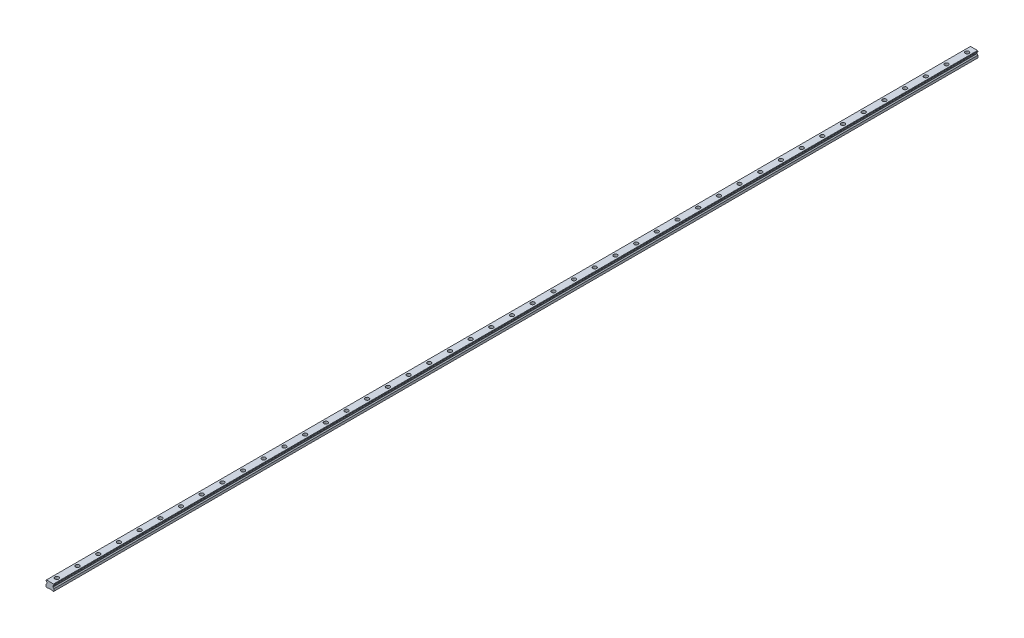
ISO-10303-21;
HEADER;
FILE_DESCRIPTION(('STEP AP214'),'2;1');
FILE_NAME('part.step','',(''),(''),'','','');
FILE_SCHEMA(('AUTOMOTIVE_DESIGN { 1 0 10303 214 1 1 1 1 }'));
ENDSEC;
DATA;
#1=APPLICATION_CONTEXT('core data for automotive mechanical design processes');
#2=APPLICATION_PROTOCOL_DEFINITION('international standard','automotive_design',2000,#1);
#3=PRODUCT_CONTEXT('',#1,'mechanical');
#4=PRODUCT('Part','Part','',(#3));
#5=PRODUCT_RELATED_PRODUCT_CATEGORY('part','',(#4));
#6=PRODUCT_DEFINITION_FORMATION('','',#4);
#7=PRODUCT_DEFINITION_CONTEXT('part definition',#1,'design');
#8=PRODUCT_DEFINITION('design','',#6,#7);
#9=PRODUCT_DEFINITION_SHAPE('','',#8);
#10=(LENGTH_UNIT() NAMED_UNIT(*) SI_UNIT(.MILLI.,.METRE.));
#11=(NAMED_UNIT(*) PLANE_ANGLE_UNIT() SI_UNIT($,.RADIAN.));
#12=(NAMED_UNIT(*) SI_UNIT($,.STERADIAN.) SOLID_ANGLE_UNIT());
#13=UNCERTAINTY_MEASURE_WITH_UNIT(LENGTH_MEASURE(1.E-05),#10,'distance_accuracy_value','');
#14=(GEOMETRIC_REPRESENTATION_CONTEXT(3) GLOBAL_UNCERTAINTY_ASSIGNED_CONTEXT((#13)) GLOBAL_UNIT_ASSIGNED_CONTEXT((#10,
#11,#12)) REPRESENTATION_CONTEXT('',''));
#15=CARTESIAN_POINT('',(0.,0.,0.));
#16=DIRECTION('',(0.,0.,1.));
#17=DIRECTION('',(1.,0.,0.));
#18=AXIS2_PLACEMENT_3D('',#15,#16,#17);
#19=CARTESIAN_POINT('',(0.,10.2,-1320.));
#20=DIRECTION('',(0.,1.,0.));
#21=DIRECTION('',(0.,0.,1.));
#22=AXIS2_PLACEMENT_3D('',#19,#20,#21);
#23=PLANE('',#22);
#24=CARTESIAN_POINT('',(0.,10.2,-1320.));
#25=DIRECTION('',(0.,1.,0.));
#26=DIRECTION('',(0.,0.,1.));
#27=AXIS2_PLACEMENT_3D('',#24,#25,#26);
#28=CIRCLE('',#27,3.49999999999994);
#29=CARTESIAN_POINT('',(0.,10.2,-1316.5));
#30=VERTEX_POINT('',#29);
#31=EDGE_CURVE('E702',#30,#30,#28,.T.);
#32=ORIENTED_EDGE('',*,*,#31,.F.);
#33=EDGE_LOOP('',(#32));
#34=FACE_BOUND('',#33,.T.);
#35=CARTESIAN_POINT('',(0.,10.2,-1320.));
#36=DIRECTION('',(0.,1.,0.));
#37=DIRECTION('',(0.,0.,1.));
#38=AXIS2_PLACEMENT_3D('',#35,#36,#37);
#39=CIRCLE('',#38,5.49999999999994);
#40=CARTESIAN_POINT('',(0.,10.2,-1314.5));
#41=VERTEX_POINT('',#40);
#42=EDGE_CURVE('E11',#41,#41,#39,.T.);
#43=ORIENTED_EDGE('',*,*,#42,.T.);
#44=EDGE_LOOP('',(#43));
#45=FACE_BOUND('',#44,.T.);
#46=ADVANCED_FACE('F39',(#34,#45),#23,.T.);
#47=CARTESIAN_POINT('',(0.,10.2,-1320.));
#48=DIRECTION('',(0.,1.,0.));
#49=DIRECTION('',(0.,0.,1.));
#50=AXIS2_PLACEMENT_3D('',#47,#48,#49);
#51=CYLINDRICAL_SURFACE('',#50,5.49999999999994);
#52=ORIENTED_EDGE('',*,*,#42,.F.);
#53=EDGE_LOOP('',(#52));
#54=FACE_BOUND('',#53,.T.);
#55=CARTESIAN_POINT('',(0.,19.2,-1320.));
#56=DIRECTION('',(0.,1.,0.));
#57=DIRECTION('',(0.,0.,1.));
#58=AXIS2_PLACEMENT_3D('',#55,#56,#57);
#59=CIRCLE('',#58,5.49999999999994);
#60=CARTESIAN_POINT('',(0.,19.2,-1314.5));
#61=VERTEX_POINT('',#60);
#62=EDGE_CURVE('E48',#61,#61,#59,.T.);
#63=ORIENTED_EDGE('',*,*,#62,.T.);
#64=EDGE_LOOP('',(#63));
#65=FACE_BOUND('',#64,.T.);
#66=ADVANCED_FACE('F1245',(#54,#65),#51,.F.);
#67=CARTESIAN_POINT('',(0.,10.2,-1260.));
#68=DIRECTION('',(0.,1.,0.));
#69=DIRECTION('',(0.,0.,1.));
#70=AXIS2_PLACEMENT_3D('',#67,#68,#69);
#71=PLANE('',#70);
#72=CARTESIAN_POINT('',(0.,10.2,-1260.));
#73=DIRECTION('',(0.,1.,0.));
#74=DIRECTION('',(0.,0.,1.));
#75=AXIS2_PLACEMENT_3D('',#72,#73,#74);
#76=CIRCLE('',#75,3.49999999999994);
#77=CARTESIAN_POINT('',(0.,10.2,-1256.5));
#78=VERTEX_POINT('',#77);
#79=EDGE_CURVE('E707',#78,#78,#76,.T.);
#80=ORIENTED_EDGE('',*,*,#79,.F.);
#81=EDGE_LOOP('',(#80));
#82=FACE_BOUND('',#81,.T.);
#83=CARTESIAN_POINT('',(0.,10.2,-1260.));
#84=DIRECTION('',(0.,1.,0.));
#85=DIRECTION('',(0.,0.,1.));
#86=AXIS2_PLACEMENT_3D('',#83,#84,#85);
#87=CIRCLE('',#86,5.49999999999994);
#88=CARTESIAN_POINT('',(0.,10.2,-1254.5));
#89=VERTEX_POINT('',#88);
#90=EDGE_CURVE('E686',#89,#89,#87,.T.);
#91=ORIENTED_EDGE('',*,*,#90,.T.);
#92=EDGE_LOOP('',(#91));
#93=FACE_BOUND('',#92,.T.);
#94=ADVANCED_FACE('F1247',(#82,#93),#71,.T.);
#95=CARTESIAN_POINT('',(0.,10.2,-1260.));
#96=DIRECTION('',(0.,1.,0.));
#97=DIRECTION('',(0.,0.,1.));
#98=AXIS2_PLACEMENT_3D('',#95,#96,#97);
#99=CYLINDRICAL_SURFACE('',#98,5.49999999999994);
#100=ORIENTED_EDGE('',*,*,#90,.F.);
#101=EDGE_LOOP('',(#100));
#102=FACE_BOUND('',#101,.T.);
#103=CARTESIAN_POINT('',(0.,19.2,-1260.));
#104=DIRECTION('',(0.,1.,0.));
#105=DIRECTION('',(0.,0.,1.));
#106=AXIS2_PLACEMENT_3D('',#103,#104,#105);
#107=CIRCLE('',#106,5.49999999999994);
#108=CARTESIAN_POINT('',(0.,19.2,-1254.5));
#109=VERTEX_POINT('',#108);
#110=EDGE_CURVE('E682',#109,#109,#107,.T.);
#111=ORIENTED_EDGE('',*,*,#110,.T.);
#112=EDGE_LOOP('',(#111));
#113=FACE_BOUND('',#112,.T.);
#114=ADVANCED_FACE('F1253',(#102,#113),#99,.F.);
#115=CARTESIAN_POINT('',(0.,10.2,-1200.));
#116=DIRECTION('',(0.,1.,0.));
#117=DIRECTION('',(0.,0.,1.));
#118=AXIS2_PLACEMENT_3D('',#115,#116,#117);
#119=PLANE('',#118);
#120=CARTESIAN_POINT('',(0.,10.2,-1200.));
#121=DIRECTION('',(0.,1.,0.));
#122=DIRECTION('',(0.,0.,1.));
#123=AXIS2_PLACEMENT_3D('',#120,#121,#122);
#124=CIRCLE('',#123,3.49999999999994);
#125=CARTESIAN_POINT('',(0.,10.2,-1196.5));
#126=VERTEX_POINT('',#125);
#127=EDGE_CURVE('E712',#126,#126,#124,.T.);
#128=ORIENTED_EDGE('',*,*,#127,.F.);
#129=EDGE_LOOP('',(#128));
#130=FACE_BOUND('',#129,.T.);
#131=CARTESIAN_POINT('',(0.,10.2,-1200.));
#132=DIRECTION('',(0.,1.,0.));
#133=DIRECTION('',(0.,0.,1.));
#134=AXIS2_PLACEMENT_3D('',#131,#132,#133);
#135=CIRCLE('',#134,5.49999999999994);
#136=CARTESIAN_POINT('',(0.,10.2,-1194.5));
#137=VERTEX_POINT('',#136);
#138=EDGE_CURVE('E678',#137,#137,#135,.T.);
#139=ORIENTED_EDGE('',*,*,#138,.T.);
#140=EDGE_LOOP('',(#139));
#141=FACE_BOUND('',#140,.T.);
#142=ADVANCED_FACE('F1261',(#130,#141),#119,.T.);
#143=CARTESIAN_POINT('',(0.,10.2,-1200.));
#144=DIRECTION('',(0.,1.,0.));
#145=DIRECTION('',(0.,0.,1.));
#146=AXIS2_PLACEMENT_3D('',#143,#144,#145);
#147=CYLINDRICAL_SURFACE('',#146,5.49999999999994);
#148=ORIENTED_EDGE('',*,*,#138,.F.);
#149=EDGE_LOOP('',(#148));
#150=FACE_BOUND('',#149,.T.);
#151=CARTESIAN_POINT('',(0.,19.2,-1200.));
#152=DIRECTION('',(0.,1.,0.));
#153=DIRECTION('',(0.,0.,1.));
#154=AXIS2_PLACEMENT_3D('',#151,#152,#153);
#155=CIRCLE('',#154,5.49999999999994);
#156=CARTESIAN_POINT('',(0.,19.2,-1194.5));
#157=VERTEX_POINT('',#156);
#158=EDGE_CURVE('E674',#157,#157,#155,.T.);
#159=ORIENTED_EDGE('',*,*,#158,.T.);
#160=EDGE_LOOP('',(#159));
#161=FACE_BOUND('',#160,.T.);
#162=ADVANCED_FACE('F1265',(#150,#161),#147,.F.);
#163=CARTESIAN_POINT('',(0.,10.2,-1140.));
#164=DIRECTION('',(0.,1.,0.));
#165=DIRECTION('',(0.,0.,1.));
#166=AXIS2_PLACEMENT_3D('',#163,#164,#165);
#167=PLANE('',#166);
#168=CARTESIAN_POINT('',(0.,10.2,-1140.));
#169=DIRECTION('',(0.,1.,0.));
#170=DIRECTION('',(0.,0.,1.));
#171=AXIS2_PLACEMENT_3D('',#168,#169,#170);
#172=CIRCLE('',#171,3.49999999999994);
#173=CARTESIAN_POINT('',(0.,10.2,-1136.5));
#174=VERTEX_POINT('',#173);
#175=EDGE_CURVE('E717',#174,#174,#172,.T.);
#176=ORIENTED_EDGE('',*,*,#175,.F.);
#177=EDGE_LOOP('',(#176));
#178=FACE_BOUND('',#177,.T.);
#179=CARTESIAN_POINT('',(0.,10.2,-1140.));
#180=DIRECTION('',(0.,1.,0.));
#181=DIRECTION('',(0.,0.,1.));
#182=AXIS2_PLACEMENT_3D('',#179,#180,#181);
#183=CIRCLE('',#182,5.49999999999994);
#184=CARTESIAN_POINT('',(0.,10.2,-1134.5));
#185=VERTEX_POINT('',#184);
#186=EDGE_CURVE('E670',#185,#185,#183,.T.);
#187=ORIENTED_EDGE('',*,*,#186,.T.);
#188=EDGE_LOOP('',(#187));
#189=FACE_BOUND('',#188,.T.);
#190=ADVANCED_FACE('F1269',(#178,#189),#167,.T.);
#191=CARTESIAN_POINT('',(0.,10.2,-1140.));
#192=DIRECTION('',(0.,1.,0.));
#193=DIRECTION('',(0.,0.,1.));
#194=AXIS2_PLACEMENT_3D('',#191,#192,#193);
#195=CYLINDRICAL_SURFACE('',#194,5.49999999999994);
#196=ORIENTED_EDGE('',*,*,#186,.F.);
#197=EDGE_LOOP('',(#196));
#198=FACE_BOUND('',#197,.T.);
#199=CARTESIAN_POINT('',(0.,19.2,-1140.));
#200=DIRECTION('',(0.,1.,0.));
#201=DIRECTION('',(0.,0.,1.));
#202=AXIS2_PLACEMENT_3D('',#199,#200,#201);
#203=CIRCLE('',#202,5.49999999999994);
#204=CARTESIAN_POINT('',(0.,19.2,-1134.5));
#205=VERTEX_POINT('',#204);
#206=EDGE_CURVE('E666',#205,#205,#203,.T.);
#207=ORIENTED_EDGE('',*,*,#206,.T.);
#208=EDGE_LOOP('',(#207));
#209=FACE_BOUND('',#208,.T.);
#210=ADVANCED_FACE('F1273',(#198,#209),#195,.F.);
#211=CARTESIAN_POINT('',(0.,10.2,-1080.));
#212=DIRECTION('',(0.,1.,0.));
#213=DIRECTION('',(0.,0.,1.));
#214=AXIS2_PLACEMENT_3D('',#211,#212,#213);
#215=PLANE('',#214);
#216=CARTESIAN_POINT('',(0.,10.2,-1080.));
#217=DIRECTION('',(0.,1.,0.));
#218=DIRECTION('',(0.,0.,1.));
#219=AXIS2_PLACEMENT_3D('',#216,#217,#218);
#220=CIRCLE('',#219,3.49999999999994);
#221=CARTESIAN_POINT('',(0.,10.2,-1076.5));
#222=VERTEX_POINT('',#221);
#223=EDGE_CURVE('E722',#222,#222,#220,.T.);
#224=ORIENTED_EDGE('',*,*,#223,.F.);
#225=EDGE_LOOP('',(#224));
#226=FACE_BOUND('',#225,.T.);
#227=CARTESIAN_POINT('',(0.,10.2,-1080.));
#228=DIRECTION('',(0.,1.,0.));
#229=DIRECTION('',(0.,0.,1.));
#230=AXIS2_PLACEMENT_3D('',#227,#228,#229);
#231=CIRCLE('',#230,5.49999999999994);
#232=CARTESIAN_POINT('',(0.,10.2,-1074.5));
#233=VERTEX_POINT('',#232);
#234=EDGE_CURVE('E662',#233,#233,#231,.T.);
#235=ORIENTED_EDGE('',*,*,#234,.T.);
#236=EDGE_LOOP('',(#235));
#237=FACE_BOUND('',#236,.T.);
#238=ADVANCED_FACE('F1277',(#226,#237),#215,.T.);
#239=CARTESIAN_POINT('',(0.,10.2,-1080.));
#240=DIRECTION('',(0.,1.,0.));
#241=DIRECTION('',(0.,0.,1.));
#242=AXIS2_PLACEMENT_3D('',#239,#240,#241);
#243=CYLINDRICAL_SURFACE('',#242,5.49999999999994);
#244=ORIENTED_EDGE('',*,*,#234,.F.);
#245=EDGE_LOOP('',(#244));
#246=FACE_BOUND('',#245,.T.);
#247=CARTESIAN_POINT('',(0.,19.2,-1080.));
#248=DIRECTION('',(0.,1.,0.));
#249=DIRECTION('',(0.,0.,1.));
#250=AXIS2_PLACEMENT_3D('',#247,#248,#249);
#251=CIRCLE('',#250,5.49999999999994);
#252=CARTESIAN_POINT('',(0.,19.2,-1074.5));
#253=VERTEX_POINT('',#252);
#254=EDGE_CURVE('E658',#253,#253,#251,.T.);
#255=ORIENTED_EDGE('',*,*,#254,.T.);
#256=EDGE_LOOP('',(#255));
#257=FACE_BOUND('',#256,.T.);
#258=ADVANCED_FACE('F1281',(#246,#257),#243,.F.);
#259=CARTESIAN_POINT('',(0.,10.2,-1020.));
#260=DIRECTION('',(0.,1.,0.));
#261=DIRECTION('',(0.,0.,1.));
#262=AXIS2_PLACEMENT_3D('',#259,#260,#261);
#263=PLANE('',#262);
#264=CARTESIAN_POINT('',(0.,10.2,-1020.));
#265=DIRECTION('',(0.,1.,0.));
#266=DIRECTION('',(0.,0.,1.));
#267=AXIS2_PLACEMENT_3D('',#264,#265,#266);
#268=CIRCLE('',#267,3.49999999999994);
#269=CARTESIAN_POINT('',(0.,10.2,-1016.5));
#270=VERTEX_POINT('',#269);
#271=EDGE_CURVE('E727',#270,#270,#268,.T.);
#272=ORIENTED_EDGE('',*,*,#271,.F.);
#273=EDGE_LOOP('',(#272));
#274=FACE_BOUND('',#273,.T.);
#275=CARTESIAN_POINT('',(0.,10.2,-1020.));
#276=DIRECTION('',(0.,1.,0.));
#277=DIRECTION('',(0.,0.,1.));
#278=AXIS2_PLACEMENT_3D('',#275,#276,#277);
#279=CIRCLE('',#278,5.49999999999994);
#280=CARTESIAN_POINT('',(0.,10.2,-1014.5));
#281=VERTEX_POINT('',#280);
#282=EDGE_CURVE('E654',#281,#281,#279,.T.);
#283=ORIENTED_EDGE('',*,*,#282,.T.);
#284=EDGE_LOOP('',(#283));
#285=FACE_BOUND('',#284,.T.);
#286=ADVANCED_FACE('F1285',(#274,#285),#263,.T.);
#287=CARTESIAN_POINT('',(0.,10.2,-1020.));
#288=DIRECTION('',(0.,1.,0.));
#289=DIRECTION('',(0.,0.,1.));
#290=AXIS2_PLACEMENT_3D('',#287,#288,#289);
#291=CYLINDRICAL_SURFACE('',#290,5.49999999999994);
#292=ORIENTED_EDGE('',*,*,#282,.F.);
#293=EDGE_LOOP('',(#292));
#294=FACE_BOUND('',#293,.T.);
#295=CARTESIAN_POINT('',(0.,19.2,-1020.));
#296=DIRECTION('',(0.,1.,0.));
#297=DIRECTION('',(0.,0.,1.));
#298=AXIS2_PLACEMENT_3D('',#295,#296,#297);
#299=CIRCLE('',#298,5.49999999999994);
#300=CARTESIAN_POINT('',(0.,19.2,-1014.5));
#301=VERTEX_POINT('',#300);
#302=EDGE_CURVE('E650',#301,#301,#299,.T.);
#303=ORIENTED_EDGE('',*,*,#302,.T.);
#304=EDGE_LOOP('',(#303));
#305=FACE_BOUND('',#304,.T.);
#306=ADVANCED_FACE('F1289',(#294,#305),#291,.F.);
#307=CARTESIAN_POINT('',(0.,10.2,-960.));
#308=DIRECTION('',(0.,1.,0.));
#309=DIRECTION('',(0.,0.,1.));
#310=AXIS2_PLACEMENT_3D('',#307,#308,#309);
#311=PLANE('',#310);
#312=CARTESIAN_POINT('',(0.,10.2,-960.));
#313=DIRECTION('',(0.,1.,0.));
#314=DIRECTION('',(0.,0.,1.));
#315=AXIS2_PLACEMENT_3D('',#312,#313,#314);
#316=CIRCLE('',#315,3.49999999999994);
#317=CARTESIAN_POINT('',(0.,10.2,-956.5));
#318=VERTEX_POINT('',#317);
#319=EDGE_CURVE('E732',#318,#318,#316,.T.);
#320=ORIENTED_EDGE('',*,*,#319,.F.);
#321=EDGE_LOOP('',(#320));
#322=FACE_BOUND('',#321,.T.);
#323=CARTESIAN_POINT('',(0.,10.2,-960.));
#324=DIRECTION('',(0.,1.,0.));
#325=DIRECTION('',(0.,0.,1.));
#326=AXIS2_PLACEMENT_3D('',#323,#324,#325);
#327=CIRCLE('',#326,5.49999999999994);
#328=CARTESIAN_POINT('',(0.,10.2,-954.5));
#329=VERTEX_POINT('',#328);
#330=EDGE_CURVE('E646',#329,#329,#327,.T.);
#331=ORIENTED_EDGE('',*,*,#330,.T.);
#332=EDGE_LOOP('',(#331));
#333=FACE_BOUND('',#332,.T.);
#334=ADVANCED_FACE('F1293',(#322,#333),#311,.T.);
#335=CARTESIAN_POINT('',(0.,10.2,-960.));
#336=DIRECTION('',(0.,1.,0.));
#337=DIRECTION('',(0.,0.,1.));
#338=AXIS2_PLACEMENT_3D('',#335,#336,#337);
#339=CYLINDRICAL_SURFACE('',#338,5.49999999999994);
#340=ORIENTED_EDGE('',*,*,#330,.F.);
#341=EDGE_LOOP('',(#340));
#342=FACE_BOUND('',#341,.T.);
#343=CARTESIAN_POINT('',(0.,19.2,-960.));
#344=DIRECTION('',(0.,1.,0.));
#345=DIRECTION('',(0.,0.,1.));
#346=AXIS2_PLACEMENT_3D('',#343,#344,#345);
#347=CIRCLE('',#346,5.49999999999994);
#348=CARTESIAN_POINT('',(0.,19.2,-954.5));
#349=VERTEX_POINT('',#348);
#350=EDGE_CURVE('E642',#349,#349,#347,.T.);
#351=ORIENTED_EDGE('',*,*,#350,.T.);
#352=EDGE_LOOP('',(#351));
#353=FACE_BOUND('',#352,.T.);
#354=ADVANCED_FACE('F1297',(#342,#353),#339,.F.);
#355=CARTESIAN_POINT('',(0.,10.2,-900.));
#356=DIRECTION('',(0.,1.,0.));
#357=DIRECTION('',(0.,0.,1.));
#358=AXIS2_PLACEMENT_3D('',#355,#356,#357);
#359=PLANE('',#358);
#360=CARTESIAN_POINT('',(0.,10.2,-900.));
#361=DIRECTION('',(0.,1.,0.));
#362=DIRECTION('',(0.,0.,1.));
#363=AXIS2_PLACEMENT_3D('',#360,#361,#362);
#364=CIRCLE('',#363,3.49999999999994);
#365=CARTESIAN_POINT('',(0.,10.2,-896.5));
#366=VERTEX_POINT('',#365);
#367=EDGE_CURVE('E737',#366,#366,#364,.T.);
#368=ORIENTED_EDGE('',*,*,#367,.F.);
#369=EDGE_LOOP('',(#368));
#370=FACE_BOUND('',#369,.T.);
#371=CARTESIAN_POINT('',(0.,10.2,-900.));
#372=DIRECTION('',(0.,1.,0.));
#373=DIRECTION('',(0.,0.,1.));
#374=AXIS2_PLACEMENT_3D('',#371,#372,#373);
#375=CIRCLE('',#374,5.49999999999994);
#376=CARTESIAN_POINT('',(0.,10.2,-894.5));
#377=VERTEX_POINT('',#376);
#378=EDGE_CURVE('E638',#377,#377,#375,.T.);
#379=ORIENTED_EDGE('',*,*,#378,.T.);
#380=EDGE_LOOP('',(#379));
#381=FACE_BOUND('',#380,.T.);
#382=ADVANCED_FACE('F1301',(#370,#381),#359,.T.);
#383=CARTESIAN_POINT('',(0.,10.2,-900.));
#384=DIRECTION('',(0.,1.,0.));
#385=DIRECTION('',(0.,0.,1.));
#386=AXIS2_PLACEMENT_3D('',#383,#384,#385);
#387=CYLINDRICAL_SURFACE('',#386,5.49999999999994);
#388=ORIENTED_EDGE('',*,*,#378,.F.);
#389=EDGE_LOOP('',(#388));
#390=FACE_BOUND('',#389,.T.);
#391=CARTESIAN_POINT('',(0.,19.2,-900.));
#392=DIRECTION('',(0.,1.,0.));
#393=DIRECTION('',(0.,0.,1.));
#394=AXIS2_PLACEMENT_3D('',#391,#392,#393);
#395=CIRCLE('',#394,5.49999999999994);
#396=CARTESIAN_POINT('',(0.,19.2,-894.5));
#397=VERTEX_POINT('',#396);
#398=EDGE_CURVE('E634',#397,#397,#395,.T.);
#399=ORIENTED_EDGE('',*,*,#398,.T.);
#400=EDGE_LOOP('',(#399));
#401=FACE_BOUND('',#400,.T.);
#402=ADVANCED_FACE('F1305',(#390,#401),#387,.F.);
#403=CARTESIAN_POINT('',(0.,10.2,-840.));
#404=DIRECTION('',(0.,1.,0.));
#405=DIRECTION('',(0.,0.,1.));
#406=AXIS2_PLACEMENT_3D('',#403,#404,#405);
#407=PLANE('',#406);
#408=CARTESIAN_POINT('',(0.,10.2,-840.));
#409=DIRECTION('',(0.,1.,0.));
#410=DIRECTION('',(0.,0.,1.));
#411=AXIS2_PLACEMENT_3D('',#408,#409,#410);
#412=CIRCLE('',#411,3.49999999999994);
#413=CARTESIAN_POINT('',(0.,10.2,-836.5));
#414=VERTEX_POINT('',#413);
#415=EDGE_CURVE('E742',#414,#414,#412,.T.);
#416=ORIENTED_EDGE('',*,*,#415,.F.);
#417=EDGE_LOOP('',(#416));
#418=FACE_BOUND('',#417,.T.);
#419=CARTESIAN_POINT('',(0.,10.2,-840.));
#420=DIRECTION('',(0.,1.,0.));
#421=DIRECTION('',(0.,0.,1.));
#422=AXIS2_PLACEMENT_3D('',#419,#420,#421);
#423=CIRCLE('',#422,5.49999999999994);
#424=CARTESIAN_POINT('',(0.,10.2,-834.5));
#425=VERTEX_POINT('',#424);
#426=EDGE_CURVE('E630',#425,#425,#423,.T.);
#427=ORIENTED_EDGE('',*,*,#426,.T.);
#428=EDGE_LOOP('',(#427));
#429=FACE_BOUND('',#428,.T.);
#430=ADVANCED_FACE('F1309',(#418,#429),#407,.T.);
#431=CARTESIAN_POINT('',(0.,10.2,-840.));
#432=DIRECTION('',(0.,1.,0.));
#433=DIRECTION('',(0.,0.,1.));
#434=AXIS2_PLACEMENT_3D('',#431,#432,#433);
#435=CYLINDRICAL_SURFACE('',#434,5.49999999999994);
#436=ORIENTED_EDGE('',*,*,#426,.F.);
#437=EDGE_LOOP('',(#436));
#438=FACE_BOUND('',#437,.T.);
#439=CARTESIAN_POINT('',(0.,19.2,-840.));
#440=DIRECTION('',(0.,1.,0.));
#441=DIRECTION('',(0.,0.,1.));
#442=AXIS2_PLACEMENT_3D('',#439,#440,#441);
#443=CIRCLE('',#442,5.49999999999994);
#444=CARTESIAN_POINT('',(0.,19.2,-834.5));
#445=VERTEX_POINT('',#444);
#446=EDGE_CURVE('E626',#445,#445,#443,.T.);
#447=ORIENTED_EDGE('',*,*,#446,.T.);
#448=EDGE_LOOP('',(#447));
#449=FACE_BOUND('',#448,.T.);
#450=ADVANCED_FACE('F1313',(#438,#449),#435,.F.);
#451=CARTESIAN_POINT('',(0.,10.2,-780.));
#452=DIRECTION('',(0.,1.,0.));
#453=DIRECTION('',(0.,0.,1.));
#454=AXIS2_PLACEMENT_3D('',#451,#452,#453);
#455=PLANE('',#454);
#456=CARTESIAN_POINT('',(0.,10.2,-780.));
#457=DIRECTION('',(0.,1.,0.));
#458=DIRECTION('',(0.,0.,1.));
#459=AXIS2_PLACEMENT_3D('',#456,#457,#458);
#460=CIRCLE('',#459,3.49999999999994);
#461=CARTESIAN_POINT('',(0.,10.2,-776.5));
#462=VERTEX_POINT('',#461);
#463=EDGE_CURVE('E747',#462,#462,#460,.T.);
#464=ORIENTED_EDGE('',*,*,#463,.F.);
#465=EDGE_LOOP('',(#464));
#466=FACE_BOUND('',#465,.T.);
#467=CARTESIAN_POINT('',(0.,10.2,-780.));
#468=DIRECTION('',(0.,1.,0.));
#469=DIRECTION('',(0.,0.,1.));
#470=AXIS2_PLACEMENT_3D('',#467,#468,#469);
#471=CIRCLE('',#470,5.49999999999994);
#472=CARTESIAN_POINT('',(0.,10.2,-774.5));
#473=VERTEX_POINT('',#472);
#474=EDGE_CURVE('E622',#473,#473,#471,.T.);
#475=ORIENTED_EDGE('',*,*,#474,.T.);
#476=EDGE_LOOP('',(#475));
#477=FACE_BOUND('',#476,.T.);
#478=ADVANCED_FACE('F1317',(#466,#477),#455,.T.);
#479=CARTESIAN_POINT('',(0.,10.2,-780.));
#480=DIRECTION('',(0.,1.,0.));
#481=DIRECTION('',(0.,0.,1.));
#482=AXIS2_PLACEMENT_3D('',#479,#480,#481);
#483=CYLINDRICAL_SURFACE('',#482,5.49999999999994);
#484=ORIENTED_EDGE('',*,*,#474,.F.);
#485=EDGE_LOOP('',(#484));
#486=FACE_BOUND('',#485,.T.);
#487=CARTESIAN_POINT('',(0.,19.2,-780.));
#488=DIRECTION('',(0.,1.,0.));
#489=DIRECTION('',(0.,0.,1.));
#490=AXIS2_PLACEMENT_3D('',#487,#488,#489);
#491=CIRCLE('',#490,5.49999999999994);
#492=CARTESIAN_POINT('',(0.,19.2,-774.5));
#493=VERTEX_POINT('',#492);
#494=EDGE_CURVE('E618',#493,#493,#491,.T.);
#495=ORIENTED_EDGE('',*,*,#494,.T.);
#496=EDGE_LOOP('',(#495));
#497=FACE_BOUND('',#496,.T.);
#498=ADVANCED_FACE('F1321',(#486,#497),#483,.F.);
#499=CARTESIAN_POINT('',(0.,10.2,-720.));
#500=DIRECTION('',(0.,1.,0.));
#501=DIRECTION('',(0.,0.,1.));
#502=AXIS2_PLACEMENT_3D('',#499,#500,#501);
#503=PLANE('',#502);
#504=CARTESIAN_POINT('',(0.,10.2,-720.));
#505=DIRECTION('',(0.,1.,0.));
#506=DIRECTION('',(0.,0.,1.));
#507=AXIS2_PLACEMENT_3D('',#504,#505,#506);
#508=CIRCLE('',#507,3.49999999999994);
#509=CARTESIAN_POINT('',(0.,10.2,-716.5));
#510=VERTEX_POINT('',#509);
#511=EDGE_CURVE('E752',#510,#510,#508,.T.);
#512=ORIENTED_EDGE('',*,*,#511,.F.);
#513=EDGE_LOOP('',(#512));
#514=FACE_BOUND('',#513,.T.);
#515=CARTESIAN_POINT('',(0.,10.2,-720.));
#516=DIRECTION('',(0.,1.,0.));
#517=DIRECTION('',(0.,0.,1.));
#518=AXIS2_PLACEMENT_3D('',#515,#516,#517);
#519=CIRCLE('',#518,5.49999999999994);
#520=CARTESIAN_POINT('',(0.,10.2,-714.5));
#521=VERTEX_POINT('',#520);
#522=EDGE_CURVE('E614',#521,#521,#519,.T.);
#523=ORIENTED_EDGE('',*,*,#522,.T.);
#524=EDGE_LOOP('',(#523));
#525=FACE_BOUND('',#524,.T.);
#526=ADVANCED_FACE('F1325',(#514,#525),#503,.T.);
#527=CARTESIAN_POINT('',(0.,10.2,-720.));
#528=DIRECTION('',(0.,1.,0.));
#529=DIRECTION('',(0.,0.,1.));
#530=AXIS2_PLACEMENT_3D('',#527,#528,#529);
#531=CYLINDRICAL_SURFACE('',#530,5.49999999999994);
#532=ORIENTED_EDGE('',*,*,#522,.F.);
#533=EDGE_LOOP('',(#532));
#534=FACE_BOUND('',#533,.T.);
#535=CARTESIAN_POINT('',(0.,19.2,-720.));
#536=DIRECTION('',(0.,1.,0.));
#537=DIRECTION('',(0.,0.,1.));
#538=AXIS2_PLACEMENT_3D('',#535,#536,#537);
#539=CIRCLE('',#538,5.49999999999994);
#540=CARTESIAN_POINT('',(0.,19.2,-714.5));
#541=VERTEX_POINT('',#540);
#542=EDGE_CURVE('E610',#541,#541,#539,.T.);
#543=ORIENTED_EDGE('',*,*,#542,.T.);
#544=EDGE_LOOP('',(#543));
#545=FACE_BOUND('',#544,.T.);
#546=ADVANCED_FACE('F1329',(#534,#545),#531,.F.);
#547=CARTESIAN_POINT('',(0.,10.2,-660.));
#548=DIRECTION('',(0.,1.,0.));
#549=DIRECTION('',(0.,0.,1.));
#550=AXIS2_PLACEMENT_3D('',#547,#548,#549);
#551=PLANE('',#550);
#552=CARTESIAN_POINT('',(0.,10.2,-660.));
#553=DIRECTION('',(0.,1.,0.));
#554=DIRECTION('',(0.,0.,1.));
#555=AXIS2_PLACEMENT_3D('',#552,#553,#554);
#556=CIRCLE('',#555,3.49999999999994);
#557=CARTESIAN_POINT('',(0.,10.2,-656.5));
#558=VERTEX_POINT('',#557);
#559=EDGE_CURVE('E757',#558,#558,#556,.T.);
#560=ORIENTED_EDGE('',*,*,#559,.F.);
#561=EDGE_LOOP('',(#560));
#562=FACE_BOUND('',#561,.T.);
#563=CARTESIAN_POINT('',(0.,10.2,-660.));
#564=DIRECTION('',(0.,1.,0.));
#565=DIRECTION('',(0.,0.,1.));
#566=AXIS2_PLACEMENT_3D('',#563,#564,#565);
#567=CIRCLE('',#566,5.49999999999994);
#568=CARTESIAN_POINT('',(0.,10.2,-654.5));
#569=VERTEX_POINT('',#568);
#570=EDGE_CURVE('E606',#569,#569,#567,.T.);
#571=ORIENTED_EDGE('',*,*,#570,.T.);
#572=EDGE_LOOP('',(#571));
#573=FACE_BOUND('',#572,.T.);
#574=ADVANCED_FACE('F1333',(#562,#573),#551,.T.);
#575=CARTESIAN_POINT('',(0.,10.2,-660.));
#576=DIRECTION('',(0.,1.,0.));
#577=DIRECTION('',(0.,0.,1.));
#578=AXIS2_PLACEMENT_3D('',#575,#576,#577);
#579=CYLINDRICAL_SURFACE('',#578,5.49999999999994);
#580=ORIENTED_EDGE('',*,*,#570,.F.);
#581=EDGE_LOOP('',(#580));
#582=FACE_BOUND('',#581,.T.);
#583=CARTESIAN_POINT('',(0.,19.2,-660.));
#584=DIRECTION('',(0.,1.,0.));
#585=DIRECTION('',(0.,0.,1.));
#586=AXIS2_PLACEMENT_3D('',#583,#584,#585);
#587=CIRCLE('',#586,5.49999999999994);
#588=CARTESIAN_POINT('',(0.,19.2,-654.5));
#589=VERTEX_POINT('',#588);
#590=EDGE_CURVE('E602',#589,#589,#587,.T.);
#591=ORIENTED_EDGE('',*,*,#590,.T.);
#592=EDGE_LOOP('',(#591));
#593=FACE_BOUND('',#592,.T.);
#594=ADVANCED_FACE('F1337',(#582,#593),#579,.F.);
#595=CARTESIAN_POINT('',(0.,10.2,-600.));
#596=DIRECTION('',(0.,1.,0.));
#597=DIRECTION('',(0.,0.,1.));
#598=AXIS2_PLACEMENT_3D('',#595,#596,#597);
#599=PLANE('',#598);
#600=CARTESIAN_POINT('',(0.,10.2,-600.));
#601=DIRECTION('',(0.,1.,0.));
#602=DIRECTION('',(0.,0.,1.));
#603=AXIS2_PLACEMENT_3D('',#600,#601,#602);
#604=CIRCLE('',#603,3.49999999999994);
#605=CARTESIAN_POINT('',(0.,10.2,-596.5));
#606=VERTEX_POINT('',#605);
#607=EDGE_CURVE('E762',#606,#606,#604,.T.);
#608=ORIENTED_EDGE('',*,*,#607,.F.);
#609=EDGE_LOOP('',(#608));
#610=FACE_BOUND('',#609,.T.);
#611=CARTESIAN_POINT('',(0.,10.2,-600.));
#612=DIRECTION('',(0.,1.,0.));
#613=DIRECTION('',(0.,0.,1.));
#614=AXIS2_PLACEMENT_3D('',#611,#612,#613);
#615=CIRCLE('',#614,5.49999999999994);
#616=CARTESIAN_POINT('',(0.,10.2,-594.5));
#617=VERTEX_POINT('',#616);
#618=EDGE_CURVE('E598',#617,#617,#615,.T.);
#619=ORIENTED_EDGE('',*,*,#618,.T.);
#620=EDGE_LOOP('',(#619));
#621=FACE_BOUND('',#620,.T.);
#622=ADVANCED_FACE('F1341',(#610,#621),#599,.T.);
#623=CARTESIAN_POINT('',(0.,10.2,-600.));
#624=DIRECTION('',(0.,1.,0.));
#625=DIRECTION('',(0.,0.,1.));
#626=AXIS2_PLACEMENT_3D('',#623,#624,#625);
#627=CYLINDRICAL_SURFACE('',#626,5.49999999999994);
#628=ORIENTED_EDGE('',*,*,#618,.F.);
#629=EDGE_LOOP('',(#628));
#630=FACE_BOUND('',#629,.T.);
#631=CARTESIAN_POINT('',(0.,19.2,-600.));
#632=DIRECTION('',(0.,1.,0.));
#633=DIRECTION('',(0.,0.,1.));
#634=AXIS2_PLACEMENT_3D('',#631,#632,#633);
#635=CIRCLE('',#634,5.49999999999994);
#636=CARTESIAN_POINT('',(0.,19.2,-594.5));
#637=VERTEX_POINT('',#636);
#638=EDGE_CURVE('E594',#637,#637,#635,.T.);
#639=ORIENTED_EDGE('',*,*,#638,.T.);
#640=EDGE_LOOP('',(#639));
#641=FACE_BOUND('',#640,.T.);
#642=ADVANCED_FACE('F1345',(#630,#641),#627,.F.);
#643=CARTESIAN_POINT('',(0.,10.2,-540.));
#644=DIRECTION('',(0.,1.,0.));
#645=DIRECTION('',(0.,0.,1.));
#646=AXIS2_PLACEMENT_3D('',#643,#644,#645);
#647=PLANE('',#646);
#648=CARTESIAN_POINT('',(0.,10.2,-540.));
#649=DIRECTION('',(0.,1.,0.));
#650=DIRECTION('',(0.,0.,1.));
#651=AXIS2_PLACEMENT_3D('',#648,#649,#650);
#652=CIRCLE('',#651,3.49999999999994);
#653=CARTESIAN_POINT('',(0.,10.2,-536.5));
#654=VERTEX_POINT('',#653);
#655=EDGE_CURVE('E767',#654,#654,#652,.T.);
#656=ORIENTED_EDGE('',*,*,#655,.F.);
#657=EDGE_LOOP('',(#656));
#658=FACE_BOUND('',#657,.T.);
#659=CARTESIAN_POINT('',(0.,10.2,-540.));
#660=DIRECTION('',(0.,1.,0.));
#661=DIRECTION('',(0.,0.,1.));
#662=AXIS2_PLACEMENT_3D('',#659,#660,#661);
#663=CIRCLE('',#662,5.49999999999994);
#664=CARTESIAN_POINT('',(0.,10.2,-534.5));
#665=VERTEX_POINT('',#664);
#666=EDGE_CURVE('E590',#665,#665,#663,.T.);
#667=ORIENTED_EDGE('',*,*,#666,.T.);
#668=EDGE_LOOP('',(#667));
#669=FACE_BOUND('',#668,.T.);
#670=ADVANCED_FACE('F1349',(#658,#669),#647,.T.);
#671=CARTESIAN_POINT('',(0.,10.2,-540.));
#672=DIRECTION('',(0.,1.,0.));
#673=DIRECTION('',(0.,0.,1.));
#674=AXIS2_PLACEMENT_3D('',#671,#672,#673);
#675=CYLINDRICAL_SURFACE('',#674,5.49999999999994);
#676=ORIENTED_EDGE('',*,*,#666,.F.);
#677=EDGE_LOOP('',(#676));
#678=FACE_BOUND('',#677,.T.);
#679=CARTESIAN_POINT('',(0.,19.2,-540.));
#680=DIRECTION('',(0.,1.,0.));
#681=DIRECTION('',(0.,0.,1.));
#682=AXIS2_PLACEMENT_3D('',#679,#680,#681);
#683=CIRCLE('',#682,5.49999999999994);
#684=CARTESIAN_POINT('',(0.,19.2,-534.5));
#685=VERTEX_POINT('',#684);
#686=EDGE_CURVE('E586',#685,#685,#683,.T.);
#687=ORIENTED_EDGE('',*,*,#686,.T.);
#688=EDGE_LOOP('',(#687));
#689=FACE_BOUND('',#688,.T.);
#690=ADVANCED_FACE('F1353',(#678,#689),#675,.F.);
#691=CARTESIAN_POINT('',(0.,10.2,-480.));
#692=DIRECTION('',(0.,1.,0.));
#693=DIRECTION('',(0.,0.,1.));
#694=AXIS2_PLACEMENT_3D('',#691,#692,#693);
#695=PLANE('',#694);
#696=CARTESIAN_POINT('',(0.,10.2,-480.));
#697=DIRECTION('',(0.,1.,0.));
#698=DIRECTION('',(0.,0.,1.));
#699=AXIS2_PLACEMENT_3D('',#696,#697,#698);
#700=CIRCLE('',#699,3.49999999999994);
#701=CARTESIAN_POINT('',(0.,10.2,-476.5));
#702=VERTEX_POINT('',#701);
#703=EDGE_CURVE('E772',#702,#702,#700,.T.);
#704=ORIENTED_EDGE('',*,*,#703,.F.);
#705=EDGE_LOOP('',(#704));
#706=FACE_BOUND('',#705,.T.);
#707=CARTESIAN_POINT('',(0.,10.2,-480.));
#708=DIRECTION('',(0.,1.,0.));
#709=DIRECTION('',(0.,0.,1.));
#710=AXIS2_PLACEMENT_3D('',#707,#708,#709);
#711=CIRCLE('',#710,5.49999999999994);
#712=CARTESIAN_POINT('',(0.,10.2,-474.5));
#713=VERTEX_POINT('',#712);
#714=EDGE_CURVE('E582',#713,#713,#711,.T.);
#715=ORIENTED_EDGE('',*,*,#714,.T.);
#716=EDGE_LOOP('',(#715));
#717=FACE_BOUND('',#716,.T.);
#718=ADVANCED_FACE('F1357',(#706,#717),#695,.T.);
#719=CARTESIAN_POINT('',(0.,10.2,-480.));
#720=DIRECTION('',(0.,1.,0.));
#721=DIRECTION('',(0.,0.,1.));
#722=AXIS2_PLACEMENT_3D('',#719,#720,#721);
#723=CYLINDRICAL_SURFACE('',#722,5.49999999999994);
#724=ORIENTED_EDGE('',*,*,#714,.F.);
#725=EDGE_LOOP('',(#724));
#726=FACE_BOUND('',#725,.T.);
#727=CARTESIAN_POINT('',(0.,19.2,-480.));
#728=DIRECTION('',(0.,1.,0.));
#729=DIRECTION('',(0.,0.,1.));
#730=AXIS2_PLACEMENT_3D('',#727,#728,#729);
#731=CIRCLE('',#730,5.49999999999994);
#732=CARTESIAN_POINT('',(0.,19.2,-474.5));
#733=VERTEX_POINT('',#732);
#734=EDGE_CURVE('E578',#733,#733,#731,.T.);
#735=ORIENTED_EDGE('',*,*,#734,.T.);
#736=EDGE_LOOP('',(#735));
#737=FACE_BOUND('',#736,.T.);
#738=ADVANCED_FACE('F1361',(#726,#737),#723,.F.);
#739=CARTESIAN_POINT('',(0.,10.2,-420.));
#740=DIRECTION('',(0.,1.,0.));
#741=DIRECTION('',(0.,0.,1.));
#742=AXIS2_PLACEMENT_3D('',#739,#740,#741);
#743=PLANE('',#742);
#744=CARTESIAN_POINT('',(0.,10.2,-420.));
#745=DIRECTION('',(0.,1.,0.));
#746=DIRECTION('',(0.,0.,1.));
#747=AXIS2_PLACEMENT_3D('',#744,#745,#746);
#748=CIRCLE('',#747,3.49999999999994);
#749=CARTESIAN_POINT('',(0.,10.2,-416.5));
#750=VERTEX_POINT('',#749);
#751=EDGE_CURVE('E777',#750,#750,#748,.T.);
#752=ORIENTED_EDGE('',*,*,#751,.F.);
#753=EDGE_LOOP('',(#752));
#754=FACE_BOUND('',#753,.T.);
#755=CARTESIAN_POINT('',(0.,10.2,-420.));
#756=DIRECTION('',(0.,1.,0.));
#757=DIRECTION('',(0.,0.,1.));
#758=AXIS2_PLACEMENT_3D('',#755,#756,#757);
#759=CIRCLE('',#758,5.49999999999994);
#760=CARTESIAN_POINT('',(0.,10.2,-414.5));
#761=VERTEX_POINT('',#760);
#762=EDGE_CURVE('E574',#761,#761,#759,.T.);
#763=ORIENTED_EDGE('',*,*,#762,.T.);
#764=EDGE_LOOP('',(#763));
#765=FACE_BOUND('',#764,.T.);
#766=ADVANCED_FACE('F1365',(#754,#765),#743,.T.);
#767=CARTESIAN_POINT('',(0.,10.2,-420.));
#768=DIRECTION('',(0.,1.,0.));
#769=DIRECTION('',(0.,0.,1.));
#770=AXIS2_PLACEMENT_3D('',#767,#768,#769);
#771=CYLINDRICAL_SURFACE('',#770,5.49999999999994);
#772=ORIENTED_EDGE('',*,*,#762,.F.);
#773=EDGE_LOOP('',(#772));
#774=FACE_BOUND('',#773,.T.);
#775=CARTESIAN_POINT('',(0.,19.2,-420.));
#776=DIRECTION('',(0.,1.,0.));
#777=DIRECTION('',(0.,0.,1.));
#778=AXIS2_PLACEMENT_3D('',#775,#776,#777);
#779=CIRCLE('',#778,5.49999999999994);
#780=CARTESIAN_POINT('',(0.,19.2,-414.5));
#781=VERTEX_POINT('',#780);
#782=EDGE_CURVE('E570',#781,#781,#779,.T.);
#783=ORIENTED_EDGE('',*,*,#782,.T.);
#784=EDGE_LOOP('',(#783));
#785=FACE_BOUND('',#784,.T.);
#786=ADVANCED_FACE('F1369',(#774,#785),#771,.F.);
#787=CARTESIAN_POINT('',(0.,10.2,-360.));
#788=DIRECTION('',(0.,1.,0.));
#789=DIRECTION('',(0.,0.,1.));
#790=AXIS2_PLACEMENT_3D('',#787,#788,#789);
#791=PLANE('',#790);
#792=CARTESIAN_POINT('',(0.,10.2,-360.));
#793=DIRECTION('',(0.,1.,0.));
#794=DIRECTION('',(0.,0.,1.));
#795=AXIS2_PLACEMENT_3D('',#792,#793,#794);
#796=CIRCLE('',#795,3.49999999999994);
#797=CARTESIAN_POINT('',(0.,10.2,-356.5));
#798=VERTEX_POINT('',#797);
#799=EDGE_CURVE('E782',#798,#798,#796,.T.);
#800=ORIENTED_EDGE('',*,*,#799,.F.);
#801=EDGE_LOOP('',(#800));
#802=FACE_BOUND('',#801,.T.);
#803=CARTESIAN_POINT('',(0.,10.2,-360.));
#804=DIRECTION('',(0.,1.,0.));
#805=DIRECTION('',(0.,0.,1.));
#806=AXIS2_PLACEMENT_3D('',#803,#804,#805);
#807=CIRCLE('',#806,5.49999999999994);
#808=CARTESIAN_POINT('',(0.,10.2,-354.5));
#809=VERTEX_POINT('',#808);
#810=EDGE_CURVE('E566',#809,#809,#807,.T.);
#811=ORIENTED_EDGE('',*,*,#810,.T.);
#812=EDGE_LOOP('',(#811));
#813=FACE_BOUND('',#812,.T.);
#814=ADVANCED_FACE('F1373',(#802,#813),#791,.T.);
#815=CARTESIAN_POINT('',(0.,10.2,-360.));
#816=DIRECTION('',(0.,1.,0.));
#817=DIRECTION('',(0.,0.,1.));
#818=AXIS2_PLACEMENT_3D('',#815,#816,#817);
#819=CYLINDRICAL_SURFACE('',#818,5.49999999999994);
#820=ORIENTED_EDGE('',*,*,#810,.F.);
#821=EDGE_LOOP('',(#820));
#822=FACE_BOUND('',#821,.T.);
#823=CARTESIAN_POINT('',(0.,19.2,-360.));
#824=DIRECTION('',(0.,1.,0.));
#825=DIRECTION('',(0.,0.,1.));
#826=AXIS2_PLACEMENT_3D('',#823,#824,#825);
#827=CIRCLE('',#826,5.49999999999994);
#828=CARTESIAN_POINT('',(0.,19.2,-354.5));
#829=VERTEX_POINT('',#828);
#830=EDGE_CURVE('E562',#829,#829,#827,.T.);
#831=ORIENTED_EDGE('',*,*,#830,.T.);
#832=EDGE_LOOP('',(#831));
#833=FACE_BOUND('',#832,.T.);
#834=ADVANCED_FACE('F1377',(#822,#833),#819,.F.);
#835=CARTESIAN_POINT('',(0.,10.2,-300.));
#836=DIRECTION('',(0.,1.,0.));
#837=DIRECTION('',(0.,0.,1.));
#838=AXIS2_PLACEMENT_3D('',#835,#836,#837);
#839=PLANE('',#838);
#840=CARTESIAN_POINT('',(0.,10.2,-300.));
#841=DIRECTION('',(0.,1.,0.));
#842=DIRECTION('',(0.,0.,1.));
#843=AXIS2_PLACEMENT_3D('',#840,#841,#842);
#844=CIRCLE('',#843,3.49999999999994);
#845=CARTESIAN_POINT('',(0.,10.2,-296.5));
#846=VERTEX_POINT('',#845);
#847=EDGE_CURVE('E787',#846,#846,#844,.T.);
#848=ORIENTED_EDGE('',*,*,#847,.F.);
#849=EDGE_LOOP('',(#848));
#850=FACE_BOUND('',#849,.T.);
#851=CARTESIAN_POINT('',(0.,10.2,-300.));
#852=DIRECTION('',(0.,1.,0.));
#853=DIRECTION('',(0.,0.,1.));
#854=AXIS2_PLACEMENT_3D('',#851,#852,#853);
#855=CIRCLE('',#854,5.49999999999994);
#856=CARTESIAN_POINT('',(0.,10.2,-294.5));
#857=VERTEX_POINT('',#856);
#858=EDGE_CURVE('E558',#857,#857,#855,.T.);
#859=ORIENTED_EDGE('',*,*,#858,.T.);
#860=EDGE_LOOP('',(#859));
#861=FACE_BOUND('',#860,.T.);
#862=ADVANCED_FACE('F1381',(#850,#861),#839,.T.);
#863=CARTESIAN_POINT('',(0.,10.2,-300.));
#864=DIRECTION('',(0.,1.,0.));
#865=DIRECTION('',(0.,0.,1.));
#866=AXIS2_PLACEMENT_3D('',#863,#864,#865);
#867=CYLINDRICAL_SURFACE('',#866,5.49999999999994);
#868=ORIENTED_EDGE('',*,*,#858,.F.);
#869=EDGE_LOOP('',(#868));
#870=FACE_BOUND('',#869,.T.);
#871=CARTESIAN_POINT('',(0.,19.2,-300.));
#872=DIRECTION('',(0.,1.,0.));
#873=DIRECTION('',(0.,0.,1.));
#874=AXIS2_PLACEMENT_3D('',#871,#872,#873);
#875=CIRCLE('',#874,5.49999999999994);
#876=CARTESIAN_POINT('',(0.,19.2,-294.5));
#877=VERTEX_POINT('',#876);
#878=EDGE_CURVE('E554',#877,#877,#875,.T.);
#879=ORIENTED_EDGE('',*,*,#878,.T.);
#880=EDGE_LOOP('',(#879));
#881=FACE_BOUND('',#880,.T.);
#882=ADVANCED_FACE('F1385',(#870,#881),#867,.F.);
#883=CARTESIAN_POINT('',(0.,10.2,-240.));
#884=DIRECTION('',(0.,1.,0.));
#885=DIRECTION('',(0.,0.,1.));
#886=AXIS2_PLACEMENT_3D('',#883,#884,#885);
#887=PLANE('',#886);
#888=CARTESIAN_POINT('',(0.,10.2,-240.));
#889=DIRECTION('',(0.,1.,0.));
#890=DIRECTION('',(0.,0.,1.));
#891=AXIS2_PLACEMENT_3D('',#888,#889,#890);
#892=CIRCLE('',#891,3.49999999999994);
#893=CARTESIAN_POINT('',(0.,10.2,-236.5));
#894=VERTEX_POINT('',#893);
#895=EDGE_CURVE('E792',#894,#894,#892,.T.);
#896=ORIENTED_EDGE('',*,*,#895,.F.);
#897=EDGE_LOOP('',(#896));
#898=FACE_BOUND('',#897,.T.);
#899=CARTESIAN_POINT('',(0.,10.2,-240.));
#900=DIRECTION('',(0.,1.,0.));
#901=DIRECTION('',(0.,0.,1.));
#902=AXIS2_PLACEMENT_3D('',#899,#900,#901);
#903=CIRCLE('',#902,5.49999999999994);
#904=CARTESIAN_POINT('',(0.,10.2,-234.5));
#905=VERTEX_POINT('',#904);
#906=EDGE_CURVE('E550',#905,#905,#903,.T.);
#907=ORIENTED_EDGE('',*,*,#906,.T.);
#908=EDGE_LOOP('',(#907));
#909=FACE_BOUND('',#908,.T.);
#910=ADVANCED_FACE('F1389',(#898,#909),#887,.T.);
#911=CARTESIAN_POINT('',(0.,10.2,-240.));
#912=DIRECTION('',(0.,1.,0.));
#913=DIRECTION('',(0.,0.,1.));
#914=AXIS2_PLACEMENT_3D('',#911,#912,#913);
#915=CYLINDRICAL_SURFACE('',#914,5.49999999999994);
#916=ORIENTED_EDGE('',*,*,#906,.F.);
#917=EDGE_LOOP('',(#916));
#918=FACE_BOUND('',#917,.T.);
#919=CARTESIAN_POINT('',(0.,19.2,-240.));
#920=DIRECTION('',(0.,1.,0.));
#921=DIRECTION('',(0.,0.,1.));
#922=AXIS2_PLACEMENT_3D('',#919,#920,#921);
#923=CIRCLE('',#922,5.49999999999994);
#924=CARTESIAN_POINT('',(0.,19.2,-234.5));
#925=VERTEX_POINT('',#924);
#926=EDGE_CURVE('E546',#925,#925,#923,.T.);
#927=ORIENTED_EDGE('',*,*,#926,.T.);
#928=EDGE_LOOP('',(#927));
#929=FACE_BOUND('',#928,.T.);
#930=ADVANCED_FACE('F1393',(#918,#929),#915,.F.);
#931=CARTESIAN_POINT('',(0.,10.2,-180.));
#932=DIRECTION('',(0.,1.,0.));
#933=DIRECTION('',(0.,0.,1.));
#934=AXIS2_PLACEMENT_3D('',#931,#932,#933);
#935=PLANE('',#934);
#936=CARTESIAN_POINT('',(0.,10.2,-180.));
#937=DIRECTION('',(0.,1.,0.));
#938=DIRECTION('',(0.,0.,1.));
#939=AXIS2_PLACEMENT_3D('',#936,#937,#938);
#940=CIRCLE('',#939,3.49999999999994);
#941=CARTESIAN_POINT('',(0.,10.2,-176.5));
#942=VERTEX_POINT('',#941);
#943=EDGE_CURVE('E797',#942,#942,#940,.T.);
#944=ORIENTED_EDGE('',*,*,#943,.F.);
#945=EDGE_LOOP('',(#944));
#946=FACE_BOUND('',#945,.T.);
#947=CARTESIAN_POINT('',(0.,10.2,-180.));
#948=DIRECTION('',(0.,1.,0.));
#949=DIRECTION('',(0.,0.,1.));
#950=AXIS2_PLACEMENT_3D('',#947,#948,#949);
#951=CIRCLE('',#950,5.49999999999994);
#952=CARTESIAN_POINT('',(0.,10.2,-174.5));
#953=VERTEX_POINT('',#952);
#954=EDGE_CURVE('E542',#953,#953,#951,.T.);
#955=ORIENTED_EDGE('',*,*,#954,.T.);
#956=EDGE_LOOP('',(#955));
#957=FACE_BOUND('',#956,.T.);
#958=ADVANCED_FACE('F1397',(#946,#957),#935,.T.);
#959=CARTESIAN_POINT('',(0.,10.2,-180.));
#960=DIRECTION('',(0.,1.,0.));
#961=DIRECTION('',(0.,0.,1.));
#962=AXIS2_PLACEMENT_3D('',#959,#960,#961);
#963=CYLINDRICAL_SURFACE('',#962,5.49999999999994);
#964=ORIENTED_EDGE('',*,*,#954,.F.);
#965=EDGE_LOOP('',(#964));
#966=FACE_BOUND('',#965,.T.);
#967=CARTESIAN_POINT('',(0.,19.2,-180.));
#968=DIRECTION('',(0.,1.,0.));
#969=DIRECTION('',(0.,0.,1.));
#970=AXIS2_PLACEMENT_3D('',#967,#968,#969);
#971=CIRCLE('',#970,5.49999999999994);
#972=CARTESIAN_POINT('',(0.,19.2,-174.5));
#973=VERTEX_POINT('',#972);
#974=EDGE_CURVE('E538',#973,#973,#971,.T.);
#975=ORIENTED_EDGE('',*,*,#974,.T.);
#976=EDGE_LOOP('',(#975));
#977=FACE_BOUND('',#976,.T.);
#978=ADVANCED_FACE('F1401',(#966,#977),#963,.F.);
#979=CARTESIAN_POINT('',(0.,10.2,-120.));
#980=DIRECTION('',(0.,1.,0.));
#981=DIRECTION('',(0.,0.,1.));
#982=AXIS2_PLACEMENT_3D('',#979,#980,#981);
#983=PLANE('',#982);
#984=CARTESIAN_POINT('',(0.,10.2,-120.));
#985=DIRECTION('',(0.,1.,0.));
#986=DIRECTION('',(0.,0.,1.));
#987=AXIS2_PLACEMENT_3D('',#984,#985,#986);
#988=CIRCLE('',#987,3.49999999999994);
#989=CARTESIAN_POINT('',(0.,10.2,-116.5));
#990=VERTEX_POINT('',#989);
#991=EDGE_CURVE('E802',#990,#990,#988,.T.);
#992=ORIENTED_EDGE('',*,*,#991,.F.);
#993=EDGE_LOOP('',(#992));
#994=FACE_BOUND('',#993,.T.);
#995=CARTESIAN_POINT('',(0.,10.2,-120.));
#996=DIRECTION('',(0.,1.,0.));
#997=DIRECTION('',(0.,0.,1.));
#998=AXIS2_PLACEMENT_3D('',#995,#996,#997);
#999=CIRCLE('',#998,5.49999999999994);
#1000=CARTESIAN_POINT('',(0.,10.2,-114.5));
#1001=VERTEX_POINT('',#1000);
#1002=EDGE_CURVE('E534',#1001,#1001,#999,.T.);
#1003=ORIENTED_EDGE('',*,*,#1002,.T.);
#1004=EDGE_LOOP('',(#1003));
#1005=FACE_BOUND('',#1004,.T.);
#1006=ADVANCED_FACE('F1405',(#994,#1005),#983,.T.);
#1007=CARTESIAN_POINT('',(0.,10.2,-120.));
#1008=DIRECTION('',(0.,1.,0.));
#1009=DIRECTION('',(0.,0.,1.));
#1010=AXIS2_PLACEMENT_3D('',#1007,#1008,#1009);
#1011=CYLINDRICAL_SURFACE('',#1010,5.49999999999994);
#1012=ORIENTED_EDGE('',*,*,#1002,.F.);
#1013=EDGE_LOOP('',(#1012));
#1014=FACE_BOUND('',#1013,.T.);
#1015=CARTESIAN_POINT('',(0.,19.2,-120.));
#1016=DIRECTION('',(0.,1.,0.));
#1017=DIRECTION('',(0.,0.,1.));
#1018=AXIS2_PLACEMENT_3D('',#1015,#1016,#1017);
#1019=CIRCLE('',#1018,5.49999999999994);
#1020=CARTESIAN_POINT('',(0.,19.2,-114.5));
#1021=VERTEX_POINT('',#1020);
#1022=EDGE_CURVE('E530',#1021,#1021,#1019,.T.);
#1023=ORIENTED_EDGE('',*,*,#1022,.T.);
#1024=EDGE_LOOP('',(#1023));
#1025=FACE_BOUND('',#1024,.T.);
#1026=ADVANCED_FACE('F1409',(#1014,#1025),#1011,.F.);
#1027=CARTESIAN_POINT('',(0.,10.2,-59.9999999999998));
#1028=DIRECTION('',(0.,1.,0.));
#1029=DIRECTION('',(0.,0.,1.));
#1030=AXIS2_PLACEMENT_3D('',#1027,#1028,#1029);
#1031=PLANE('',#1030);
#1032=CARTESIAN_POINT('',(0.,10.2,-59.9999999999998));
#1033=DIRECTION('',(0.,1.,0.));
#1034=DIRECTION('',(0.,0.,1.));
#1035=AXIS2_PLACEMENT_3D('',#1032,#1033,#1034);
#1036=CIRCLE('',#1035,3.49999999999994);
#1037=CARTESIAN_POINT('',(0.,10.2,-56.4999999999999));
#1038=VERTEX_POINT('',#1037);
#1039=EDGE_CURVE('E807',#1038,#1038,#1036,.T.);
#1040=ORIENTED_EDGE('',*,*,#1039,.F.);
#1041=EDGE_LOOP('',(#1040));
#1042=FACE_BOUND('',#1041,.T.);
#1043=CARTESIAN_POINT('',(0.,10.2,-59.9999999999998));
#1044=DIRECTION('',(0.,1.,0.));
#1045=DIRECTION('',(0.,0.,1.));
#1046=AXIS2_PLACEMENT_3D('',#1043,#1044,#1045);
#1047=CIRCLE('',#1046,5.49999999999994);
#1048=CARTESIAN_POINT('',(0.,10.2,-54.4999999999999));
#1049=VERTEX_POINT('',#1048);
#1050=EDGE_CURVE('E526',#1049,#1049,#1047,.T.);
#1051=ORIENTED_EDGE('',*,*,#1050,.T.);
#1052=EDGE_LOOP('',(#1051));
#1053=FACE_BOUND('',#1052,.T.);
#1054=ADVANCED_FACE('F1413',(#1042,#1053),#1031,.T.);
#1055=CARTESIAN_POINT('',(0.,10.2,-59.9999999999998));
#1056=DIRECTION('',(0.,1.,0.));
#1057=DIRECTION('',(0.,0.,1.));
#1058=AXIS2_PLACEMENT_3D('',#1055,#1056,#1057);
#1059=CYLINDRICAL_SURFACE('',#1058,5.49999999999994);
#1060=ORIENTED_EDGE('',*,*,#1050,.F.);
#1061=EDGE_LOOP('',(#1060));
#1062=FACE_BOUND('',#1061,.T.);
#1063=CARTESIAN_POINT('',(0.,19.2,-59.9999999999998));
#1064=DIRECTION('',(0.,1.,0.));
#1065=DIRECTION('',(0.,0.,1.));
#1066=AXIS2_PLACEMENT_3D('',#1063,#1064,#1065);
#1067=CIRCLE('',#1066,5.49999999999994);
#1068=CARTESIAN_POINT('',(0.,19.2,-54.4999999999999));
#1069=VERTEX_POINT('',#1068);
#1070=EDGE_CURVE('E522',#1069,#1069,#1067,.T.);
#1071=ORIENTED_EDGE('',*,*,#1070,.T.);
#1072=EDGE_LOOP('',(#1071));
#1073=FACE_BOUND('',#1072,.T.);
#1074=ADVANCED_FACE('F1417',(#1062,#1073),#1059,.F.);
#1075=CARTESIAN_POINT('',(0.,10.2,2.22044604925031E-13));
#1076=DIRECTION('',(0.,1.,0.));
#1077=DIRECTION('',(0.,0.,1.));
#1078=AXIS2_PLACEMENT_3D('',#1075,#1076,#1077);
#1079=PLANE('',#1078);
#1080=CARTESIAN_POINT('',(0.,10.2,2.22044604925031E-13));
#1081=DIRECTION('',(0.,1.,0.));
#1082=DIRECTION('',(0.,0.,1.));
#1083=AXIS2_PLACEMENT_3D('',#1080,#1081,#1082);
#1084=CIRCLE('',#1083,3.49999999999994);
#1085=CARTESIAN_POINT('',(0.,10.2,3.50000000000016));
#1086=VERTEX_POINT('',#1085);
#1087=EDGE_CURVE('E812',#1086,#1086,#1084,.T.);
#1088=ORIENTED_EDGE('',*,*,#1087,.F.);
#1089=EDGE_LOOP('',(#1088));
#1090=FACE_BOUND('',#1089,.T.);
#1091=CARTESIAN_POINT('',(0.,10.2,2.22044604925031E-13));
#1092=DIRECTION('',(0.,1.,0.));
#1093=DIRECTION('',(0.,0.,1.));
#1094=AXIS2_PLACEMENT_3D('',#1091,#1092,#1093);
#1095=CIRCLE('',#1094,5.49999999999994);
#1096=CARTESIAN_POINT('',(0.,10.2,5.50000000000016));
#1097=VERTEX_POINT('',#1096);
#1098=EDGE_CURVE('E518',#1097,#1097,#1095,.T.);
#1099=ORIENTED_EDGE('',*,*,#1098,.T.);
#1100=EDGE_LOOP('',(#1099));
#1101=FACE_BOUND('',#1100,.T.);
#1102=ADVANCED_FACE('F1421',(#1090,#1101),#1079,.T.);
#1103=CARTESIAN_POINT('',(0.,10.2,2.22044604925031E-13));
#1104=DIRECTION('',(0.,1.,0.));
#1105=DIRECTION('',(0.,0.,1.));
#1106=AXIS2_PLACEMENT_3D('',#1103,#1104,#1105);
#1107=CYLINDRICAL_SURFACE('',#1106,5.49999999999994);
#1108=ORIENTED_EDGE('',*,*,#1098,.F.);
#1109=EDGE_LOOP('',(#1108));
#1110=FACE_BOUND('',#1109,.T.);
#1111=CARTESIAN_POINT('',(0.,19.2,2.22044604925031E-13));
#1112=DIRECTION('',(0.,1.,0.));
#1113=DIRECTION('',(0.,0.,1.));
#1114=AXIS2_PLACEMENT_3D('',#1111,#1112,#1113);
#1115=CIRCLE('',#1114,5.49999999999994);
#1116=CARTESIAN_POINT('',(0.,19.2,5.50000000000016));
#1117=VERTEX_POINT('',#1116);
#1118=EDGE_CURVE('E514',#1117,#1117,#1115,.T.);
#1119=ORIENTED_EDGE('',*,*,#1118,.T.);
#1120=EDGE_LOOP('',(#1119));
#1121=FACE_BOUND('',#1120,.T.);
#1122=ADVANCED_FACE('F1425',(#1110,#1121),#1107,.F.);
#1123=CARTESIAN_POINT('',(0.,10.2,60.0000000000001));
#1124=DIRECTION('',(0.,1.,0.));
#1125=DIRECTION('',(0.,0.,1.));
#1126=AXIS2_PLACEMENT_3D('',#1123,#1124,#1125);
#1127=PLANE('',#1126);
#1128=CARTESIAN_POINT('',(0.,10.2,60.0000000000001));
#1129=DIRECTION('',(0.,1.,0.));
#1130=DIRECTION('',(0.,0.,1.));
#1131=AXIS2_PLACEMENT_3D('',#1128,#1129,#1130);
#1132=CIRCLE('',#1131,3.49999999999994);
#1133=CARTESIAN_POINT('',(0.,10.2,63.5));
#1134=VERTEX_POINT('',#1133);
#1135=EDGE_CURVE('E817',#1134,#1134,#1132,.T.);
#1136=ORIENTED_EDGE('',*,*,#1135,.F.);
#1137=EDGE_LOOP('',(#1136));
#1138=FACE_BOUND('',#1137,.T.);
#1139=CARTESIAN_POINT('',(0.,10.2,60.0000000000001));
#1140=DIRECTION('',(0.,1.,0.));
#1141=DIRECTION('',(0.,0.,1.));
#1142=AXIS2_PLACEMENT_3D('',#1139,#1140,#1141);
#1143=CIRCLE('',#1142,5.49999999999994);
#1144=CARTESIAN_POINT('',(0.,10.2,65.5));
#1145=VERTEX_POINT('',#1144);
#1146=EDGE_CURVE('E510',#1145,#1145,#1143,.T.);
#1147=ORIENTED_EDGE('',*,*,#1146,.T.);
#1148=EDGE_LOOP('',(#1147));
#1149=FACE_BOUND('',#1148,.T.);
#1150=ADVANCED_FACE('F1429',(#1138,#1149),#1127,.T.);
#1151=CARTESIAN_POINT('',(0.,10.2,60.0000000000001));
#1152=DIRECTION('',(0.,1.,0.));
#1153=DIRECTION('',(0.,0.,1.));
#1154=AXIS2_PLACEMENT_3D('',#1151,#1152,#1153);
#1155=CYLINDRICAL_SURFACE('',#1154,5.49999999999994);
#1156=ORIENTED_EDGE('',*,*,#1146,.F.);
#1157=EDGE_LOOP('',(#1156));
#1158=FACE_BOUND('',#1157,.T.);
#1159=CARTESIAN_POINT('',(0.,19.2,60.0000000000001));
#1160=DIRECTION('',(0.,1.,0.));
#1161=DIRECTION('',(0.,0.,1.));
#1162=AXIS2_PLACEMENT_3D('',#1159,#1160,#1161);
#1163=CIRCLE('',#1162,5.49999999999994);
#1164=CARTESIAN_POINT('',(0.,19.2,65.5));
#1165=VERTEX_POINT('',#1164);
#1166=EDGE_CURVE('E506',#1165,#1165,#1163,.T.);
#1167=ORIENTED_EDGE('',*,*,#1166,.T.);
#1168=EDGE_LOOP('',(#1167));
#1169=FACE_BOUND('',#1168,.T.);
#1170=ADVANCED_FACE('F1433',(#1158,#1169),#1155,.F.);
#1171=CARTESIAN_POINT('',(0.,10.2,120.));
#1172=DIRECTION('',(0.,1.,0.));
#1173=DIRECTION('',(0.,0.,1.));
#1174=AXIS2_PLACEMENT_3D('',#1171,#1172,#1173);
#1175=PLANE('',#1174);
#1176=CARTESIAN_POINT('',(0.,10.2,120.));
#1177=DIRECTION('',(0.,1.,0.));
#1178=DIRECTION('',(0.,0.,1.));
#1179=AXIS2_PLACEMENT_3D('',#1176,#1177,#1178);
#1180=CIRCLE('',#1179,3.49999999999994);
#1181=CARTESIAN_POINT('',(0.,10.2,123.5));
#1182=VERTEX_POINT('',#1181);
#1183=EDGE_CURVE('E822',#1182,#1182,#1180,.T.);
#1184=ORIENTED_EDGE('',*,*,#1183,.F.);
#1185=EDGE_LOOP('',(#1184));
#1186=FACE_BOUND('',#1185,.T.);
#1187=CARTESIAN_POINT('',(0.,10.2,120.));
#1188=DIRECTION('',(0.,1.,0.));
#1189=DIRECTION('',(0.,0.,1.));
#1190=AXIS2_PLACEMENT_3D('',#1187,#1188,#1189);
#1191=CIRCLE('',#1190,5.49999999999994);
#1192=CARTESIAN_POINT('',(0.,10.2,125.5));
#1193=VERTEX_POINT('',#1192);
#1194=EDGE_CURVE('E502',#1193,#1193,#1191,.T.);
#1195=ORIENTED_EDGE('',*,*,#1194,.T.);
#1196=EDGE_LOOP('',(#1195));
#1197=FACE_BOUND('',#1196,.T.);
#1198=ADVANCED_FACE('F1437',(#1186,#1197),#1175,.T.);
#1199=CARTESIAN_POINT('',(0.,10.2,120.));
#1200=DIRECTION('',(0.,1.,0.));
#1201=DIRECTION('',(0.,0.,1.));
#1202=AXIS2_PLACEMENT_3D('',#1199,#1200,#1201);
#1203=CYLINDRICAL_SURFACE('',#1202,5.49999999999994);
#1204=ORIENTED_EDGE('',*,*,#1194,.F.);
#1205=EDGE_LOOP('',(#1204));
#1206=FACE_BOUND('',#1205,.T.);
#1207=CARTESIAN_POINT('',(0.,19.2,120.));
#1208=DIRECTION('',(0.,1.,0.));
#1209=DIRECTION('',(0.,0.,1.));
#1210=AXIS2_PLACEMENT_3D('',#1207,#1208,#1209);
#1211=CIRCLE('',#1210,5.49999999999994);
#1212=CARTESIAN_POINT('',(0.,19.2,125.5));
#1213=VERTEX_POINT('',#1212);
#1214=EDGE_CURVE('E498',#1213,#1213,#1211,.T.);
#1215=ORIENTED_EDGE('',*,*,#1214,.T.);
#1216=EDGE_LOOP('',(#1215));
#1217=FACE_BOUND('',#1216,.T.);
#1218=ADVANCED_FACE('F1441',(#1206,#1217),#1203,.F.);
#1219=CARTESIAN_POINT('',(0.,10.2,180.));
#1220=DIRECTION('',(0.,1.,0.));
#1221=DIRECTION('',(0.,0.,1.));
#1222=AXIS2_PLACEMENT_3D('',#1219,#1220,#1221);
#1223=PLANE('',#1222);
#1224=CARTESIAN_POINT('',(0.,10.2,180.));
#1225=DIRECTION('',(0.,1.,0.));
#1226=DIRECTION('',(0.,0.,1.));
#1227=AXIS2_PLACEMENT_3D('',#1224,#1225,#1226);
#1228=CIRCLE('',#1227,3.49999999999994);
#1229=CARTESIAN_POINT('',(0.,10.2,183.5));
#1230=VERTEX_POINT('',#1229);
#1231=EDGE_CURVE('E827',#1230,#1230,#1228,.T.);
#1232=ORIENTED_EDGE('',*,*,#1231,.F.);
#1233=EDGE_LOOP('',(#1232));
#1234=FACE_BOUND('',#1233,.T.);
#1235=CARTESIAN_POINT('',(0.,10.2,180.));
#1236=DIRECTION('',(0.,1.,0.));
#1237=DIRECTION('',(0.,0.,1.));
#1238=AXIS2_PLACEMENT_3D('',#1235,#1236,#1237);
#1239=CIRCLE('',#1238,5.49999999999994);
#1240=CARTESIAN_POINT('',(0.,10.2,185.5));
#1241=VERTEX_POINT('',#1240);
#1242=EDGE_CURVE('E494',#1241,#1241,#1239,.T.);
#1243=ORIENTED_EDGE('',*,*,#1242,.T.);
#1244=EDGE_LOOP('',(#1243));
#1245=FACE_BOUND('',#1244,.T.);
#1246=ADVANCED_FACE('F1445',(#1234,#1245),#1223,.T.);
#1247=CARTESIAN_POINT('',(0.,10.2,180.));
#1248=DIRECTION('',(0.,1.,0.));
#1249=DIRECTION('',(0.,0.,1.));
#1250=AXIS2_PLACEMENT_3D('',#1247,#1248,#1249);
#1251=CYLINDRICAL_SURFACE('',#1250,5.49999999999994);
#1252=ORIENTED_EDGE('',*,*,#1242,.F.);
#1253=EDGE_LOOP('',(#1252));
#1254=FACE_BOUND('',#1253,.T.);
#1255=CARTESIAN_POINT('',(0.,19.2,180.));
#1256=DIRECTION('',(0.,1.,0.));
#1257=DIRECTION('',(0.,0.,1.));
#1258=AXIS2_PLACEMENT_3D('',#1255,#1256,#1257);
#1259=CIRCLE('',#1258,5.49999999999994);
#1260=CARTESIAN_POINT('',(0.,19.2,185.5));
#1261=VERTEX_POINT('',#1260);
#1262=EDGE_CURVE('E490',#1261,#1261,#1259,.T.);
#1263=ORIENTED_EDGE('',*,*,#1262,.T.);
#1264=EDGE_LOOP('',(#1263));
#1265=FACE_BOUND('',#1264,.T.);
#1266=ADVANCED_FACE('F1449',(#1254,#1265),#1251,.F.);
#1267=CARTESIAN_POINT('',(0.,10.2,240.));
#1268=DIRECTION('',(0.,1.,0.));
#1269=DIRECTION('',(0.,0.,1.));
#1270=AXIS2_PLACEMENT_3D('',#1267,#1268,#1269);
#1271=PLANE('',#1270);
#1272=CARTESIAN_POINT('',(0.,10.2,240.));
#1273=DIRECTION('',(0.,1.,0.));
#1274=DIRECTION('',(0.,0.,1.));
#1275=AXIS2_PLACEMENT_3D('',#1272,#1273,#1274);
#1276=CIRCLE('',#1275,3.49999999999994);
#1277=CARTESIAN_POINT('',(0.,10.2,243.5));
#1278=VERTEX_POINT('',#1277);
#1279=EDGE_CURVE('E832',#1278,#1278,#1276,.T.);
#1280=ORIENTED_EDGE('',*,*,#1279,.F.);
#1281=EDGE_LOOP('',(#1280));
#1282=FACE_BOUND('',#1281,.T.);
#1283=CARTESIAN_POINT('',(0.,10.2,240.));
#1284=DIRECTION('',(0.,1.,0.));
#1285=DIRECTION('',(0.,0.,1.));
#1286=AXIS2_PLACEMENT_3D('',#1283,#1284,#1285);
#1287=CIRCLE('',#1286,5.49999999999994);
#1288=CARTESIAN_POINT('',(0.,10.2,245.5));
#1289=VERTEX_POINT('',#1288);
#1290=EDGE_CURVE('E486',#1289,#1289,#1287,.T.);
#1291=ORIENTED_EDGE('',*,*,#1290,.T.);
#1292=EDGE_LOOP('',(#1291));
#1293=FACE_BOUND('',#1292,.T.);
#1294=ADVANCED_FACE('F1453',(#1282,#1293),#1271,.T.);
#1295=CARTESIAN_POINT('',(0.,10.2,240.));
#1296=DIRECTION('',(0.,1.,0.));
#1297=DIRECTION('',(0.,0.,1.));
#1298=AXIS2_PLACEMENT_3D('',#1295,#1296,#1297);
#1299=CYLINDRICAL_SURFACE('',#1298,5.49999999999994);
#1300=ORIENTED_EDGE('',*,*,#1290,.F.);
#1301=EDGE_LOOP('',(#1300));
#1302=FACE_BOUND('',#1301,.T.);
#1303=CARTESIAN_POINT('',(0.,19.2,240.));
#1304=DIRECTION('',(0.,1.,0.));
#1305=DIRECTION('',(0.,0.,1.));
#1306=AXIS2_PLACEMENT_3D('',#1303,#1304,#1305);
#1307=CIRCLE('',#1306,5.49999999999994);
#1308=CARTESIAN_POINT('',(0.,19.2,245.5));
#1309=VERTEX_POINT('',#1308);
#1310=EDGE_CURVE('E482',#1309,#1309,#1307,.T.);
#1311=ORIENTED_EDGE('',*,*,#1310,.T.);
#1312=EDGE_LOOP('',(#1311));
#1313=FACE_BOUND('',#1312,.T.);
#1314=ADVANCED_FACE('F1457',(#1302,#1313),#1299,.F.);
#1315=CARTESIAN_POINT('',(0.,10.2,300.));
#1316=DIRECTION('',(0.,1.,0.));
#1317=DIRECTION('',(0.,0.,1.));
#1318=AXIS2_PLACEMENT_3D('',#1315,#1316,#1317);
#1319=PLANE('',#1318);
#1320=CARTESIAN_POINT('',(0.,10.2,300.));
#1321=DIRECTION('',(0.,1.,0.));
#1322=DIRECTION('',(0.,0.,1.));
#1323=AXIS2_PLACEMENT_3D('',#1320,#1321,#1322);
#1324=CIRCLE('',#1323,3.49999999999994);
#1325=CARTESIAN_POINT('',(0.,10.2,303.5));
#1326=VERTEX_POINT('',#1325);
#1327=EDGE_CURVE('E837',#1326,#1326,#1324,.T.);
#1328=ORIENTED_EDGE('',*,*,#1327,.F.);
#1329=EDGE_LOOP('',(#1328));
#1330=FACE_BOUND('',#1329,.T.);
#1331=CARTESIAN_POINT('',(0.,10.2,300.));
#1332=DIRECTION('',(0.,1.,0.));
#1333=DIRECTION('',(0.,0.,1.));
#1334=AXIS2_PLACEMENT_3D('',#1331,#1332,#1333);
#1335=CIRCLE('',#1334,5.49999999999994);
#1336=CARTESIAN_POINT('',(0.,10.2,305.5));
#1337=VERTEX_POINT('',#1336);
#1338=EDGE_CURVE('E478',#1337,#1337,#1335,.T.);
#1339=ORIENTED_EDGE('',*,*,#1338,.T.);
#1340=EDGE_LOOP('',(#1339));
#1341=FACE_BOUND('',#1340,.T.);
#1342=ADVANCED_FACE('F1461',(#1330,#1341),#1319,.T.);
#1343=CARTESIAN_POINT('',(0.,10.2,300.));
#1344=DIRECTION('',(0.,1.,0.));
#1345=DIRECTION('',(0.,0.,1.));
#1346=AXIS2_PLACEMENT_3D('',#1343,#1344,#1345);
#1347=CYLINDRICAL_SURFACE('',#1346,5.49999999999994);
#1348=ORIENTED_EDGE('',*,*,#1338,.F.);
#1349=EDGE_LOOP('',(#1348));
#1350=FACE_BOUND('',#1349,.T.);
#1351=CARTESIAN_POINT('',(0.,19.2,300.));
#1352=DIRECTION('',(0.,1.,0.));
#1353=DIRECTION('',(0.,0.,1.));
#1354=AXIS2_PLACEMENT_3D('',#1351,#1352,#1353);
#1355=CIRCLE('',#1354,5.49999999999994);
#1356=CARTESIAN_POINT('',(0.,19.2,305.5));
#1357=VERTEX_POINT('',#1356);
#1358=EDGE_CURVE('E474',#1357,#1357,#1355,.T.);
#1359=ORIENTED_EDGE('',*,*,#1358,.T.);
#1360=EDGE_LOOP('',(#1359));
#1361=FACE_BOUND('',#1360,.T.);
#1362=ADVANCED_FACE('F1465',(#1350,#1361),#1347,.F.);
#1363=CARTESIAN_POINT('',(0.,10.2,360.));
#1364=DIRECTION('',(0.,1.,0.));
#1365=DIRECTION('',(0.,0.,1.));
#1366=AXIS2_PLACEMENT_3D('',#1363,#1364,#1365);
#1367=PLANE('',#1366);
#1368=CARTESIAN_POINT('',(0.,10.2,360.));
#1369=DIRECTION('',(0.,1.,0.));
#1370=DIRECTION('',(0.,0.,1.));
#1371=AXIS2_PLACEMENT_3D('',#1368,#1369,#1370);
#1372=CIRCLE('',#1371,3.49999999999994);
#1373=CARTESIAN_POINT('',(0.,10.2,363.5));
#1374=VERTEX_POINT('',#1373);
#1375=EDGE_CURVE('E842',#1374,#1374,#1372,.T.);
#1376=ORIENTED_EDGE('',*,*,#1375,.F.);
#1377=EDGE_LOOP('',(#1376));
#1378=FACE_BOUND('',#1377,.T.);
#1379=CARTESIAN_POINT('',(0.,10.2,360.));
#1380=DIRECTION('',(0.,1.,0.));
#1381=DIRECTION('',(0.,0.,1.));
#1382=AXIS2_PLACEMENT_3D('',#1379,#1380,#1381);
#1383=CIRCLE('',#1382,5.49999999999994);
#1384=CARTESIAN_POINT('',(0.,10.2,365.5));
#1385=VERTEX_POINT('',#1384);
#1386=EDGE_CURVE('E470',#1385,#1385,#1383,.T.);
#1387=ORIENTED_EDGE('',*,*,#1386,.T.);
#1388=EDGE_LOOP('',(#1387));
#1389=FACE_BOUND('',#1388,.T.);
#1390=ADVANCED_FACE('F1469',(#1378,#1389),#1367,.T.);
#1391=CARTESIAN_POINT('',(0.,10.2,360.));
#1392=DIRECTION('',(0.,1.,0.));
#1393=DIRECTION('',(0.,0.,1.));
#1394=AXIS2_PLACEMENT_3D('',#1391,#1392,#1393);
#1395=CYLINDRICAL_SURFACE('',#1394,5.49999999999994);
#1396=ORIENTED_EDGE('',*,*,#1386,.F.);
#1397=EDGE_LOOP('',(#1396));
#1398=FACE_BOUND('',#1397,.T.);
#1399=CARTESIAN_POINT('',(0.,19.2,360.));
#1400=DIRECTION('',(0.,1.,0.));
#1401=DIRECTION('',(0.,0.,1.));
#1402=AXIS2_PLACEMENT_3D('',#1399,#1400,#1401);
#1403=CIRCLE('',#1402,5.49999999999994);
#1404=CARTESIAN_POINT('',(0.,19.2,365.5));
#1405=VERTEX_POINT('',#1404);
#1406=EDGE_CURVE('E466',#1405,#1405,#1403,.T.);
#1407=ORIENTED_EDGE('',*,*,#1406,.T.);
#1408=EDGE_LOOP('',(#1407));
#1409=FACE_BOUND('',#1408,.T.);
#1410=ADVANCED_FACE('F1473',(#1398,#1409),#1395,.F.);
#1411=CARTESIAN_POINT('',(0.,10.2,420.));
#1412=DIRECTION('',(0.,1.,0.));
#1413=DIRECTION('',(0.,0.,1.));
#1414=AXIS2_PLACEMENT_3D('',#1411,#1412,#1413);
#1415=PLANE('',#1414);
#1416=CARTESIAN_POINT('',(0.,10.2,420.));
#1417=DIRECTION('',(0.,1.,0.));
#1418=DIRECTION('',(0.,0.,1.));
#1419=AXIS2_PLACEMENT_3D('',#1416,#1417,#1418);
#1420=CIRCLE('',#1419,3.49999999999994);
#1421=CARTESIAN_POINT('',(0.,10.2,423.5));
#1422=VERTEX_POINT('',#1421);
#1423=EDGE_CURVE('E847',#1422,#1422,#1420,.T.);
#1424=ORIENTED_EDGE('',*,*,#1423,.F.);
#1425=EDGE_LOOP('',(#1424));
#1426=FACE_BOUND('',#1425,.T.);
#1427=CARTESIAN_POINT('',(0.,10.2,420.));
#1428=DIRECTION('',(0.,1.,0.));
#1429=DIRECTION('',(0.,0.,1.));
#1430=AXIS2_PLACEMENT_3D('',#1427,#1428,#1429);
#1431=CIRCLE('',#1430,5.49999999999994);
#1432=CARTESIAN_POINT('',(0.,10.2,425.5));
#1433=VERTEX_POINT('',#1432);
#1434=EDGE_CURVE('E462',#1433,#1433,#1431,.T.);
#1435=ORIENTED_EDGE('',*,*,#1434,.T.);
#1436=EDGE_LOOP('',(#1435));
#1437=FACE_BOUND('',#1436,.T.);
#1438=ADVANCED_FACE('F1477',(#1426,#1437),#1415,.T.);
#1439=CARTESIAN_POINT('',(0.,10.2,420.));
#1440=DIRECTION('',(0.,1.,0.));
#1441=DIRECTION('',(0.,0.,1.));
#1442=AXIS2_PLACEMENT_3D('',#1439,#1440,#1441);
#1443=CYLINDRICAL_SURFACE('',#1442,5.49999999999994);
#1444=ORIENTED_EDGE('',*,*,#1434,.F.);
#1445=EDGE_LOOP('',(#1444));
#1446=FACE_BOUND('',#1445,.T.);
#1447=CARTESIAN_POINT('',(0.,19.2,420.));
#1448=DIRECTION('',(0.,1.,0.));
#1449=DIRECTION('',(0.,0.,1.));
#1450=AXIS2_PLACEMENT_3D('',#1447,#1448,#1449);
#1451=CIRCLE('',#1450,5.49999999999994);
#1452=CARTESIAN_POINT('',(0.,19.2,425.5));
#1453=VERTEX_POINT('',#1452);
#1454=EDGE_CURVE('E458',#1453,#1453,#1451,.T.);
#1455=ORIENTED_EDGE('',*,*,#1454,.T.);
#1456=EDGE_LOOP('',(#1455));
#1457=FACE_BOUND('',#1456,.T.);
#1458=ADVANCED_FACE('F1481',(#1446,#1457),#1443,.F.);
#1459=CARTESIAN_POINT('',(0.,10.2,480.));
#1460=DIRECTION('',(0.,1.,0.));
#1461=DIRECTION('',(0.,0.,1.));
#1462=AXIS2_PLACEMENT_3D('',#1459,#1460,#1461);
#1463=PLANE('',#1462);
#1464=CARTESIAN_POINT('',(0.,10.2,480.));
#1465=DIRECTION('',(0.,1.,0.));
#1466=DIRECTION('',(0.,0.,1.));
#1467=AXIS2_PLACEMENT_3D('',#1464,#1465,#1466);
#1468=CIRCLE('',#1467,3.49999999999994);
#1469=CARTESIAN_POINT('',(0.,10.2,483.5));
#1470=VERTEX_POINT('',#1469);
#1471=EDGE_CURVE('E852',#1470,#1470,#1468,.T.);
#1472=ORIENTED_EDGE('',*,*,#1471,.F.);
#1473=EDGE_LOOP('',(#1472));
#1474=FACE_BOUND('',#1473,.T.);
#1475=CARTESIAN_POINT('',(0.,10.2,480.));
#1476=DIRECTION('',(0.,1.,0.));
#1477=DIRECTION('',(0.,0.,1.));
#1478=AXIS2_PLACEMENT_3D('',#1475,#1476,#1477);
#1479=CIRCLE('',#1478,5.49999999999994);
#1480=CARTESIAN_POINT('',(0.,10.2,485.5));
#1481=VERTEX_POINT('',#1480);
#1482=EDGE_CURVE('E454',#1481,#1481,#1479,.T.);
#1483=ORIENTED_EDGE('',*,*,#1482,.T.);
#1484=EDGE_LOOP('',(#1483));
#1485=FACE_BOUND('',#1484,.T.);
#1486=ADVANCED_FACE('F1485',(#1474,#1485),#1463,.T.);
#1487=CARTESIAN_POINT('',(0.,10.2,480.));
#1488=DIRECTION('',(0.,1.,0.));
#1489=DIRECTION('',(0.,0.,1.));
#1490=AXIS2_PLACEMENT_3D('',#1487,#1488,#1489);
#1491=CYLINDRICAL_SURFACE('',#1490,5.49999999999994);
#1492=ORIENTED_EDGE('',*,*,#1482,.F.);
#1493=EDGE_LOOP('',(#1492));
#1494=FACE_BOUND('',#1493,.T.);
#1495=CARTESIAN_POINT('',(0.,19.2,480.));
#1496=DIRECTION('',(0.,1.,0.));
#1497=DIRECTION('',(0.,0.,1.));
#1498=AXIS2_PLACEMENT_3D('',#1495,#1496,#1497);
#1499=CIRCLE('',#1498,5.49999999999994);
#1500=CARTESIAN_POINT('',(0.,19.2,485.5));
#1501=VERTEX_POINT('',#1500);
#1502=EDGE_CURVE('E450',#1501,#1501,#1499,.T.);
#1503=ORIENTED_EDGE('',*,*,#1502,.T.);
#1504=EDGE_LOOP('',(#1503));
#1505=FACE_BOUND('',#1504,.T.);
#1506=ADVANCED_FACE('F1489',(#1494,#1505),#1491,.F.);
#1507=CARTESIAN_POINT('',(0.,10.2,540.));
#1508=DIRECTION('',(0.,1.,0.));
#1509=DIRECTION('',(0.,0.,1.));
#1510=AXIS2_PLACEMENT_3D('',#1507,#1508,#1509);
#1511=PLANE('',#1510);
#1512=CARTESIAN_POINT('',(0.,10.2,540.));
#1513=DIRECTION('',(0.,1.,0.));
#1514=DIRECTION('',(0.,0.,1.));
#1515=AXIS2_PLACEMENT_3D('',#1512,#1513,#1514);
#1516=CIRCLE('',#1515,3.49999999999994);
#1517=CARTESIAN_POINT('',(0.,10.2,543.5));
#1518=VERTEX_POINT('',#1517);
#1519=EDGE_CURVE('E857',#1518,#1518,#1516,.T.);
#1520=ORIENTED_EDGE('',*,*,#1519,.F.);
#1521=EDGE_LOOP('',(#1520));
#1522=FACE_BOUND('',#1521,.T.);
#1523=CARTESIAN_POINT('',(0.,10.2,540.));
#1524=DIRECTION('',(0.,1.,0.));
#1525=DIRECTION('',(0.,0.,1.));
#1526=AXIS2_PLACEMENT_3D('',#1523,#1524,#1525);
#1527=CIRCLE('',#1526,5.49999999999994);
#1528=CARTESIAN_POINT('',(0.,10.2,545.5));
#1529=VERTEX_POINT('',#1528);
#1530=EDGE_CURVE('E446',#1529,#1529,#1527,.T.);
#1531=ORIENTED_EDGE('',*,*,#1530,.T.);
#1532=EDGE_LOOP('',(#1531));
#1533=FACE_BOUND('',#1532,.T.);
#1534=ADVANCED_FACE('F1493',(#1522,#1533),#1511,.T.);
#1535=CARTESIAN_POINT('',(0.,10.2,540.));
#1536=DIRECTION('',(0.,1.,0.));
#1537=DIRECTION('',(0.,0.,1.));
#1538=AXIS2_PLACEMENT_3D('',#1535,#1536,#1537);
#1539=CYLINDRICAL_SURFACE('',#1538,5.49999999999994);
#1540=ORIENTED_EDGE('',*,*,#1530,.F.);
#1541=EDGE_LOOP('',(#1540));
#1542=FACE_BOUND('',#1541,.T.);
#1543=CARTESIAN_POINT('',(0.,19.2,540.));
#1544=DIRECTION('',(0.,1.,0.));
#1545=DIRECTION('',(0.,0.,1.));
#1546=AXIS2_PLACEMENT_3D('',#1543,#1544,#1545);
#1547=CIRCLE('',#1546,5.49999999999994);
#1548=CARTESIAN_POINT('',(0.,19.2,545.5));
#1549=VERTEX_POINT('',#1548);
#1550=EDGE_CURVE('E442',#1549,#1549,#1547,.T.);
#1551=ORIENTED_EDGE('',*,*,#1550,.T.);
#1552=EDGE_LOOP('',(#1551));
#1553=FACE_BOUND('',#1552,.T.);
#1554=ADVANCED_FACE('F1497',(#1542,#1553),#1539,.F.);
#1555=CARTESIAN_POINT('',(0.,10.2,600.));
#1556=DIRECTION('',(0.,1.,0.));
#1557=DIRECTION('',(0.,0.,1.));
#1558=AXIS2_PLACEMENT_3D('',#1555,#1556,#1557);
#1559=PLANE('',#1558);
#1560=CARTESIAN_POINT('',(0.,10.2,600.));
#1561=DIRECTION('',(0.,1.,0.));
#1562=DIRECTION('',(0.,0.,1.));
#1563=AXIS2_PLACEMENT_3D('',#1560,#1561,#1562);
#1564=CIRCLE('',#1563,3.49999999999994);
#1565=CARTESIAN_POINT('',(0.,10.2,603.5));
#1566=VERTEX_POINT('',#1565);
#1567=EDGE_CURVE('E862',#1566,#1566,#1564,.T.);
#1568=ORIENTED_EDGE('',*,*,#1567,.F.);
#1569=EDGE_LOOP('',(#1568));
#1570=FACE_BOUND('',#1569,.T.);
#1571=CARTESIAN_POINT('',(0.,10.2,600.));
#1572=DIRECTION('',(0.,1.,0.));
#1573=DIRECTION('',(0.,0.,1.));
#1574=AXIS2_PLACEMENT_3D('',#1571,#1572,#1573);
#1575=CIRCLE('',#1574,5.49999999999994);
#1576=CARTESIAN_POINT('',(0.,10.2,605.5));
#1577=VERTEX_POINT('',#1576);
#1578=EDGE_CURVE('E438',#1577,#1577,#1575,.T.);
#1579=ORIENTED_EDGE('',*,*,#1578,.T.);
#1580=EDGE_LOOP('',(#1579));
#1581=FACE_BOUND('',#1580,.T.);
#1582=ADVANCED_FACE('F1501',(#1570,#1581),#1559,.T.);
#1583=CARTESIAN_POINT('',(0.,10.2,600.));
#1584=DIRECTION('',(0.,1.,0.));
#1585=DIRECTION('',(0.,0.,1.));
#1586=AXIS2_PLACEMENT_3D('',#1583,#1584,#1585);
#1587=CYLINDRICAL_SURFACE('',#1586,5.49999999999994);
#1588=ORIENTED_EDGE('',*,*,#1578,.F.);
#1589=EDGE_LOOP('',(#1588));
#1590=FACE_BOUND('',#1589,.T.);
#1591=CARTESIAN_POINT('',(0.,19.2,600.));
#1592=DIRECTION('',(0.,1.,0.));
#1593=DIRECTION('',(0.,0.,1.));
#1594=AXIS2_PLACEMENT_3D('',#1591,#1592,#1593);
#1595=CIRCLE('',#1594,5.49999999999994);
#1596=CARTESIAN_POINT('',(0.,19.2,605.5));
#1597=VERTEX_POINT('',#1596);
#1598=EDGE_CURVE('E434',#1597,#1597,#1595,.T.);
#1599=ORIENTED_EDGE('',*,*,#1598,.T.);
#1600=EDGE_LOOP('',(#1599));
#1601=FACE_BOUND('',#1600,.T.);
#1602=ADVANCED_FACE('F1505',(#1590,#1601),#1587,.F.);
#1603=CARTESIAN_POINT('',(0.,10.2,660.));
#1604=DIRECTION('',(0.,1.,0.));
#1605=DIRECTION('',(0.,0.,1.));
#1606=AXIS2_PLACEMENT_3D('',#1603,#1604,#1605);
#1607=PLANE('',#1606);
#1608=CARTESIAN_POINT('',(0.,10.2,660.));
#1609=DIRECTION('',(0.,1.,0.));
#1610=DIRECTION('',(0.,0.,1.));
#1611=AXIS2_PLACEMENT_3D('',#1608,#1609,#1610);
#1612=CIRCLE('',#1611,3.49999999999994);
#1613=CARTESIAN_POINT('',(0.,10.2,663.5));
#1614=VERTEX_POINT('',#1613);
#1615=EDGE_CURVE('E867',#1614,#1614,#1612,.T.);
#1616=ORIENTED_EDGE('',*,*,#1615,.F.);
#1617=EDGE_LOOP('',(#1616));
#1618=FACE_BOUND('',#1617,.T.);
#1619=CARTESIAN_POINT('',(0.,10.2,660.));
#1620=DIRECTION('',(0.,1.,0.));
#1621=DIRECTION('',(0.,0.,1.));
#1622=AXIS2_PLACEMENT_3D('',#1619,#1620,#1621);
#1623=CIRCLE('',#1622,5.49999999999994);
#1624=CARTESIAN_POINT('',(0.,10.2,665.5));
#1625=VERTEX_POINT('',#1624);
#1626=EDGE_CURVE('E430',#1625,#1625,#1623,.T.);
#1627=ORIENTED_EDGE('',*,*,#1626,.T.);
#1628=EDGE_LOOP('',(#1627));
#1629=FACE_BOUND('',#1628,.T.);
#1630=ADVANCED_FACE('F1509',(#1618,#1629),#1607,.T.);
#1631=CARTESIAN_POINT('',(0.,10.2,660.));
#1632=DIRECTION('',(0.,1.,0.));
#1633=DIRECTION('',(0.,0.,1.));
#1634=AXIS2_PLACEMENT_3D('',#1631,#1632,#1633);
#1635=CYLINDRICAL_SURFACE('',#1634,5.49999999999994);
#1636=ORIENTED_EDGE('',*,*,#1626,.F.);
#1637=EDGE_LOOP('',(#1636));
#1638=FACE_BOUND('',#1637,.T.);
#1639=CARTESIAN_POINT('',(0.,19.2,660.));
#1640=DIRECTION('',(0.,1.,0.));
#1641=DIRECTION('',(0.,0.,1.));
#1642=AXIS2_PLACEMENT_3D('',#1639,#1640,#1641);
#1643=CIRCLE('',#1642,5.49999999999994);
#1644=CARTESIAN_POINT('',(0.,19.2,665.5));
#1645=VERTEX_POINT('',#1644);
#1646=EDGE_CURVE('E426',#1645,#1645,#1643,.T.);
#1647=ORIENTED_EDGE('',*,*,#1646,.T.);
#1648=EDGE_LOOP('',(#1647));
#1649=FACE_BOUND('',#1648,.T.);
#1650=ADVANCED_FACE('F1513',(#1638,#1649),#1635,.F.);
#1651=CARTESIAN_POINT('',(0.,10.2,720.));
#1652=DIRECTION('',(0.,1.,0.));
#1653=DIRECTION('',(0.,0.,1.));
#1654=AXIS2_PLACEMENT_3D('',#1651,#1652,#1653);
#1655=PLANE('',#1654);
#1656=CARTESIAN_POINT('',(0.,10.2,720.));
#1657=DIRECTION('',(0.,1.,0.));
#1658=DIRECTION('',(0.,0.,1.));
#1659=AXIS2_PLACEMENT_3D('',#1656,#1657,#1658);
#1660=CIRCLE('',#1659,3.49999999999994);
#1661=CARTESIAN_POINT('',(0.,10.2,723.5));
#1662=VERTEX_POINT('',#1661);
#1663=EDGE_CURVE('E872',#1662,#1662,#1660,.T.);
#1664=ORIENTED_EDGE('',*,*,#1663,.F.);
#1665=EDGE_LOOP('',(#1664));
#1666=FACE_BOUND('',#1665,.T.);
#1667=CARTESIAN_POINT('',(0.,10.2,720.));
#1668=DIRECTION('',(0.,1.,0.));
#1669=DIRECTION('',(0.,0.,1.));
#1670=AXIS2_PLACEMENT_3D('',#1667,#1668,#1669);
#1671=CIRCLE('',#1670,5.49999999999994);
#1672=CARTESIAN_POINT('',(0.,10.2,725.5));
#1673=VERTEX_POINT('',#1672);
#1674=EDGE_CURVE('E422',#1673,#1673,#1671,.T.);
#1675=ORIENTED_EDGE('',*,*,#1674,.T.);
#1676=EDGE_LOOP('',(#1675));
#1677=FACE_BOUND('',#1676,.T.);
#1678=ADVANCED_FACE('F1517',(#1666,#1677),#1655,.T.);
#1679=CARTESIAN_POINT('',(0.,10.2,720.));
#1680=DIRECTION('',(0.,1.,0.));
#1681=DIRECTION('',(0.,0.,1.));
#1682=AXIS2_PLACEMENT_3D('',#1679,#1680,#1681);
#1683=CYLINDRICAL_SURFACE('',#1682,5.49999999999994);
#1684=ORIENTED_EDGE('',*,*,#1674,.F.);
#1685=EDGE_LOOP('',(#1684));
#1686=FACE_BOUND('',#1685,.T.);
#1687=CARTESIAN_POINT('',(0.,19.2,720.));
#1688=DIRECTION('',(0.,1.,0.));
#1689=DIRECTION('',(0.,0.,1.));
#1690=AXIS2_PLACEMENT_3D('',#1687,#1688,#1689);
#1691=CIRCLE('',#1690,5.49999999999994);
#1692=CARTESIAN_POINT('',(0.,19.2,725.5));
#1693=VERTEX_POINT('',#1692);
#1694=EDGE_CURVE('E418',#1693,#1693,#1691,.T.);
#1695=ORIENTED_EDGE('',*,*,#1694,.T.);
#1696=EDGE_LOOP('',(#1695));
#1697=FACE_BOUND('',#1696,.T.);
#1698=ADVANCED_FACE('F1521',(#1686,#1697),#1683,.F.);
#1699=CARTESIAN_POINT('',(0.,10.2,780.));
#1700=DIRECTION('',(0.,1.,0.));
#1701=DIRECTION('',(0.,0.,1.));
#1702=AXIS2_PLACEMENT_3D('',#1699,#1700,#1701);
#1703=PLANE('',#1702);
#1704=CARTESIAN_POINT('',(0.,10.2,780.));
#1705=DIRECTION('',(0.,1.,0.));
#1706=DIRECTION('',(0.,0.,1.));
#1707=AXIS2_PLACEMENT_3D('',#1704,#1705,#1706);
#1708=CIRCLE('',#1707,3.49999999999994);
#1709=CARTESIAN_POINT('',(0.,10.2,783.5));
#1710=VERTEX_POINT('',#1709);
#1711=EDGE_CURVE('E877',#1710,#1710,#1708,.T.);
#1712=ORIENTED_EDGE('',*,*,#1711,.F.);
#1713=EDGE_LOOP('',(#1712));
#1714=FACE_BOUND('',#1713,.T.);
#1715=CARTESIAN_POINT('',(0.,10.2,780.));
#1716=DIRECTION('',(0.,1.,0.));
#1717=DIRECTION('',(0.,0.,1.));
#1718=AXIS2_PLACEMENT_3D('',#1715,#1716,#1717);
#1719=CIRCLE('',#1718,5.49999999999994);
#1720=CARTESIAN_POINT('',(0.,10.2,785.5));
#1721=VERTEX_POINT('',#1720);
#1722=EDGE_CURVE('E414',#1721,#1721,#1719,.T.);
#1723=ORIENTED_EDGE('',*,*,#1722,.T.);
#1724=EDGE_LOOP('',(#1723));
#1725=FACE_BOUND('',#1724,.T.);
#1726=ADVANCED_FACE('F1525',(#1714,#1725),#1703,.T.);
#1727=CARTESIAN_POINT('',(0.,10.2,780.));
#1728=DIRECTION('',(0.,1.,0.));
#1729=DIRECTION('',(0.,0.,1.));
#1730=AXIS2_PLACEMENT_3D('',#1727,#1728,#1729);
#1731=CYLINDRICAL_SURFACE('',#1730,5.49999999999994);
#1732=ORIENTED_EDGE('',*,*,#1722,.F.);
#1733=EDGE_LOOP('',(#1732));
#1734=FACE_BOUND('',#1733,.T.);
#1735=CARTESIAN_POINT('',(0.,19.2,780.));
#1736=DIRECTION('',(0.,1.,0.));
#1737=DIRECTION('',(0.,0.,1.));
#1738=AXIS2_PLACEMENT_3D('',#1735,#1736,#1737);
#1739=CIRCLE('',#1738,5.49999999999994);
#1740=CARTESIAN_POINT('',(0.,19.2,785.5));
#1741=VERTEX_POINT('',#1740);
#1742=EDGE_CURVE('E410',#1741,#1741,#1739,.T.);
#1743=ORIENTED_EDGE('',*,*,#1742,.T.);
#1744=EDGE_LOOP('',(#1743));
#1745=FACE_BOUND('',#1744,.T.);
#1746=ADVANCED_FACE('F1529',(#1734,#1745),#1731,.F.);
#1747=CARTESIAN_POINT('',(0.,10.2,840.));
#1748=DIRECTION('',(0.,1.,0.));
#1749=DIRECTION('',(0.,0.,1.));
#1750=AXIS2_PLACEMENT_3D('',#1747,#1748,#1749);
#1751=PLANE('',#1750);
#1752=CARTESIAN_POINT('',(0.,10.2,840.));
#1753=DIRECTION('',(0.,1.,0.));
#1754=DIRECTION('',(0.,0.,1.));
#1755=AXIS2_PLACEMENT_3D('',#1752,#1753,#1754);
#1756=CIRCLE('',#1755,3.49999999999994);
#1757=CARTESIAN_POINT('',(0.,10.2,843.5));
#1758=VERTEX_POINT('',#1757);
#1759=EDGE_CURVE('E882',#1758,#1758,#1756,.T.);
#1760=ORIENTED_EDGE('',*,*,#1759,.F.);
#1761=EDGE_LOOP('',(#1760));
#1762=FACE_BOUND('',#1761,.T.);
#1763=CARTESIAN_POINT('',(0.,10.2,840.));
#1764=DIRECTION('',(0.,1.,0.));
#1765=DIRECTION('',(0.,0.,1.));
#1766=AXIS2_PLACEMENT_3D('',#1763,#1764,#1765);
#1767=CIRCLE('',#1766,5.49999999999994);
#1768=CARTESIAN_POINT('',(0.,10.2,845.5));
#1769=VERTEX_POINT('',#1768);
#1770=EDGE_CURVE('E406',#1769,#1769,#1767,.T.);
#1771=ORIENTED_EDGE('',*,*,#1770,.T.);
#1772=EDGE_LOOP('',(#1771));
#1773=FACE_BOUND('',#1772,.T.);
#1774=ADVANCED_FACE('F1533',(#1762,#1773),#1751,.T.);
#1775=CARTESIAN_POINT('',(0.,10.2,840.));
#1776=DIRECTION('',(0.,1.,0.));
#1777=DIRECTION('',(0.,0.,1.));
#1778=AXIS2_PLACEMENT_3D('',#1775,#1776,#1777);
#1779=CYLINDRICAL_SURFACE('',#1778,5.49999999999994);
#1780=ORIENTED_EDGE('',*,*,#1770,.F.);
#1781=EDGE_LOOP('',(#1780));
#1782=FACE_BOUND('',#1781,.T.);
#1783=CARTESIAN_POINT('',(0.,19.2,840.));
#1784=DIRECTION('',(0.,1.,0.));
#1785=DIRECTION('',(0.,0.,1.));
#1786=AXIS2_PLACEMENT_3D('',#1783,#1784,#1785);
#1787=CIRCLE('',#1786,5.49999999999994);
#1788=CARTESIAN_POINT('',(0.,19.2,845.5));
#1789=VERTEX_POINT('',#1788);
#1790=EDGE_CURVE('E402',#1789,#1789,#1787,.T.);
#1791=ORIENTED_EDGE('',*,*,#1790,.T.);
#1792=EDGE_LOOP('',(#1791));
#1793=FACE_BOUND('',#1792,.T.);
#1794=ADVANCED_FACE('F1537',(#1782,#1793),#1779,.F.);
#1795=CARTESIAN_POINT('',(0.,10.2,900.));
#1796=DIRECTION('',(0.,1.,0.));
#1797=DIRECTION('',(0.,0.,1.));
#1798=AXIS2_PLACEMENT_3D('',#1795,#1796,#1797);
#1799=PLANE('',#1798);
#1800=CARTESIAN_POINT('',(0.,10.2,900.));
#1801=DIRECTION('',(0.,1.,0.));
#1802=DIRECTION('',(0.,0.,1.));
#1803=AXIS2_PLACEMENT_3D('',#1800,#1801,#1802);
#1804=CIRCLE('',#1803,3.49999999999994);
#1805=CARTESIAN_POINT('',(0.,10.2,903.5));
#1806=VERTEX_POINT('',#1805);
#1807=EDGE_CURVE('E887',#1806,#1806,#1804,.T.);
#1808=ORIENTED_EDGE('',*,*,#1807,.F.);
#1809=EDGE_LOOP('',(#1808));
#1810=FACE_BOUND('',#1809,.T.);
#1811=CARTESIAN_POINT('',(0.,10.2,900.));
#1812=DIRECTION('',(0.,1.,0.));
#1813=DIRECTION('',(0.,0.,1.));
#1814=AXIS2_PLACEMENT_3D('',#1811,#1812,#1813);
#1815=CIRCLE('',#1814,5.49999999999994);
#1816=CARTESIAN_POINT('',(0.,10.2,905.5));
#1817=VERTEX_POINT('',#1816);
#1818=EDGE_CURVE('E398',#1817,#1817,#1815,.T.);
#1819=ORIENTED_EDGE('',*,*,#1818,.T.);
#1820=EDGE_LOOP('',(#1819));
#1821=FACE_BOUND('',#1820,.T.);
#1822=ADVANCED_FACE('F1541',(#1810,#1821),#1799,.T.);
#1823=CARTESIAN_POINT('',(0.,10.2,900.));
#1824=DIRECTION('',(0.,1.,0.));
#1825=DIRECTION('',(0.,0.,1.));
#1826=AXIS2_PLACEMENT_3D('',#1823,#1824,#1825);
#1827=CYLINDRICAL_SURFACE('',#1826,5.49999999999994);
#1828=ORIENTED_EDGE('',*,*,#1818,.F.);
#1829=EDGE_LOOP('',(#1828));
#1830=FACE_BOUND('',#1829,.T.);
#1831=CARTESIAN_POINT('',(0.,19.2,900.));
#1832=DIRECTION('',(0.,1.,0.));
#1833=DIRECTION('',(0.,0.,1.));
#1834=AXIS2_PLACEMENT_3D('',#1831,#1832,#1833);
#1835=CIRCLE('',#1834,5.49999999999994);
#1836=CARTESIAN_POINT('',(0.,19.2,905.5));
#1837=VERTEX_POINT('',#1836);
#1838=EDGE_CURVE('E394',#1837,#1837,#1835,.T.);
#1839=ORIENTED_EDGE('',*,*,#1838,.T.);
#1840=EDGE_LOOP('',(#1839));
#1841=FACE_BOUND('',#1840,.T.);
#1842=ADVANCED_FACE('F1153',(#1830,#1841),#1827,.F.);
#1843=CARTESIAN_POINT('',(0.,10.2,960.));
#1844=DIRECTION('',(0.,1.,0.));
#1845=DIRECTION('',(0.,0.,1.));
#1846=AXIS2_PLACEMENT_3D('',#1843,#1844,#1845);
#1847=PLANE('',#1846);
#1848=CARTESIAN_POINT('',(0.,10.2,960.));
#1849=DIRECTION('',(0.,1.,0.));
#1850=DIRECTION('',(0.,0.,1.));
#1851=AXIS2_PLACEMENT_3D('',#1848,#1849,#1850);
#1852=CIRCLE('',#1851,3.49999999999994);
#1853=CARTESIAN_POINT('',(0.,10.2,963.5));
#1854=VERTEX_POINT('',#1853);
#1855=EDGE_CURVE('E892',#1854,#1854,#1852,.T.);
#1856=ORIENTED_EDGE('',*,*,#1855,.F.);
#1857=EDGE_LOOP('',(#1856));
#1858=FACE_BOUND('',#1857,.T.);
#1859=CARTESIAN_POINT('',(0.,10.2,960.));
#1860=DIRECTION('',(0.,1.,0.));
#1861=DIRECTION('',(0.,0.,1.));
#1862=AXIS2_PLACEMENT_3D('',#1859,#1860,#1861);
#1863=CIRCLE('',#1862,5.49999999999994);
#1864=CARTESIAN_POINT('',(0.,10.2,965.5));
#1865=VERTEX_POINT('',#1864);
#1866=EDGE_CURVE('E390',#1865,#1865,#1863,.T.);
#1867=ORIENTED_EDGE('',*,*,#1866,.T.);
#1868=EDGE_LOOP('',(#1867));
#1869=FACE_BOUND('',#1868,.T.);
#1870=ADVANCED_FACE('F1149',(#1858,#1869),#1847,.T.);
#1871=CARTESIAN_POINT('',(0.,10.2,960.));
#1872=DIRECTION('',(0.,1.,0.));
#1873=DIRECTION('',(0.,0.,1.));
#1874=AXIS2_PLACEMENT_3D('',#1871,#1872,#1873);
#1875=CYLINDRICAL_SURFACE('',#1874,5.49999999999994);
#1876=ORIENTED_EDGE('',*,*,#1866,.F.);
#1877=EDGE_LOOP('',(#1876));
#1878=FACE_BOUND('',#1877,.T.);
#1879=CARTESIAN_POINT('',(0.,19.2,960.));
#1880=DIRECTION('',(0.,1.,0.));
#1881=DIRECTION('',(0.,0.,1.));
#1882=AXIS2_PLACEMENT_3D('',#1879,#1880,#1881);
#1883=CIRCLE('',#1882,5.49999999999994);
#1884=CARTESIAN_POINT('',(0.,19.2,965.5));
#1885=VERTEX_POINT('',#1884);
#1886=EDGE_CURVE('E386',#1885,#1885,#1883,.T.);
#1887=ORIENTED_EDGE('',*,*,#1886,.T.);
#1888=EDGE_LOOP('',(#1887));
#1889=FACE_BOUND('',#1888,.T.);
#1890=ADVANCED_FACE('F1152',(#1878,#1889),#1875,.F.);
#1891=CARTESIAN_POINT('',(0.,10.2,1020.));
#1892=DIRECTION('',(0.,1.,0.));
#1893=DIRECTION('',(0.,0.,1.));
#1894=AXIS2_PLACEMENT_3D('',#1891,#1892,#1893);
#1895=PLANE('',#1894);
#1896=CARTESIAN_POINT('',(0.,10.2,1020.));
#1897=DIRECTION('',(0.,1.,0.));
#1898=DIRECTION('',(0.,0.,1.));
#1899=AXIS2_PLACEMENT_3D('',#1896,#1897,#1898);
#1900=CIRCLE('',#1899,3.49999999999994);
#1901=CARTESIAN_POINT('',(0.,10.2,1023.5));
#1902=VERTEX_POINT('',#1901);
#1903=EDGE_CURVE('E897',#1902,#1902,#1900,.T.);
#1904=ORIENTED_EDGE('',*,*,#1903,.F.);
#1905=EDGE_LOOP('',(#1904));
#1906=FACE_BOUND('',#1905,.T.);
#1907=CARTESIAN_POINT('',(0.,10.2,1020.));
#1908=DIRECTION('',(0.,1.,0.));
#1909=DIRECTION('',(0.,0.,1.));
#1910=AXIS2_PLACEMENT_3D('',#1907,#1908,#1909);
#1911=CIRCLE('',#1910,5.49999999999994);
#1912=CARTESIAN_POINT('',(0.,10.2,1025.5));
#1913=VERTEX_POINT('',#1912);
#1914=EDGE_CURVE('E382',#1913,#1913,#1911,.T.);
#1915=ORIENTED_EDGE('',*,*,#1914,.T.);
#1916=EDGE_LOOP('',(#1915));
#1917=FACE_BOUND('',#1916,.T.);
#1918=ADVANCED_FACE('F1159',(#1906,#1917),#1895,.T.);
#1919=CARTESIAN_POINT('',(0.,10.2,1020.));
#1920=DIRECTION('',(0.,1.,0.));
#1921=DIRECTION('',(0.,0.,1.));
#1922=AXIS2_PLACEMENT_3D('',#1919,#1920,#1921);
#1923=CYLINDRICAL_SURFACE('',#1922,5.49999999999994);
#1924=ORIENTED_EDGE('',*,*,#1914,.F.);
#1925=EDGE_LOOP('',(#1924));
#1926=FACE_BOUND('',#1925,.T.);
#1927=CARTESIAN_POINT('',(0.,19.2,1020.));
#1928=DIRECTION('',(0.,1.,0.));
#1929=DIRECTION('',(0.,0.,1.));
#1930=AXIS2_PLACEMENT_3D('',#1927,#1928,#1929);
#1931=CIRCLE('',#1930,5.49999999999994);
#1932=CARTESIAN_POINT('',(0.,19.2,1025.5));
#1933=VERTEX_POINT('',#1932);
#1934=EDGE_CURVE('E378',#1933,#1933,#1931,.T.);
#1935=ORIENTED_EDGE('',*,*,#1934,.T.);
#1936=EDGE_LOOP('',(#1935));
#1937=FACE_BOUND('',#1936,.T.);
#1938=ADVANCED_FACE('F1551',(#1926,#1937),#1923,.F.);
#1939=CARTESIAN_POINT('',(0.,10.2,1080.));
#1940=DIRECTION('',(0.,1.,0.));
#1941=DIRECTION('',(0.,0.,1.));
#1942=AXIS2_PLACEMENT_3D('',#1939,#1940,#1941);
#1943=PLANE('',#1942);
#1944=CARTESIAN_POINT('',(0.,10.2,1080.));
#1945=DIRECTION('',(0.,1.,0.));
#1946=DIRECTION('',(0.,0.,1.));
#1947=AXIS2_PLACEMENT_3D('',#1944,#1945,#1946);
#1948=CIRCLE('',#1947,3.49999999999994);
#1949=CARTESIAN_POINT('',(0.,10.2,1083.5));
#1950=VERTEX_POINT('',#1949);
#1951=EDGE_CURVE('E901',#1950,#1950,#1948,.T.);
#1952=ORIENTED_EDGE('',*,*,#1951,.F.);
#1953=EDGE_LOOP('',(#1952));
#1954=FACE_BOUND('',#1953,.T.);
#1955=CARTESIAN_POINT('',(0.,10.2,1080.));
#1956=DIRECTION('',(0.,1.,0.));
#1957=DIRECTION('',(0.,0.,1.));
#1958=AXIS2_PLACEMENT_3D('',#1955,#1956,#1957);
#1959=CIRCLE('',#1958,5.49999999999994);
#1960=CARTESIAN_POINT('',(0.,10.2,1085.5));
#1961=VERTEX_POINT('',#1960);
#1962=EDGE_CURVE('E374',#1961,#1961,#1959,.T.);
#1963=ORIENTED_EDGE('',*,*,#1962,.T.);
#1964=EDGE_LOOP('',(#1963));
#1965=FACE_BOUND('',#1964,.T.);
#1966=ADVANCED_FACE('F1555',(#1954,#1965),#1943,.T.);
#1967=CARTESIAN_POINT('',(0.,10.2,1080.));
#1968=DIRECTION('',(0.,1.,0.));
#1969=DIRECTION('',(0.,0.,1.));
#1970=AXIS2_PLACEMENT_3D('',#1967,#1968,#1969);
#1971=CYLINDRICAL_SURFACE('',#1970,5.49999999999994);
#1972=ORIENTED_EDGE('',*,*,#1962,.F.);
#1973=EDGE_LOOP('',(#1972));
#1974=FACE_BOUND('',#1973,.T.);
#1975=CARTESIAN_POINT('',(0.,19.2,1080.));
#1976=DIRECTION('',(0.,1.,0.));
#1977=DIRECTION('',(0.,0.,1.));
#1978=AXIS2_PLACEMENT_3D('',#1975,#1976,#1977);
#1979=CIRCLE('',#1978,5.49999999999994);
#1980=CARTESIAN_POINT('',(0.,19.2,1085.5));
#1981=VERTEX_POINT('',#1980);
#1982=EDGE_CURVE('E370',#1981,#1981,#1979,.T.);
#1983=ORIENTED_EDGE('',*,*,#1982,.T.);
#1984=EDGE_LOOP('',(#1983));
#1985=FACE_BOUND('',#1984,.T.);
#1986=ADVANCED_FACE('F1559',(#1974,#1985),#1971,.F.);
#1987=CARTESIAN_POINT('',(0.,10.2,1140.));
#1988=DIRECTION('',(0.,1.,0.));
#1989=DIRECTION('',(0.,0.,1.));
#1990=AXIS2_PLACEMENT_3D('',#1987,#1988,#1989);
#1991=PLANE('',#1990);
#1992=CARTESIAN_POINT('',(0.,10.2,1140.));
#1993=DIRECTION('',(0.,1.,0.));
#1994=DIRECTION('',(0.,0.,1.));
#1995=AXIS2_PLACEMENT_3D('',#1992,#1993,#1994);
#1996=CIRCLE('',#1995,3.49999999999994);
#1997=CARTESIAN_POINT('',(0.,10.2,1143.5));
#1998=VERTEX_POINT('',#1997);
#1999=EDGE_CURVE('E905',#1998,#1998,#1996,.T.);
#2000=ORIENTED_EDGE('',*,*,#1999,.F.);
#2001=EDGE_LOOP('',(#2000));
#2002=FACE_BOUND('',#2001,.T.);
#2003=CARTESIAN_POINT('',(0.,10.2,1140.));
#2004=DIRECTION('',(0.,1.,0.));
#2005=DIRECTION('',(0.,0.,1.));
#2006=AXIS2_PLACEMENT_3D('',#2003,#2004,#2005);
#2007=CIRCLE('',#2006,5.49999999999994);
#2008=CARTESIAN_POINT('',(0.,10.2,1145.5));
#2009=VERTEX_POINT('',#2008);
#2010=EDGE_CURVE('E367',#2009,#2009,#2007,.T.);
#2011=ORIENTED_EDGE('',*,*,#2010,.T.);
#2012=EDGE_LOOP('',(#2011));
#2013=FACE_BOUND('',#2012,.T.);
#2014=ADVANCED_FACE('F1563',(#2002,#2013),#1991,.T.);
#2015=CARTESIAN_POINT('',(0.,10.2,1140.));
#2016=DIRECTION('',(0.,1.,0.));
#2017=DIRECTION('',(0.,0.,1.));
#2018=AXIS2_PLACEMENT_3D('',#2015,#2016,#2017);
#2019=CYLINDRICAL_SURFACE('',#2018,5.49999999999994);
#2020=ORIENTED_EDGE('',*,*,#2010,.F.);
#2021=EDGE_LOOP('',(#2020));
#2022=FACE_BOUND('',#2021,.T.);
#2023=CARTESIAN_POINT('',(0.,19.2,1140.));
#2024=DIRECTION('',(0.,1.,0.));
#2025=DIRECTION('',(0.,0.,1.));
#2026=AXIS2_PLACEMENT_3D('',#2023,#2024,#2025);
#2027=CIRCLE('',#2026,5.49999999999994);
#2028=CARTESIAN_POINT('',(0.,19.2,1145.5));
#2029=VERTEX_POINT('',#2028);
#2030=EDGE_CURVE('E363',#2029,#2029,#2027,.T.);
#2031=ORIENTED_EDGE('',*,*,#2030,.T.);
#2032=EDGE_LOOP('',(#2031));
#2033=FACE_BOUND('',#2032,.T.);
#2034=ADVANCED_FACE('F1567',(#2022,#2033),#2019,.F.);
#2035=CARTESIAN_POINT('',(0.,10.2,1200.));
#2036=DIRECTION('',(0.,1.,0.));
#2037=DIRECTION('',(0.,0.,1.));
#2038=AXIS2_PLACEMENT_3D('',#2035,#2036,#2037);
#2039=PLANE('',#2038);
#2040=CARTESIAN_POINT('',(0.,10.2,1200.));
#2041=DIRECTION('',(0.,1.,0.));
#2042=DIRECTION('',(0.,0.,1.));
#2043=AXIS2_PLACEMENT_3D('',#2040,#2041,#2042);
#2044=CIRCLE('',#2043,3.49999999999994);
#2045=CARTESIAN_POINT('',(0.,10.2,1203.5));
#2046=VERTEX_POINT('',#2045);
#2047=EDGE_CURVE('E920',#2046,#2046,#2044,.T.);
#2048=ORIENTED_EDGE('',*,*,#2047,.F.);
#2049=EDGE_LOOP('',(#2048));
#2050=FACE_BOUND('',#2049,.T.);
#2051=CARTESIAN_POINT('',(0.,10.2,1200.));
#2052=DIRECTION('',(0.,1.,0.));
#2053=DIRECTION('',(0.,0.,1.));
#2054=AXIS2_PLACEMENT_3D('',#2051,#2052,#2053);
#2055=CIRCLE('',#2054,5.49999999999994);
#2056=CARTESIAN_POINT('',(0.,10.2,1205.5));
#2057=VERTEX_POINT('',#2056);
#2058=EDGE_CURVE('E359',#2057,#2057,#2055,.T.);
#2059=ORIENTED_EDGE('',*,*,#2058,.T.);
#2060=EDGE_LOOP('',(#2059));
#2061=FACE_BOUND('',#2060,.T.);
#2062=ADVANCED_FACE('F1571',(#2050,#2061),#2039,.T.);
#2063=CARTESIAN_POINT('',(0.,10.2,1200.));
#2064=DIRECTION('',(0.,1.,0.));
#2065=DIRECTION('',(0.,0.,1.));
#2066=AXIS2_PLACEMENT_3D('',#2063,#2064,#2065);
#2067=CYLINDRICAL_SURFACE('',#2066,5.49999999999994);
#2068=ORIENTED_EDGE('',*,*,#2058,.F.);
#2069=EDGE_LOOP('',(#2068));
#2070=FACE_BOUND('',#2069,.T.);
#2071=CARTESIAN_POINT('',(0.,19.2,1200.));
#2072=DIRECTION('',(0.,1.,0.));
#2073=DIRECTION('',(0.,0.,1.));
#2074=AXIS2_PLACEMENT_3D('',#2071,#2072,#2073);
#2075=CIRCLE('',#2074,5.49999999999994);
#2076=CARTESIAN_POINT('',(0.,19.2,1205.5));
#2077=VERTEX_POINT('',#2076);
#2078=EDGE_CURVE('E355',#2077,#2077,#2075,.T.);
#2079=ORIENTED_EDGE('',*,*,#2078,.T.);
#2080=EDGE_LOOP('',(#2079));
#2081=FACE_BOUND('',#2080,.T.);
#2082=ADVANCED_FACE('F1575',(#2070,#2081),#2067,.F.);
#2083=CARTESIAN_POINT('',(11.5,0.,1340.));
#2084=DIRECTION('',(0.,1.,0.));
#2085=DIRECTION('',(-1.,0.,0.));
#2086=AXIS2_PLACEMENT_3D('',#2083,#2084,#2085);
#2087=PLANE('',#2086);
#2088=DIRECTION('',(1.,0.,0.));
#2089=VECTOR('',#2088,1.);
#2090=CARTESIAN_POINT('',(11.5,0.,-1340.));
#2091=LINE('',#2090,#2089);
#2092=CARTESIAN_POINT('',(-10.2500000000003,0.,-1340.));
#2093=VERTEX_POINT('',#2092);
#2094=CARTESIAN_POINT('',(-7.00000000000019,0.,-1340.));
#2095=VERTEX_POINT('',#2094);
#2096=EDGE_CURVE('E229',#2093,#2095,#2091,.T.);
#2097=ORIENTED_EDGE('',*,*,#2096,.T.);
#2098=DIRECTION('',(0.,0.,1.));
#2099=VECTOR('',#2098,1.);
#2100=CARTESIAN_POINT('',(-7.00000000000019,0.,-1340.));
#2101=LINE('',#2100,#2099);
#2102=CARTESIAN_POINT('',(-7.00000000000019,0.,1340.));
#2103=VERTEX_POINT('',#2102);
#2104=EDGE_CURVE('E961',#2095,#2103,#2101,.T.);
#2105=ORIENTED_EDGE('',*,*,#2104,.T.);
#2106=DIRECTION('',(1.,0.,0.));
#2107=VECTOR('',#2106,1.);
#2108=CARTESIAN_POINT('',(11.5,0.,1340.));
#2109=LINE('',#2108,#2107);
#2110=CARTESIAN_POINT('',(-10.2500000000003,0.,1340.));
#2111=VERTEX_POINT('',#2110);
#2112=EDGE_CURVE('E1031',#2111,#2103,#2109,.T.);
#2113=ORIENTED_EDGE('',*,*,#2112,.F.);
#2114=DIRECTION('',(0.,0.,-1.));
#2115=VECTOR('',#2114,1.);
#2116=CARTESIAN_POINT('',(-10.2500000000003,0.,1340.));
#2117=LINE('',#2116,#2115);
#2118=EDGE_CURVE('E290',#2111,#2093,#2117,.T.);
#2119=ORIENTED_EDGE('',*,*,#2118,.T.);
#2120=EDGE_LOOP('',(#2097,#2105,#2113,#2119));
#2121=FACE_BOUND('',#2120,.T.);
#2122=ADVANCED_FACE('F1579',(#2121),#2087,.F.);
#2123=CARTESIAN_POINT('',(-11.5,19.2,1340.));
#2124=DIRECTION('',(1.,0.,0.));
#2125=DIRECTION('',(0.,1.,0.));
#2126=AXIS2_PLACEMENT_3D('',#2123,#2124,#2125);
#2127=PLANE('',#2126);
#2128=DIRECTION('',(0.,-1.,0.));
#2129=VECTOR('',#2128,1.);
#2130=CARTESIAN_POINT('',(-11.5,19.2,1340.));
#2131=LINE('',#2130,#2129);
#2132=CARTESIAN_POINT('',(-11.5,17.9500000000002,1340.));
#2133=VERTEX_POINT('',#2132);
#2134=CARTESIAN_POINT('',(-11.5,16.7,1340.));
#2135=VERTEX_POINT('',#2134);
#2136=EDGE_CURVE('E1027',#2133,#2135,#2131,.T.);
#2137=ORIENTED_EDGE('',*,*,#2136,.F.);
#2138=DIRECTION('',(0.,0.,-1.));
#2139=VECTOR('',#2138,1.);
#2140=CARTESIAN_POINT('',(-11.5,17.9500000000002,1340.));
#2141=LINE('',#2140,#2139);
#2142=CARTESIAN_POINT('',(-11.5,17.9500000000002,-1340.));
#2143=VERTEX_POINT('',#2142);
#2144=EDGE_CURVE('E252',#2133,#2143,#2141,.T.);
#2145=ORIENTED_EDGE('',*,*,#2144,.T.);
#2146=DIRECTION('',(0.,-1.,0.));
#2147=VECTOR('',#2146,1.);
#2148=CARTESIAN_POINT('',(-11.5,19.2,-1340.));
#2149=LINE('',#2148,#2147);
#2150=CARTESIAN_POINT('',(-11.5,16.7,-1340.));
#2151=VERTEX_POINT('',#2150);
#2152=EDGE_CURVE('E230',#2143,#2151,#2149,.T.);
#2153=ORIENTED_EDGE('',*,*,#2152,.T.);
#2154=DIRECTION('',(0.,0.,1.));
#2155=VECTOR('',#2154,1.);
#2156=CARTESIAN_POINT('',(-11.5,16.7,-1340.));
#2157=LINE('',#2156,#2155);
#2158=EDGE_CURVE('E982',#2151,#2135,#2157,.T.);
#2159=ORIENTED_EDGE('',*,*,#2158,.T.);
#2160=EDGE_LOOP('',(#2137,#2145,#2153,#2159));
#2161=FACE_BOUND('',#2160,.T.);
#2162=ADVANCED_FACE('F1056',(#2161),#2127,.F.);
#2163=CARTESIAN_POINT('',(11.5,19.2,1340.));
#2164=DIRECTION('',(-1.,0.,0.));
#2165=DIRECTION('',(0.,0.,1.));
#2166=AXIS2_PLACEMENT_3D('',#2163,#2164,#2165);
#2167=PLANE('',#2166);
#2168=DIRECTION('',(0.,1.,0.));
#2169=VECTOR('',#2168,1.);
#2170=CARTESIAN_POINT('',(11.5,19.2,1340.));
#2171=LINE('',#2170,#2169);
#2172=CARTESIAN_POINT('',(11.5,1.2500000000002,1340.));
#2173=VERTEX_POINT('',#2172);
#2174=CARTESIAN_POINT('',(11.5,7.95,1340.));
#2175=VERTEX_POINT('',#2174);
#2176=EDGE_CURVE('E1036',#2173,#2175,#2171,.T.);
#2177=ORIENTED_EDGE('',*,*,#2176,.F.);
#2178=DIRECTION('',(0.,0.,-1.));
#2179=VECTOR('',#2178,1.);
#2180=CARTESIAN_POINT('',(11.5,1.2500000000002,1340.));
#2181=LINE('',#2180,#2179);
#2182=CARTESIAN_POINT('',(11.5,1.2500000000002,-1340.));
#2183=VERTEX_POINT('',#2182);
#2184=EDGE_CURVE('E297',#2173,#2183,#2181,.T.);
#2185=ORIENTED_EDGE('',*,*,#2184,.T.);
#2186=DIRECTION('',(0.,1.,0.));
#2187=VECTOR('',#2186,1.);
#2188=CARTESIAN_POINT('',(11.5,19.2,-1340.));
#2189=LINE('',#2188,#2187);
#2190=CARTESIAN_POINT('',(11.5,7.95,-1340.));
#2191=VERTEX_POINT('',#2190);
#2192=EDGE_CURVE('E243',#2183,#2191,#2189,.T.);
#2193=ORIENTED_EDGE('',*,*,#2192,.T.);
#2194=DIRECTION('',(0.,0.,1.));
#2195=VECTOR('',#2194,1.);
#2196=CARTESIAN_POINT('',(11.5,7.95,-1340.));
#2197=LINE('',#2196,#2195);
#2198=EDGE_CURVE('E1012',#2191,#2175,#2197,.T.);
#2199=ORIENTED_EDGE('',*,*,#2198,.T.);
#2200=EDGE_LOOP('',(#2177,#2185,#2193,#2199));
#2201=FACE_BOUND('',#2200,.T.);
#2202=ADVANCED_FACE('F1610',(#2201),#2167,.F.);
#2203=CARTESIAN_POINT('',(-11.5,7.95,-1340.));
#2204=VERTEX_POINT('',#2203);
#2205=CARTESIAN_POINT('',(-11.5,1.24999999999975,-1340.));
#2206=VERTEX_POINT('',#2205);
#2207=EDGE_CURVE('E239',#2204,#2206,#2149,.T.);
#2208=ORIENTED_EDGE('',*,*,#2207,.T.);
#2209=DIRECTION('',(0.,0.,1.));
#2210=VECTOR('',#2209,1.);
#2211=CARTESIAN_POINT('',(-11.5,1.24999999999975,1340.));
#2212=LINE('',#2211,#2210);
#2213=CARTESIAN_POINT('',(-11.5,1.24999999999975,1340.));
#2214=VERTEX_POINT('',#2213);
#2215=EDGE_CURVE('E294',#2206,#2214,#2212,.T.);
#2216=ORIENTED_EDGE('',*,*,#2215,.T.);
#2217=CARTESIAN_POINT('',(-11.5,7.95,1340.));
#2218=VERTEX_POINT('',#2217);
#2219=EDGE_CURVE('E251',#2218,#2214,#2131,.T.);
#2220=ORIENTED_EDGE('',*,*,#2219,.F.);
#2221=DIRECTION('',(0.,0.,1.));
#2222=VECTOR('',#2221,1.);
#2223=CARTESIAN_POINT('',(-11.5,7.95,-1340.));
#2224=LINE('',#2223,#2222);
#2225=EDGE_CURVE('E994',#2204,#2218,#2224,.T.);
#2226=ORIENTED_EDGE('',*,*,#2225,.F.);
#2227=EDGE_LOOP('',(#2208,#2216,#2220,#2226));
#2228=FACE_BOUND('',#2227,.T.);
#2229=ADVANCED_FACE('F1084',(#2228),#2127,.F.);
#2230=CARTESIAN_POINT('',(7.00000000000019,0.,1340.));
#2231=VERTEX_POINT('',#2230);
#2232=CARTESIAN_POINT('',(10.2499999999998,0.,1340.));
#2233=VERTEX_POINT('',#2232);
#2234=EDGE_CURVE('E219',#2231,#2233,#2109,.T.);
#2235=ORIENTED_EDGE('',*,*,#2234,.F.);
#2236=DIRECTION('',(0.,0.,1.));
#2237=VECTOR('',#2236,1.);
#2238=CARTESIAN_POINT('',(7.00000000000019,0.,-1340.));
#2239=LINE('',#2238,#2237);
#2240=CARTESIAN_POINT('',(7.00000000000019,0.,-1340.));
#2241=VERTEX_POINT('',#2240);
#2242=EDGE_CURVE('E206',#2241,#2231,#2239,.T.);
#2243=ORIENTED_EDGE('',*,*,#2242,.F.);
#2244=CARTESIAN_POINT('',(10.2499999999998,0.,-1340.));
#2245=VERTEX_POINT('',#2244);
#2246=EDGE_CURVE('E217',#2241,#2245,#2091,.T.);
#2247=ORIENTED_EDGE('',*,*,#2246,.T.);
#2248=DIRECTION('',(0.,0.,1.));
#2249=VECTOR('',#2248,1.);
#2250=CARTESIAN_POINT('',(10.2499999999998,0.,1340.));
#2251=LINE('',#2250,#2249);
#2252=EDGE_CURVE('E287',#2245,#2233,#2251,.T.);
#2253=ORIENTED_EDGE('',*,*,#2252,.T.);
#2254=EDGE_LOOP('',(#2235,#2243,#2247,#2253));
#2255=FACE_BOUND('',#2254,.T.);
#2256=ADVANCED_FACE('F215',(#2255),#2087,.F.);
#2257=CARTESIAN_POINT('',(11.5,16.7,-1340.));
#2258=VERTEX_POINT('',#2257);
#2259=CARTESIAN_POINT('',(11.5,17.9499999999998,-1340.));
#2260=VERTEX_POINT('',#2259);
#2261=EDGE_CURVE('E236',#2258,#2260,#2189,.T.);
#2262=ORIENTED_EDGE('',*,*,#2261,.T.);
#2263=DIRECTION('',(0.,0.,1.));
#2264=VECTOR('',#2263,1.);
#2265=CARTESIAN_POINT('',(11.5,17.9499999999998,1340.));
#2266=LINE('',#2265,#2264);
#2267=CARTESIAN_POINT('',(11.5,17.9499999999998,1340.));
#2268=VERTEX_POINT('',#2267);
#2269=EDGE_CURVE('E301',#2260,#2268,#2266,.T.);
#2270=ORIENTED_EDGE('',*,*,#2269,.T.);
#2271=CARTESIAN_POINT('',(11.5,16.7,1340.));
#2272=VERTEX_POINT('',#2271);
#2273=EDGE_CURVE('E1035',#2272,#2268,#2171,.T.);
#2274=ORIENTED_EDGE('',*,*,#2273,.F.);
#2275=DIRECTION('',(0.,0.,1.));
#2276=VECTOR('',#2275,1.);
#2277=CARTESIAN_POINT('',(11.5,16.7,-1340.));
#2278=LINE('',#2277,#2276);
#2279=EDGE_CURVE('E987',#2258,#2272,#2278,.T.);
#2280=ORIENTED_EDGE('',*,*,#2279,.F.);
#2281=EDGE_LOOP('',(#2262,#2270,#2274,#2280));
#2282=FACE_BOUND('',#2281,.T.);
#2283=ADVANCED_FACE('F1166',(#2282),#2167,.F.);
#2284=CARTESIAN_POINT('',(11.5,19.2,1340.));
#2285=DIRECTION('',(0.,-1.,0.));
#2286=DIRECTION('',(0.,0.,-1.));
#2287=AXIS2_PLACEMENT_3D('',#2284,#2285,#2286);
#2288=PLANE('',#2287);
#2289=CARTESIAN_POINT('',(0.,19.2,1260.));
#2290=DIRECTION('',(0.,1.,0.));
#2291=DIRECTION('',(0.,0.,1.));
#2292=AXIS2_PLACEMENT_3D('',#2289,#2290,#2291);
#2293=CIRCLE('',#2292,5.49999999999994);
#2294=CARTESIAN_POINT('',(0.,19.2,1265.5));
#2295=VERTEX_POINT('',#2294);
#2296=EDGE_CURVE('E924',#2295,#2295,#2293,.T.);
#2297=ORIENTED_EDGE('',*,*,#2296,.F.);
#2298=EDGE_LOOP('',(#2297));
#2299=FACE_BOUND('',#2298,.T.);
#2300=CARTESIAN_POINT('',(0.,19.2,1320.));
#2301=DIRECTION('',(0.,1.,0.));
#2302=DIRECTION('',(0.,0.,1.));
#2303=AXIS2_PLACEMENT_3D('',#2300,#2301,#2302);
#2304=CIRCLE('',#2303,5.49999999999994);
#2305=CARTESIAN_POINT('',(0.,19.2,1325.5));
#2306=VERTEX_POINT('',#2305);
#2307=EDGE_CURVE('E940',#2306,#2306,#2304,.T.);
#2308=ORIENTED_EDGE('',*,*,#2307,.F.);
#2309=EDGE_LOOP('',(#2308));
#2310=FACE_BOUND('',#2309,.T.);
#2311=DIRECTION('',(-1.,0.,0.));
#2312=VECTOR('',#2311,1.);
#2313=CARTESIAN_POINT('',(11.5,19.2,-1340.));
#2314=LINE('',#2313,#2312);
#2315=CARTESIAN_POINT('',(10.2499999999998,19.2,-1340.));
#2316=VERTEX_POINT('',#2315);
#2317=CARTESIAN_POINT('',(-10.2500000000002,19.2,-1340.));
#2318=VERTEX_POINT('',#2317);
#2319=EDGE_CURVE('E247',#2316,#2318,#2314,.T.);
#2320=ORIENTED_EDGE('',*,*,#2319,.T.);
#2321=DIRECTION('',(0.,0.,1.));
#2322=VECTOR('',#2321,1.);
#2323=CARTESIAN_POINT('',(-10.2500000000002,19.2,1340.));
#2324=LINE('',#2323,#2322);
#2325=CARTESIAN_POINT('',(-10.2500000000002,19.2,1340.));
#2326=VERTEX_POINT('',#2325);
#2327=EDGE_CURVE('E272',#2318,#2326,#2324,.T.);
#2328=ORIENTED_EDGE('',*,*,#2327,.T.);
#2329=DIRECTION('',(-1.,0.,0.));
#2330=VECTOR('',#2329,1.);
#2331=CARTESIAN_POINT('',(11.5,19.2,1340.));
#2332=LINE('',#2331,#2330);
#2333=CARTESIAN_POINT('',(10.2499999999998,19.2,1340.));
#2334=VERTEX_POINT('',#2333);
#2335=EDGE_CURVE('E257',#2334,#2326,#2332,.T.);
#2336=ORIENTED_EDGE('',*,*,#2335,.F.);
#2337=DIRECTION('',(0.,0.,-1.));
#2338=VECTOR('',#2337,1.);
#2339=CARTESIAN_POINT('',(10.2499999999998,19.2,1340.));
#2340=LINE('',#2339,#2338);
#2341=EDGE_CURVE('E268',#2334,#2316,#2340,.T.);
#2342=ORIENTED_EDGE('',*,*,#2341,.T.);
#2343=EDGE_LOOP('',(#2320,#2328,#2336,#2342));
#2344=FACE_BOUND('',#2343,.T.);
#2345=ORIENTED_EDGE('',*,*,#2078,.F.);
#2346=EDGE_LOOP('',(#2345));
#2347=FACE_BOUND('',#2346,.T.);
#2348=ORIENTED_EDGE('',*,*,#2030,.F.);
#2349=EDGE_LOOP('',(#2348));
#2350=FACE_BOUND('',#2349,.T.);
#2351=ORIENTED_EDGE('',*,*,#1982,.F.);
#2352=EDGE_LOOP('',(#2351));
#2353=FACE_BOUND('',#2352,.T.);
#2354=ORIENTED_EDGE('',*,*,#1934,.F.);
#2355=EDGE_LOOP('',(#2354));
#2356=FACE_BOUND('',#2355,.T.);
#2357=ORIENTED_EDGE('',*,*,#1886,.F.);
#2358=EDGE_LOOP('',(#2357));
#2359=FACE_BOUND('',#2358,.T.);
#2360=ORIENTED_EDGE('',*,*,#1838,.F.);
#2361=EDGE_LOOP('',(#2360));
#2362=FACE_BOUND('',#2361,.T.);
#2363=ORIENTED_EDGE('',*,*,#1790,.F.);
#2364=EDGE_LOOP('',(#2363));
#2365=FACE_BOUND('',#2364,.T.);
#2366=ORIENTED_EDGE('',*,*,#1742,.F.);
#2367=EDGE_LOOP('',(#2366));
#2368=FACE_BOUND('',#2367,.T.);
#2369=ORIENTED_EDGE('',*,*,#1694,.F.);
#2370=EDGE_LOOP('',(#2369));
#2371=FACE_BOUND('',#2370,.T.);
#2372=ORIENTED_EDGE('',*,*,#1646,.F.);
#2373=EDGE_LOOP('',(#2372));
#2374=FACE_BOUND('',#2373,.T.);
#2375=ORIENTED_EDGE('',*,*,#1598,.F.);
#2376=EDGE_LOOP('',(#2375));
#2377=FACE_BOUND('',#2376,.T.);
#2378=ORIENTED_EDGE('',*,*,#1550,.F.);
#2379=EDGE_LOOP('',(#2378));
#2380=FACE_BOUND('',#2379,.T.);
#2381=ORIENTED_EDGE('',*,*,#1502,.F.);
#2382=EDGE_LOOP('',(#2381));
#2383=FACE_BOUND('',#2382,.T.);
#2384=ORIENTED_EDGE('',*,*,#1454,.F.);
#2385=EDGE_LOOP('',(#2384));
#2386=FACE_BOUND('',#2385,.T.);
#2387=ORIENTED_EDGE('',*,*,#1406,.F.);
#2388=EDGE_LOOP('',(#2387));
#2389=FACE_BOUND('',#2388,.T.);
#2390=ORIENTED_EDGE('',*,*,#1358,.F.);
#2391=EDGE_LOOP('',(#2390));
#2392=FACE_BOUND('',#2391,.T.);
#2393=ORIENTED_EDGE('',*,*,#1310,.F.);
#2394=EDGE_LOOP('',(#2393));
#2395=FACE_BOUND('',#2394,.T.);
#2396=ORIENTED_EDGE('',*,*,#1262,.F.);
#2397=EDGE_LOOP('',(#2396));
#2398=FACE_BOUND('',#2397,.T.);
#2399=ORIENTED_EDGE('',*,*,#1214,.F.);
#2400=EDGE_LOOP('',(#2399));
#2401=FACE_BOUND('',#2400,.T.);
#2402=ORIENTED_EDGE('',*,*,#1166,.F.);
#2403=EDGE_LOOP('',(#2402));
#2404=FACE_BOUND('',#2403,.T.);
#2405=ORIENTED_EDGE('',*,*,#1118,.F.);
#2406=EDGE_LOOP('',(#2405));
#2407=FACE_BOUND('',#2406,.T.);
#2408=ORIENTED_EDGE('',*,*,#1070,.F.);
#2409=EDGE_LOOP('',(#2408));
#2410=FACE_BOUND('',#2409,.T.);
#2411=ORIENTED_EDGE('',*,*,#1022,.F.);
#2412=EDGE_LOOP('',(#2411));
#2413=FACE_BOUND('',#2412,.T.);
#2414=ORIENTED_EDGE('',*,*,#974,.F.);
#2415=EDGE_LOOP('',(#2414));
#2416=FACE_BOUND('',#2415,.T.);
#2417=ORIENTED_EDGE('',*,*,#926,.F.);
#2418=EDGE_LOOP('',(#2417));
#2419=FACE_BOUND('',#2418,.T.);
#2420=ORIENTED_EDGE('',*,*,#878,.F.);
#2421=EDGE_LOOP('',(#2420));
#2422=FACE_BOUND('',#2421,.T.);
#2423=ORIENTED_EDGE('',*,*,#830,.F.);
#2424=EDGE_LOOP('',(#2423));
#2425=FACE_BOUND('',#2424,.T.);
#2426=ORIENTED_EDGE('',*,*,#782,.F.);
#2427=EDGE_LOOP('',(#2426));
#2428=FACE_BOUND('',#2427,.T.);
#2429=ORIENTED_EDGE('',*,*,#734,.F.);
#2430=EDGE_LOOP('',(#2429));
#2431=FACE_BOUND('',#2430,.T.);
#2432=ORIENTED_EDGE('',*,*,#686,.F.);
#2433=EDGE_LOOP('',(#2432));
#2434=FACE_BOUND('',#2433,.T.);
#2435=ORIENTED_EDGE('',*,*,#638,.F.);
#2436=EDGE_LOOP('',(#2435));
#2437=FACE_BOUND('',#2436,.T.);
#2438=ORIENTED_EDGE('',*,*,#590,.F.);
#2439=EDGE_LOOP('',(#2438));
#2440=FACE_BOUND('',#2439,.T.);
#2441=ORIENTED_EDGE('',*,*,#542,.F.);
#2442=EDGE_LOOP('',(#2441));
#2443=FACE_BOUND('',#2442,.T.);
#2444=ORIENTED_EDGE('',*,*,#494,.F.);
#2445=EDGE_LOOP('',(#2444));
#2446=FACE_BOUND('',#2445,.T.);
#2447=ORIENTED_EDGE('',*,*,#446,.F.);
#2448=EDGE_LOOP('',(#2447));
#2449=FACE_BOUND('',#2448,.T.);
#2450=ORIENTED_EDGE('',*,*,#398,.F.);
#2451=EDGE_LOOP('',(#2450));
#2452=FACE_BOUND('',#2451,.T.);
#2453=ORIENTED_EDGE('',*,*,#350,.F.);
#2454=EDGE_LOOP('',(#2453));
#2455=FACE_BOUND('',#2454,.T.);
#2456=ORIENTED_EDGE('',*,*,#302,.F.);
#2457=EDGE_LOOP('',(#2456));
#2458=FACE_BOUND('',#2457,.T.);
#2459=ORIENTED_EDGE('',*,*,#254,.F.);
#2460=EDGE_LOOP('',(#2459));
#2461=FACE_BOUND('',#2460,.T.);
#2462=ORIENTED_EDGE('',*,*,#206,.F.);
#2463=EDGE_LOOP('',(#2462));
#2464=FACE_BOUND('',#2463,.T.);
#2465=ORIENTED_EDGE('',*,*,#158,.F.);
#2466=EDGE_LOOP('',(#2465));
#2467=FACE_BOUND('',#2466,.T.);
#2468=ORIENTED_EDGE('',*,*,#110,.F.);
#2469=EDGE_LOOP('',(#2468));
#2470=FACE_BOUND('',#2469,.T.);
#2471=ORIENTED_EDGE('',*,*,#62,.F.);
#2472=EDGE_LOOP('',(#2471));
#2473=FACE_BOUND('',#2472,.T.);
#2474=ADVANCED_FACE('F1163',(#2299,#2310,#2344,#2347,#2350,#2353,#2356,#2359,#2362,#2365,#2368,
#2371,#2374,#2377,#2380,#2383,#2386,#2389,#2392,#2395,#2398,#2401,#2404,#2407,#2410,#2413,#2416,
#2419,#2422,#2425,#2428,#2431,#2434,#2437,#2440,#2443,#2446,#2449,#2452,#2455,#2458,#2461,#2464,
#2467,#2470,#2473),#2288,.F.);
#2475=CARTESIAN_POINT('',(0.,0.,1340.));
#2476=DIRECTION('',(0.,0.,-1.));
#2477=DIRECTION('',(-1.,0.,0.));
#2478=AXIS2_PLACEMENT_3D('',#2475,#2476,#2477);
#2479=PLANE('',#2478);
#2480=ORIENTED_EDGE('',*,*,#2112,.T.);
#2481=DIRECTION('',(-0.707106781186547,-0.707106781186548,0.));
#2482=VECTOR('',#2481,1.);
#2483=CARTESIAN_POINT('',(-7.00000000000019,0.,1340.));
#2484=LINE('',#2483,#2482);
#2485=CARTESIAN_POINT('',(-5.75,1.2500000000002,1340.));
#2486=VERTEX_POINT('',#2485);
#2487=EDGE_CURVE('E211',#2486,#2103,#2484,.T.);
#2488=ORIENTED_EDGE('',*,*,#2487,.F.);
#2489=DIRECTION('',(-1.,0.,0.));
#2490=VECTOR('',#2489,1.);
#2491=CARTESIAN_POINT('',(-5.75,1.2500000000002,1340.));
#2492=LINE('',#2491,#2490);
#2493=CARTESIAN_POINT('',(5.75,1.2500000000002,1340.));
#2494=VERTEX_POINT('',#2493);
#2495=EDGE_CURVE('E955',#2494,#2486,#2492,.T.);
#2496=ORIENTED_EDGE('',*,*,#2495,.F.);
#2497=DIRECTION('',(-0.707106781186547,0.707106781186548,0.));
#2498=VECTOR('',#2497,1.);
#2499=CARTESIAN_POINT('',(5.75,1.2500000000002,1340.));
#2500=LINE('',#2499,#2498);
#2501=EDGE_CURVE('E945',#2231,#2494,#2500,.T.);
#2502=ORIENTED_EDGE('',*,*,#2501,.F.);
#2503=ORIENTED_EDGE('',*,*,#2234,.T.);
#2504=DIRECTION('',(-0.707106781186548,-0.707106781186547,0.));
#2505=VECTOR('',#2504,1.);
#2506=CARTESIAN_POINT('',(11.5,1.2500000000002,1340.));
#2507=LINE('',#2506,#2505);
#2508=EDGE_CURVE('E278',#2233,#2173,#2507,.F.);
#2509=ORIENTED_EDGE('',*,*,#2508,.T.);
#2510=ORIENTED_EDGE('',*,*,#2176,.T.);
#2511=DIRECTION('',(0.707106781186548,-0.707106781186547,0.));
#2512=VECTOR('',#2511,1.);
#2513=CARTESIAN_POINT('',(11.5,7.95,1340.));
#2514=LINE('',#2513,#2512);
#2515=CARTESIAN_POINT('',(8.94944985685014,10.5005501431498,1340.));
#2516=VERTEX_POINT('',#2515);
#2517=EDGE_CURVE('E965',#2516,#2175,#2514,.T.);
#2518=ORIENTED_EDGE('',*,*,#2517,.F.);
#2519=CARTESIAN_POINT('',(9.83333333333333,11.384433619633,1340.));
#2520=DIRECTION('',(0.,0.,-1.));
#2521=DIRECTION('',(-1.,0.,0.));
#2522=AXIS2_PLACEMENT_3D('',#2519,#2520,#2521);
#2523=CIRCLE('',#2522,1.25);
#2524=CARTESIAN_POINT('',(8.58333333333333,11.384433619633,1340.));
#2525=VERTEX_POINT('',#2524);
#2526=EDGE_CURVE('E332',#2516,#2525,#2523,.T.);
#2527=ORIENTED_EDGE('',*,*,#2526,.T.);
#2528=DIRECTION('',(0.,-1.,0.));
#2529=VECTOR('',#2528,1.);
#2530=CARTESIAN_POINT('',(8.58333333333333,10.8666666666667,1340.));
#2531=LINE('',#2530,#2529);
#2532=CARTESIAN_POINT('',(8.58333333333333,13.265566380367,1340.));
#2533=VERTEX_POINT('',#2532);
#2534=EDGE_CURVE('E1004',#2533,#2525,#2531,.T.);
#2535=ORIENTED_EDGE('',*,*,#2534,.F.);
#2536=CARTESIAN_POINT('',(9.83333333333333,13.265566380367,1340.));
#2537=DIRECTION('',(0.,0.,-1.));
#2538=DIRECTION('',(-1.,0.,0.));
#2539=AXIS2_PLACEMENT_3D('',#2536,#2537,#2538);
#2540=CIRCLE('',#2539,1.25);
#2541=CARTESIAN_POINT('',(8.94944985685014,14.1494498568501,1340.));
#2542=VERTEX_POINT('',#2541);
#2543=EDGE_CURVE('E338',#2533,#2542,#2540,.T.);
#2544=ORIENTED_EDGE('',*,*,#2543,.T.);
#2545=DIRECTION('',(-0.707106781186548,-0.707106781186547,0.));
#2546=VECTOR('',#2545,1.);
#2547=CARTESIAN_POINT('',(8.58333333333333,13.7833333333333,1340.));
#2548=LINE('',#2547,#2546);
#2549=EDGE_CURVE('E1015',#2272,#2542,#2548,.T.);
#2550=ORIENTED_EDGE('',*,*,#2549,.F.);
#2551=ORIENTED_EDGE('',*,*,#2273,.T.);
#2552=DIRECTION('',(0.707106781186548,-0.707106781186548,0.));
#2553=VECTOR('',#2552,1.);
#2554=CARTESIAN_POINT('',(10.2499999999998,19.2,1340.));
#2555=LINE('',#2554,#2553);
#2556=EDGE_CURVE('E275',#2268,#2334,#2555,.F.);
#2557=ORIENTED_EDGE('',*,*,#2556,.T.);
#2558=ORIENTED_EDGE('',*,*,#2335,.T.);
#2559=DIRECTION('',(0.707106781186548,0.707106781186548,0.));
#2560=VECTOR('',#2559,1.);
#2561=CARTESIAN_POINT('',(-11.5,17.9500000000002,1340.));
#2562=LINE('',#2561,#2560);
#2563=EDGE_CURVE('E284',#2326,#2133,#2562,.F.);
#2564=ORIENTED_EDGE('',*,*,#2563,.T.);
#2565=ORIENTED_EDGE('',*,*,#2136,.T.);
#2566=DIRECTION('',(-0.707106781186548,0.707106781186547,0.));
#2567=VECTOR('',#2566,1.);
#2568=CARTESIAN_POINT('',(-8.58333333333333,13.7833333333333,1340.));
#2569=LINE('',#2568,#2567);
#2570=CARTESIAN_POINT('',(-8.94944985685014,14.1494498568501,1340.));
#2571=VERTEX_POINT('',#2570);
#2572=EDGE_CURVE('E983',#2571,#2135,#2569,.T.);
#2573=ORIENTED_EDGE('',*,*,#2572,.F.);
#2574=CARTESIAN_POINT('',(-9.83333333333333,13.265566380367,1340.));
#2575=DIRECTION('',(0.,0.,-1.));
#2576=DIRECTION('',(-1.,0.,0.));
#2577=AXIS2_PLACEMENT_3D('',#2574,#2575,#2576);
#2578=CIRCLE('',#2577,1.25);
#2579=CARTESIAN_POINT('',(-8.58333333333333,13.265566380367,1340.));
#2580=VERTEX_POINT('',#2579);
#2581=EDGE_CURVE('E350',#2571,#2580,#2578,.T.);
#2582=ORIENTED_EDGE('',*,*,#2581,.T.);
#2583=DIRECTION('',(0.,1.,0.));
#2584=VECTOR('',#2583,1.);
#2585=CARTESIAN_POINT('',(-8.58333333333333,10.8666666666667,1340.));
#2586=LINE('',#2585,#2584);
#2587=CARTESIAN_POINT('',(-8.58333333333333,11.384433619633,1340.));
#2588=VERTEX_POINT('',#2587);
#2589=EDGE_CURVE('E975',#2588,#2580,#2586,.T.);
#2590=ORIENTED_EDGE('',*,*,#2589,.F.);
#2591=CARTESIAN_POINT('',(-9.83333333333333,11.384433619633,1340.));
#2592=DIRECTION('',(0.,0.,-1.));
#2593=DIRECTION('',(-1.,0.,0.));
#2594=AXIS2_PLACEMENT_3D('',#2591,#2592,#2593);
#2595=CIRCLE('',#2594,1.25);
#2596=CARTESIAN_POINT('',(-8.94944985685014,10.5005501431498,1340.));
#2597=VERTEX_POINT('',#2596);
#2598=EDGE_CURVE('E344',#2588,#2597,#2595,.T.);
#2599=ORIENTED_EDGE('',*,*,#2598,.T.);
#2600=DIRECTION('',(0.707106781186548,0.707106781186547,0.));
#2601=VECTOR('',#2600,1.);
#2602=CARTESIAN_POINT('',(-11.5,7.95,1340.));
#2603=LINE('',#2602,#2601);
#2604=EDGE_CURVE('E986',#2218,#2597,#2603,.T.);
#2605=ORIENTED_EDGE('',*,*,#2604,.F.);
#2606=ORIENTED_EDGE('',*,*,#2219,.T.);
#2607=DIRECTION('',(-0.707106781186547,0.707106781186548,0.));
#2608=VECTOR('',#2607,1.);
#2609=CARTESIAN_POINT('',(-10.2500000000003,0.,1340.));
#2610=LINE('',#2609,#2608);
#2611=EDGE_CURVE('E281',#2214,#2111,#2610,.F.);
#2612=ORIENTED_EDGE('',*,*,#2611,.T.);
#2613=EDGE_LOOP('',(#2480,#2488,#2496,#2502,#2503,#2509,#2510,#2518,#2527,#2535,#2544,#2550,
#2551,#2557,#2558,#2564,#2565,#2573,#2582,#2590,#2599,#2605,#2606,#2612));
#2614=FACE_BOUND('',#2613,.T.);
#2615=ADVANCED_FACE('F1044',(#2614),#2479,.F.);
#2616=CARTESIAN_POINT('',(0.,0.,-1340.));
#2617=DIRECTION('',(0.,0.,-1.));
#2618=DIRECTION('',(-1.,0.,0.));
#2619=AXIS2_PLACEMENT_3D('',#2616,#2617,#2618);
#2620=PLANE('',#2619);
#2621=DIRECTION('',(-0.707106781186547,-0.707106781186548,0.));
#2622=VECTOR('',#2621,1.);
#2623=CARTESIAN_POINT('',(-7.00000000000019,0.,-1340.));
#2624=LINE('',#2623,#2622);
#2625=CARTESIAN_POINT('',(-5.75,1.2500000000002,-1340.));
#2626=VERTEX_POINT('',#2625);
#2627=EDGE_CURVE('E221',#2626,#2095,#2624,.T.);
#2628=ORIENTED_EDGE('',*,*,#2627,.T.);
#2629=ORIENTED_EDGE('',*,*,#2096,.F.);
#2630=DIRECTION('',(0.707106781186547,-0.707106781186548,0.));
#2631=VECTOR('',#2630,1.);
#2632=CARTESIAN_POINT('',(-5.12500000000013,-5.12500000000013,-1340.));
#2633=LINE('',#2632,#2631);
#2634=EDGE_CURVE('E262',#2093,#2206,#2633,.F.);
#2635=ORIENTED_EDGE('',*,*,#2634,.T.);
#2636=ORIENTED_EDGE('',*,*,#2207,.F.);
#2637=DIRECTION('',(0.707106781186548,0.707106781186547,0.));
#2638=VECTOR('',#2637,1.);
#2639=CARTESIAN_POINT('',(-11.5,7.95,-1340.));
#2640=LINE('',#2639,#2638);
#2641=CARTESIAN_POINT('',(-8.94944985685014,10.5005501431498,-1340.));
#2642=VERTEX_POINT('',#2641);
#2643=EDGE_CURVE('E974',#2204,#2642,#2640,.T.);
#2644=ORIENTED_EDGE('',*,*,#2643,.T.);
#2645=CARTESIAN_POINT('',(-9.83333333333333,11.384433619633,-1340.));
#2646=DIRECTION('',(0.,0.,-1.));
#2647=DIRECTION('',(-1.,0.,0.));
#2648=AXIS2_PLACEMENT_3D('',#2645,#2646,#2647);
#2649=CIRCLE('',#2648,1.25);
#2650=CARTESIAN_POINT('',(-8.58333333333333,11.384433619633,-1340.));
#2651=VERTEX_POINT('',#2650);
#2652=EDGE_CURVE('E347',#2642,#2651,#2649,.F.);
#2653=ORIENTED_EDGE('',*,*,#2652,.T.);
#2654=DIRECTION('',(0.,1.,0.));
#2655=VECTOR('',#2654,1.);
#2656=CARTESIAN_POINT('',(-8.58333333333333,10.8666666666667,-1340.));
#2657=LINE('',#2656,#2655);
#2658=CARTESIAN_POINT('',(-8.58333333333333,13.265566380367,-1340.));
#2659=VERTEX_POINT('',#2658);
#2660=EDGE_CURVE('E979',#2651,#2659,#2657,.T.);
#2661=ORIENTED_EDGE('',*,*,#2660,.T.);
#2662=CARTESIAN_POINT('',(-9.83333333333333,13.265566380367,-1340.));
#2663=DIRECTION('',(0.,0.,-1.));
#2664=DIRECTION('',(-1.,0.,0.));
#2665=AXIS2_PLACEMENT_3D('',#2662,#2663,#2664);
#2666=CIRCLE('',#2665,1.25);
#2667=CARTESIAN_POINT('',(-8.94944985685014,14.1494498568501,-1340.));
#2668=VERTEX_POINT('',#2667);
#2669=EDGE_CURVE('E64',#2659,#2668,#2666,.F.);
#2670=ORIENTED_EDGE('',*,*,#2669,.T.);
#2671=DIRECTION('',(-0.707106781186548,0.707106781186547,0.));
#2672=VECTOR('',#2671,1.);
#2673=CARTESIAN_POINT('',(-8.58333333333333,13.7833333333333,-1340.));
#2674=LINE('',#2673,#2672);
#2675=EDGE_CURVE('E971',#2668,#2151,#2674,.T.);
#2676=ORIENTED_EDGE('',*,*,#2675,.T.);
#2677=ORIENTED_EDGE('',*,*,#2152,.F.);
#2678=DIRECTION('',(-0.707106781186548,-0.707106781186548,0.));
#2679=VECTOR('',#2678,1.);
#2680=CARTESIAN_POINT('',(-14.7250000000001,14.7250000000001,-1340.));
#2681=LINE('',#2680,#2679);
#2682=EDGE_CURVE('E265',#2143,#2318,#2681,.F.);
#2683=ORIENTED_EDGE('',*,*,#2682,.T.);
#2684=ORIENTED_EDGE('',*,*,#2319,.F.);
#2685=DIRECTION('',(-0.707106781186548,0.707106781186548,0.));
#2686=VECTOR('',#2685,1.);
#2687=CARTESIAN_POINT('',(14.7249999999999,14.7249999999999,-1340.));
#2688=LINE('',#2687,#2686);
#2689=EDGE_CURVE('E256',#2316,#2260,#2688,.F.);
#2690=ORIENTED_EDGE('',*,*,#2689,.T.);
#2691=ORIENTED_EDGE('',*,*,#2261,.F.);
#2692=DIRECTION('',(-0.707106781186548,-0.707106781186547,0.));
#2693=VECTOR('',#2692,1.);
#2694=CARTESIAN_POINT('',(8.58333333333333,13.7833333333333,-1340.));
#2695=LINE('',#2694,#2693);
#2696=CARTESIAN_POINT('',(8.94944985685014,14.1494498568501,-1340.));
#2697=VERTEX_POINT('',#2696);
#2698=EDGE_CURVE('E1003',#2258,#2697,#2695,.T.);
#2699=ORIENTED_EDGE('',*,*,#2698,.T.);
#2700=CARTESIAN_POINT('',(9.83333333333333,13.265566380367,-1340.));
#2701=DIRECTION('',(0.,0.,-1.));
#2702=DIRECTION('',(-1.,0.,0.));
#2703=AXIS2_PLACEMENT_3D('',#2700,#2701,#2702);
#2704=CIRCLE('',#2703,1.25);
#2705=CARTESIAN_POINT('',(8.58333333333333,13.265566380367,-1340.));
#2706=VERTEX_POINT('',#2705);
#2707=EDGE_CURVE('E341',#2697,#2706,#2704,.F.);
#2708=ORIENTED_EDGE('',*,*,#2707,.T.);
#2709=DIRECTION('',(0.,-1.,0.));
#2710=VECTOR('',#2709,1.);
#2711=CARTESIAN_POINT('',(8.58333333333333,10.8666666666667,-1340.));
#2712=LINE('',#2711,#2710);
#2713=CARTESIAN_POINT('',(8.58333333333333,11.384433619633,-1340.));
#2714=VERTEX_POINT('',#2713);
#2715=EDGE_CURVE('E1008',#2706,#2714,#2712,.T.);
#2716=ORIENTED_EDGE('',*,*,#2715,.T.);
#2717=CARTESIAN_POINT('',(9.83333333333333,11.384433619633,-1340.));
#2718=DIRECTION('',(0.,0.,-1.));
#2719=DIRECTION('',(-1.,0.,0.));
#2720=AXIS2_PLACEMENT_3D('',#2717,#2718,#2719);
#2721=CIRCLE('',#2720,1.25);
#2722=CARTESIAN_POINT('',(8.94944985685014,10.5005501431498,-1340.));
#2723=VERTEX_POINT('',#2722);
#2724=EDGE_CURVE('E335',#2714,#2723,#2721,.F.);
#2725=ORIENTED_EDGE('',*,*,#2724,.T.);
#2726=DIRECTION('',(0.707106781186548,-0.707106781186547,0.));
#2727=VECTOR('',#2726,1.);
#2728=CARTESIAN_POINT('',(11.5,7.95,-1340.));
#2729=LINE('',#2728,#2727);
#2730=EDGE_CURVE('E1000',#2723,#2191,#2729,.T.);
#2731=ORIENTED_EDGE('',*,*,#2730,.T.);
#2732=ORIENTED_EDGE('',*,*,#2192,.F.);
#2733=DIRECTION('',(0.707106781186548,0.707106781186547,0.));
#2734=VECTOR('',#2733,1.);
#2735=CARTESIAN_POINT('',(5.12499999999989,-5.1249999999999,-1340.));
#2736=LINE('',#2735,#2734);
#2737=EDGE_CURVE('E226',#2183,#2245,#2736,.F.);
#2738=ORIENTED_EDGE('',*,*,#2737,.T.);
#2739=ORIENTED_EDGE('',*,*,#2246,.F.);
#2740=DIRECTION('',(-0.707106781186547,0.707106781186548,0.));
#2741=VECTOR('',#2740,1.);
#2742=CARTESIAN_POINT('',(5.75,1.2500000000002,-1340.));
#2743=LINE('',#2742,#2741);
#2744=CARTESIAN_POINT('',(5.75,1.25000000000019,-1340.));
#2745=VERTEX_POINT('',#2744);
#2746=EDGE_CURVE('E202',#2241,#2745,#2743,.T.);
#2747=ORIENTED_EDGE('',*,*,#2746,.T.);
#2748=DIRECTION('',(-1.,0.,0.));
#2749=VECTOR('',#2748,1.);
#2750=CARTESIAN_POINT('',(-5.75,1.2500000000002,-1340.));
#2751=LINE('',#2750,#2749);
#2752=EDGE_CURVE('E56',#2745,#2626,#2751,.T.);
#2753=ORIENTED_EDGE('',*,*,#2752,.T.);
#2754=EDGE_LOOP('',(#2628,#2629,#2635,#2636,#2644,#2653,#2661,#2670,#2676,#2677,#2683,#2684,
#2690,#2691,#2699,#2708,#2716,#2725,#2731,#2732,#2738,#2739,#2747,#2753));
#2755=FACE_BOUND('',#2754,.T.);
#2756=ADVANCED_FACE('F224',(#2755),#2620,.T.);
#2757=CARTESIAN_POINT('',(11.5,7.95,-1340.));
#2758=DIRECTION('',(-0.707106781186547,-0.707106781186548,0.));
#2759=DIRECTION('',(0.707106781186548,-0.707106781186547,0.));
#2760=AXIS2_PLACEMENT_3D('',#2757,#2758,#2759);
#2761=PLANE('',#2760);
#2762=ORIENTED_EDGE('',*,*,#2730,.F.);
#2763=DIRECTION('',(0.,0.,1.));
#2764=VECTOR('',#2763,1.);
#2765=CARTESIAN_POINT('',(8.94944985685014,10.5005501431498,1340.));
#2766=LINE('',#2765,#2764);
#2767=EDGE_CURVE('E304',#2723,#2516,#2766,.T.);
#2768=ORIENTED_EDGE('',*,*,#2767,.T.);
#2769=ORIENTED_EDGE('',*,*,#2517,.T.);
#2770=ORIENTED_EDGE('',*,*,#2198,.F.);
#2771=EDGE_LOOP('',(#2762,#2768,#2769,#2770));
#2772=FACE_BOUND('',#2771,.T.);
#2773=ADVANCED_FACE('F1618',(#2772),#2761,.F.);
#2774=CARTESIAN_POINT('',(8.58333333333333,10.8666666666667,-1340.));
#2775=DIRECTION('',(-1.,0.,0.));
#2776=DIRECTION('',(0.,0.,1.));
#2777=AXIS2_PLACEMENT_3D('',#2774,#2775,#2776);
#2778=PLANE('',#2777);
#2779=ORIENTED_EDGE('',*,*,#2534,.T.);
#2780=DIRECTION('',(0.,0.,1.));
#2781=VECTOR('',#2780,1.);
#2782=CARTESIAN_POINT('',(8.58333333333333,11.384433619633,-1340.));
#2783=LINE('',#2782,#2781);
#2784=EDGE_CURVE('E312',#2525,#2714,#2783,.F.);
#2785=ORIENTED_EDGE('',*,*,#2784,.T.);
#2786=ORIENTED_EDGE('',*,*,#2715,.F.);
#2787=DIRECTION('',(0.,0.,1.));
#2788=VECTOR('',#2787,1.);
#2789=CARTESIAN_POINT('',(8.58333333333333,13.265566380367,1340.));
#2790=LINE('',#2789,#2788);
#2791=EDGE_CURVE('E308',#2706,#2533,#2790,.T.);
#2792=ORIENTED_EDGE('',*,*,#2791,.T.);
#2793=EDGE_LOOP('',(#2779,#2785,#2786,#2792));
#2794=FACE_BOUND('',#2793,.T.);
#2795=ADVANCED_FACE('F1623',(#2794),#2778,.F.);
#2796=CARTESIAN_POINT('',(8.58333333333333,13.7833333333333,-1340.));
#2797=DIRECTION('',(-0.707106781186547,0.707106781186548,0.));
#2798=DIRECTION('',(-0.707106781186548,-0.707106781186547,0.));
#2799=AXIS2_PLACEMENT_3D('',#2796,#2797,#2798);
#2800=PLANE('',#2799);
#2801=ORIENTED_EDGE('',*,*,#2549,.T.);
#2802=DIRECTION('',(0.,0.,1.));
#2803=VECTOR('',#2802,1.);
#2804=CARTESIAN_POINT('',(8.94944985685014,14.1494498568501,-1340.));
#2805=LINE('',#2804,#2803);
#2806=EDGE_CURVE('E315',#2542,#2697,#2805,.F.);
#2807=ORIENTED_EDGE('',*,*,#2806,.T.);
#2808=ORIENTED_EDGE('',*,*,#2698,.F.);
#2809=ORIENTED_EDGE('',*,*,#2279,.T.);
#2810=EDGE_LOOP('',(#2801,#2807,#2808,#2809));
#2811=FACE_BOUND('',#2810,.T.);
#2812=ADVANCED_FACE('F1625',(#2811),#2800,.F.);
#2813=CARTESIAN_POINT('',(-8.58333333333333,13.7833333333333,-1340.));
#2814=DIRECTION('',(0.707106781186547,0.707106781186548,0.));
#2815=DIRECTION('',(-0.707106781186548,0.707106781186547,0.));
#2816=AXIS2_PLACEMENT_3D('',#2813,#2814,#2815);
#2817=PLANE('',#2816);
#2818=ORIENTED_EDGE('',*,*,#2675,.F.);
#2819=DIRECTION('',(0.,0.,1.));
#2820=VECTOR('',#2819,1.);
#2821=CARTESIAN_POINT('',(-8.94944985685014,14.1494498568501,1340.));
#2822=LINE('',#2821,#2820);
#2823=EDGE_CURVE('E328',#2668,#2571,#2822,.T.);
#2824=ORIENTED_EDGE('',*,*,#2823,.T.);
#2825=ORIENTED_EDGE('',*,*,#2572,.T.);
#2826=ORIENTED_EDGE('',*,*,#2158,.F.);
#2827=EDGE_LOOP('',(#2818,#2824,#2825,#2826));
#2828=FACE_BOUND('',#2827,.T.);
#2829=ADVANCED_FACE('F1061',(#2828),#2817,.F.);
#2830=CARTESIAN_POINT('',(-8.58333333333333,10.8666666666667,-1340.));
#2831=DIRECTION('',(1.,0.,0.));
#2832=DIRECTION('',(0.,0.,-1.));
#2833=AXIS2_PLACEMENT_3D('',#2830,#2831,#2832);
#2834=PLANE('',#2833);
#2835=ORIENTED_EDGE('',*,*,#2660,.F.);
#2836=DIRECTION('',(0.,0.,1.));
#2837=VECTOR('',#2836,1.);
#2838=CARTESIAN_POINT('',(-8.58333333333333,11.384433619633,1340.));
#2839=LINE('',#2838,#2837);
#2840=EDGE_CURVE('E321',#2651,#2588,#2839,.T.);
#2841=ORIENTED_EDGE('',*,*,#2840,.T.);
#2842=ORIENTED_EDGE('',*,*,#2589,.T.);
#2843=DIRECTION('',(0.,0.,1.));
#2844=VECTOR('',#2843,1.);
#2845=CARTESIAN_POINT('',(-8.58333333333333,13.265566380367,-1340.));
#2846=LINE('',#2845,#2844);
#2847=EDGE_CURVE('E318',#2580,#2659,#2846,.F.);
#2848=ORIENTED_EDGE('',*,*,#2847,.T.);
#2849=EDGE_LOOP('',(#2835,#2841,#2842,#2848));
#2850=FACE_BOUND('',#2849,.T.);
#2851=ADVANCED_FACE('F1069',(#2850),#2834,.F.);
#2852=CARTESIAN_POINT('',(-11.5,7.95,-1340.));
#2853=DIRECTION('',(0.707106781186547,-0.707106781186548,0.));
#2854=DIRECTION('',(0.707106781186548,0.707106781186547,0.));
#2855=AXIS2_PLACEMENT_3D('',#2852,#2853,#2854);
#2856=PLANE('',#2855);
#2857=ORIENTED_EDGE('',*,*,#2604,.T.);
#2858=DIRECTION('',(0.,0.,1.));
#2859=VECTOR('',#2858,1.);
#2860=CARTESIAN_POINT('',(-8.94944985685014,10.5005501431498,-1340.));
#2861=LINE('',#2860,#2859);
#2862=EDGE_CURVE('E325',#2597,#2642,#2861,.F.);
#2863=ORIENTED_EDGE('',*,*,#2862,.T.);
#2864=ORIENTED_EDGE('',*,*,#2643,.F.);
#2865=ORIENTED_EDGE('',*,*,#2225,.T.);
#2866=EDGE_LOOP('',(#2857,#2863,#2864,#2865));
#2867=FACE_BOUND('',#2866,.T.);
#2868=ADVANCED_FACE('F1079',(#2867),#2856,.F.);
#2869=CARTESIAN_POINT('',(-11.5,17.9500000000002,1340.));
#2870=DIRECTION('',(0.707106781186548,-0.707106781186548,0.));
#2871=DIRECTION('',(0.,0.,-1.));
#2872=AXIS2_PLACEMENT_3D('',#2869,#2870,#2871);
#2873=PLANE('',#2872);
#2874=ORIENTED_EDGE('',*,*,#2563,.F.);
#2875=ORIENTED_EDGE('',*,*,#2327,.F.);
#2876=ORIENTED_EDGE('',*,*,#2682,.F.);
#2877=ORIENTED_EDGE('',*,*,#2144,.F.);
#2878=EDGE_LOOP('',(#2874,#2875,#2876,#2877));
#2879=FACE_BOUND('',#2878,.T.);
#2880=ADVANCED_FACE('F1053',(#2879),#2873,.F.);
#2881=CARTESIAN_POINT('',(-10.2500000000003,0.,1340.));
#2882=DIRECTION('',(0.707106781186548,0.707106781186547,0.));
#2883=DIRECTION('',(0.,0.,-1.));
#2884=AXIS2_PLACEMENT_3D('',#2881,#2882,#2883);
#2885=PLANE('',#2884);
#2886=ORIENTED_EDGE('',*,*,#2611,.F.);
#2887=ORIENTED_EDGE('',*,*,#2215,.F.);
#2888=ORIENTED_EDGE('',*,*,#2634,.F.);
#2889=ORIENTED_EDGE('',*,*,#2118,.F.);
#2890=EDGE_LOOP('',(#2886,#2887,#2888,#2889));
#2891=FACE_BOUND('',#2890,.T.);
#2892=ADVANCED_FACE('F1601',(#2891),#2885,.F.);
#2893=CARTESIAN_POINT('',(11.5,1.2500000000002,1340.));
#2894=DIRECTION('',(-0.707106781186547,0.707106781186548,0.));
#2895=DIRECTION('',(0.,0.,-1.));
#2896=AXIS2_PLACEMENT_3D('',#2893,#2894,#2895);
#2897=PLANE('',#2896);
#2898=ORIENTED_EDGE('',*,*,#2508,.F.);
#2899=ORIENTED_EDGE('',*,*,#2252,.F.);
#2900=ORIENTED_EDGE('',*,*,#2737,.F.);
#2901=ORIENTED_EDGE('',*,*,#2184,.F.);
#2902=EDGE_LOOP('',(#2898,#2899,#2900,#2901));
#2903=FACE_BOUND('',#2902,.T.);
#2904=ADVANCED_FACE('F1597',(#2903),#2897,.F.);
#2905=CARTESIAN_POINT('',(10.2499999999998,19.2,1340.));
#2906=DIRECTION('',(-0.707106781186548,-0.707106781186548,0.));
#2907=DIRECTION('',(0.,0.,-1.));
#2908=AXIS2_PLACEMENT_3D('',#2905,#2906,#2907);
#2909=PLANE('',#2908);
#2910=ORIENTED_EDGE('',*,*,#2556,.F.);
#2911=ORIENTED_EDGE('',*,*,#2269,.F.);
#2912=ORIENTED_EDGE('',*,*,#2689,.F.);
#2913=ORIENTED_EDGE('',*,*,#2341,.F.);
#2914=EDGE_LOOP('',(#2910,#2911,#2912,#2913));
#2915=FACE_BOUND('',#2914,.T.);
#2916=ADVANCED_FACE('F1593',(#2915),#2909,.F.);
#2917=CARTESIAN_POINT('',(9.83333333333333,11.384433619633,-1340.));
#2918=DIRECTION('',(0.,0.,-1.));
#2919=DIRECTION('',(-1.,0.,0.));
#2920=AXIS2_PLACEMENT_3D('',#2917,#2918,#2919);
#2921=CYLINDRICAL_SURFACE('',#2920,1.25);
#2922=ORIENTED_EDGE('',*,*,#2724,.F.);
#2923=ORIENTED_EDGE('',*,*,#2784,.F.);
#2924=ORIENTED_EDGE('',*,*,#2526,.F.);
#2925=ORIENTED_EDGE('',*,*,#2767,.F.);
#2926=EDGE_LOOP('',(#2922,#2923,#2924,#2925));
#2927=FACE_BOUND('',#2926,.T.);
#2928=ADVANCED_FACE('F1589',(#2927),#2921,.F.);
#2929=CARTESIAN_POINT('',(9.83333333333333,13.265566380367,-1340.));
#2930=DIRECTION('',(0.,0.,-1.));
#2931=DIRECTION('',(-1.,0.,0.));
#2932=AXIS2_PLACEMENT_3D('',#2929,#2930,#2931);
#2933=CYLINDRICAL_SURFACE('',#2932,1.25);
#2934=ORIENTED_EDGE('',*,*,#2707,.F.);
#2935=ORIENTED_EDGE('',*,*,#2806,.F.);
#2936=ORIENTED_EDGE('',*,*,#2543,.F.);
#2937=ORIENTED_EDGE('',*,*,#2791,.F.);
#2938=EDGE_LOOP('',(#2934,#2935,#2936,#2937));
#2939=FACE_BOUND('',#2938,.T.);
#2940=ADVANCED_FACE('F1586',(#2939),#2933,.F.);
#2941=CARTESIAN_POINT('',(-9.83333333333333,11.384433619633,-1340.));
#2942=DIRECTION('',(0.,0.,-1.));
#2943=DIRECTION('',(-1.,0.,0.));
#2944=AXIS2_PLACEMENT_3D('',#2941,#2942,#2943);
#2945=CYLINDRICAL_SURFACE('',#2944,1.25);
#2946=ORIENTED_EDGE('',*,*,#2652,.F.);
#2947=ORIENTED_EDGE('',*,*,#2862,.F.);
#2948=ORIENTED_EDGE('',*,*,#2598,.F.);
#2949=ORIENTED_EDGE('',*,*,#2840,.F.);
#2950=EDGE_LOOP('',(#2946,#2947,#2948,#2949));
#2951=FACE_BOUND('',#2950,.T.);
#2952=ADVANCED_FACE('F1073',(#2951),#2945,.F.);
#2953=CARTESIAN_POINT('',(-9.83333333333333,13.265566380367,-1340.));
#2954=DIRECTION('',(0.,0.,-1.));
#2955=DIRECTION('',(-1.,0.,0.));
#2956=AXIS2_PLACEMENT_3D('',#2953,#2954,#2955);
#2957=CYLINDRICAL_SURFACE('',#2956,1.25);
#2958=ORIENTED_EDGE('',*,*,#2669,.F.);
#2959=ORIENTED_EDGE('',*,*,#2847,.F.);
#2960=ORIENTED_EDGE('',*,*,#2581,.F.);
#2961=ORIENTED_EDGE('',*,*,#2823,.F.);
#2962=EDGE_LOOP('',(#2958,#2959,#2960,#2961));
#2963=FACE_BOUND('',#2962,.T.);
#2964=ADVANCED_FACE('F1064',(#2963),#2957,.F.);
#2965=CARTESIAN_POINT('',(-7.00000000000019,0.,-1340.));
#2966=DIRECTION('',(-0.707106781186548,0.707106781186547,0.));
#2967=DIRECTION('',(-0.707106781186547,-0.707106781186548,0.));
#2968=AXIS2_PLACEMENT_3D('',#2965,#2966,#2967);
#2969=PLANE('',#2968);
#2970=ORIENTED_EDGE('',*,*,#2487,.T.);
#2971=ORIENTED_EDGE('',*,*,#2104,.F.);
#2972=ORIENTED_EDGE('',*,*,#2627,.F.);
#2973=DIRECTION('',(0.,0.,1.));
#2974=VECTOR('',#2973,1.);
#2975=CARTESIAN_POINT('',(-5.75,1.2500000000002,-1340.));
#2976=LINE('',#2975,#2974);
#2977=EDGE_CURVE('E966',#2626,#2486,#2976,.T.);
#2978=ORIENTED_EDGE('',*,*,#2977,.T.);
#2979=EDGE_LOOP('',(#2970,#2971,#2972,#2978));
#2980=FACE_BOUND('',#2979,.T.);
#2981=ADVANCED_FACE('F1583',(#2980),#2969,.F.);
#2982=CARTESIAN_POINT('',(-5.75,1.2500000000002,-1340.));
#2983=DIRECTION('',(0.,1.,0.));
#2984=DIRECTION('',(0.,0.,1.));
#2985=AXIS2_PLACEMENT_3D('',#2982,#2983,#2984);
#2986=PLANE('',#2985);
#2987=CARTESIAN_POINT('',(0.,1.2500000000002,1260.));
#2988=DIRECTION('',(0.,1.,0.));
#2989=DIRECTION('',(0.,0.,1.));
#2990=AXIS2_PLACEMENT_3D('',#2987,#2988,#2989);
#2991=CIRCLE('',#2990,3.49999999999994);
#2992=CARTESIAN_POINT('',(0.,1.2500000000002,1263.5));
#2993=VERTEX_POINT('',#2992);
#2994=EDGE_CURVE('E697',#2993,#2993,#2991,.T.);
#2995=ORIENTED_EDGE('',*,*,#2994,.T.);
#2996=EDGE_LOOP('',(#2995));
#2997=FACE_BOUND('',#2996,.T.);
#2998=CARTESIAN_POINT('',(0.,1.2500000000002,1200.));
#2999=DIRECTION('',(0.,1.,0.));
#3000=DIRECTION('',(0.,0.,1.));
#3001=AXIS2_PLACEMENT_3D('',#2998,#2999,#3000);
#3002=CIRCLE('',#3001,3.49999999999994);
#3003=CARTESIAN_POINT('',(0.,1.2500000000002,1203.5));
#3004=VERTEX_POINT('',#3003);
#3005=EDGE_CURVE('E42',#3004,#3004,#3002,.T.);
#3006=ORIENTED_EDGE('',*,*,#3005,.T.);
#3007=EDGE_LOOP('',(#3006));
#3008=FACE_BOUND('',#3007,.T.);
#3009=CARTESIAN_POINT('',(0.,1.2500000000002,1140.));
#3010=DIRECTION('',(0.,1.,0.));
#3011=DIRECTION('',(0.,0.,1.));
#3012=AXIS2_PLACEMENT_3D('',#3009,#3010,#3011);
#3013=CIRCLE('',#3012,3.49999999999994);
#3014=CARTESIAN_POINT('',(0.,1.2500000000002,1143.5));
#3015=VERTEX_POINT('',#3014);
#3016=EDGE_CURVE('E902',#3015,#3015,#3013,.T.);
#3017=ORIENTED_EDGE('',*,*,#3016,.T.);
#3018=EDGE_LOOP('',(#3017));
#3019=FACE_BOUND('',#3018,.T.);
#3020=CARTESIAN_POINT('',(0.,1.2500000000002,1080.));
#3021=DIRECTION('',(0.,1.,0.));
#3022=DIRECTION('',(0.,0.,1.));
#3023=AXIS2_PLACEMENT_3D('',#3020,#3021,#3022);
#3024=CIRCLE('',#3023,3.49999999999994);
#3025=CARTESIAN_POINT('',(0.,1.2500000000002,1083.5));
#3026=VERTEX_POINT('',#3025);
#3027=EDGE_CURVE('E898',#3026,#3026,#3024,.T.);
#3028=ORIENTED_EDGE('',*,*,#3027,.T.);
#3029=EDGE_LOOP('',(#3028));
#3030=FACE_BOUND('',#3029,.T.);
#3031=CARTESIAN_POINT('',(0.,1.2500000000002,1020.));
#3032=DIRECTION('',(0.,1.,0.));
#3033=DIRECTION('',(0.,0.,1.));
#3034=AXIS2_PLACEMENT_3D('',#3031,#3032,#3033);
#3035=CIRCLE('',#3034,3.49999999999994);
#3036=CARTESIAN_POINT('',(0.,1.2500000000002,1023.5));
#3037=VERTEX_POINT('',#3036);
#3038=EDGE_CURVE('E893',#3037,#3037,#3035,.T.);
#3039=ORIENTED_EDGE('',*,*,#3038,.T.);
#3040=EDGE_LOOP('',(#3039));
#3041=FACE_BOUND('',#3040,.T.);
#3042=CARTESIAN_POINT('',(0.,1.2500000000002,960.));
#3043=DIRECTION('',(0.,1.,0.));
#3044=DIRECTION('',(0.,0.,1.));
#3045=AXIS2_PLACEMENT_3D('',#3042,#3043,#3044);
#3046=CIRCLE('',#3045,3.49999999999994);
#3047=CARTESIAN_POINT('',(0.,1.2500000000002,963.5));
#3048=VERTEX_POINT('',#3047);
#3049=EDGE_CURVE('E888',#3048,#3048,#3046,.T.);
#3050=ORIENTED_EDGE('',*,*,#3049,.T.);
#3051=EDGE_LOOP('',(#3050));
#3052=FACE_BOUND('',#3051,.T.);
#3053=CARTESIAN_POINT('',(0.,1.2500000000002,900.));
#3054=DIRECTION('',(0.,1.,0.));
#3055=DIRECTION('',(0.,0.,1.));
#3056=AXIS2_PLACEMENT_3D('',#3053,#3054,#3055);
#3057=CIRCLE('',#3056,3.49999999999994);
#3058=CARTESIAN_POINT('',(0.,1.2500000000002,903.5));
#3059=VERTEX_POINT('',#3058);
#3060=EDGE_CURVE('E883',#3059,#3059,#3057,.T.);
#3061=ORIENTED_EDGE('',*,*,#3060,.T.);
#3062=EDGE_LOOP('',(#3061));
#3063=FACE_BOUND('',#3062,.T.);
#3064=CARTESIAN_POINT('',(0.,1.2500000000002,840.));
#3065=DIRECTION('',(0.,1.,0.));
#3066=DIRECTION('',(0.,0.,1.));
#3067=AXIS2_PLACEMENT_3D('',#3064,#3065,#3066);
#3068=CIRCLE('',#3067,3.49999999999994);
#3069=CARTESIAN_POINT('',(0.,1.2500000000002,843.5));
#3070=VERTEX_POINT('',#3069);
#3071=EDGE_CURVE('E878',#3070,#3070,#3068,.T.);
#3072=ORIENTED_EDGE('',*,*,#3071,.T.);
#3073=EDGE_LOOP('',(#3072));
#3074=FACE_BOUND('',#3073,.T.);
#3075=CARTESIAN_POINT('',(0.,1.2500000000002,780.));
#3076=DIRECTION('',(0.,1.,0.));
#3077=DIRECTION('',(0.,0.,1.));
#3078=AXIS2_PLACEMENT_3D('',#3075,#3076,#3077);
#3079=CIRCLE('',#3078,3.49999999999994);
#3080=CARTESIAN_POINT('',(0.,1.2500000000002,783.5));
#3081=VERTEX_POINT('',#3080);
#3082=EDGE_CURVE('E873',#3081,#3081,#3079,.T.);
#3083=ORIENTED_EDGE('',*,*,#3082,.T.);
#3084=EDGE_LOOP('',(#3083));
#3085=FACE_BOUND('',#3084,.T.);
#3086=CARTESIAN_POINT('',(0.,1.2500000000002,720.));
#3087=DIRECTION('',(0.,1.,0.));
#3088=DIRECTION('',(0.,0.,1.));
#3089=AXIS2_PLACEMENT_3D('',#3086,#3087,#3088);
#3090=CIRCLE('',#3089,3.49999999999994);
#3091=CARTESIAN_POINT('',(0.,1.2500000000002,723.5));
#3092=VERTEX_POINT('',#3091);
#3093=EDGE_CURVE('E868',#3092,#3092,#3090,.T.);
#3094=ORIENTED_EDGE('',*,*,#3093,.T.);
#3095=EDGE_LOOP('',(#3094));
#3096=FACE_BOUND('',#3095,.T.);
#3097=CARTESIAN_POINT('',(0.,1.2500000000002,660.));
#3098=DIRECTION('',(0.,1.,0.));
#3099=DIRECTION('',(0.,0.,1.));
#3100=AXIS2_PLACEMENT_3D('',#3097,#3098,#3099);
#3101=CIRCLE('',#3100,3.49999999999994);
#3102=CARTESIAN_POINT('',(0.,1.2500000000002,663.5));
#3103=VERTEX_POINT('',#3102);
#3104=EDGE_CURVE('E863',#3103,#3103,#3101,.T.);
#3105=ORIENTED_EDGE('',*,*,#3104,.T.);
#3106=EDGE_LOOP('',(#3105));
#3107=FACE_BOUND('',#3106,.T.);
#3108=CARTESIAN_POINT('',(0.,1.2500000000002,600.));
#3109=DIRECTION('',(0.,1.,0.));
#3110=DIRECTION('',(0.,0.,1.));
#3111=AXIS2_PLACEMENT_3D('',#3108,#3109,#3110);
#3112=CIRCLE('',#3111,3.49999999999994);
#3113=CARTESIAN_POINT('',(0.,1.2500000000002,603.5));
#3114=VERTEX_POINT('',#3113);
#3115=EDGE_CURVE('E858',#3114,#3114,#3112,.T.);
#3116=ORIENTED_EDGE('',*,*,#3115,.T.);
#3117=EDGE_LOOP('',(#3116));
#3118=FACE_BOUND('',#3117,.T.);
#3119=CARTESIAN_POINT('',(0.,1.2500000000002,540.));
#3120=DIRECTION('',(0.,1.,0.));
#3121=DIRECTION('',(0.,0.,1.));
#3122=AXIS2_PLACEMENT_3D('',#3119,#3120,#3121);
#3123=CIRCLE('',#3122,3.49999999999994);
#3124=CARTESIAN_POINT('',(0.,1.2500000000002,543.5));
#3125=VERTEX_POINT('',#3124);
#3126=EDGE_CURVE('E853',#3125,#3125,#3123,.T.);
#3127=ORIENTED_EDGE('',*,*,#3126,.T.);
#3128=EDGE_LOOP('',(#3127));
#3129=FACE_BOUND('',#3128,.T.);
#3130=CARTESIAN_POINT('',(0.,1.2500000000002,480.));
#3131=DIRECTION('',(0.,1.,0.));
#3132=DIRECTION('',(0.,0.,1.));
#3133=AXIS2_PLACEMENT_3D('',#3130,#3131,#3132);
#3134=CIRCLE('',#3133,3.49999999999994);
#3135=CARTESIAN_POINT('',(0.,1.2500000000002,483.5));
#3136=VERTEX_POINT('',#3135);
#3137=EDGE_CURVE('E848',#3136,#3136,#3134,.T.);
#3138=ORIENTED_EDGE('',*,*,#3137,.T.);
#3139=EDGE_LOOP('',(#3138));
#3140=FACE_BOUND('',#3139,.T.);
#3141=CARTESIAN_POINT('',(0.,1.2500000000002,420.));
#3142=DIRECTION('',(0.,1.,0.));
#3143=DIRECTION('',(0.,0.,1.));
#3144=AXIS2_PLACEMENT_3D('',#3141,#3142,#3143);
#3145=CIRCLE('',#3144,3.49999999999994);
#3146=CARTESIAN_POINT('',(0.,1.2500000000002,423.5));
#3147=VERTEX_POINT('',#3146);
#3148=EDGE_CURVE('E843',#3147,#3147,#3145,.T.);
#3149=ORIENTED_EDGE('',*,*,#3148,.T.);
#3150=EDGE_LOOP('',(#3149));
#3151=FACE_BOUND('',#3150,.T.);
#3152=CARTESIAN_POINT('',(0.,1.2500000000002,360.));
#3153=DIRECTION('',(0.,1.,0.));
#3154=DIRECTION('',(0.,0.,1.));
#3155=AXIS2_PLACEMENT_3D('',#3152,#3153,#3154);
#3156=CIRCLE('',#3155,3.49999999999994);
#3157=CARTESIAN_POINT('',(0.,1.2500000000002,363.5));
#3158=VERTEX_POINT('',#3157);
#3159=EDGE_CURVE('E838',#3158,#3158,#3156,.T.);
#3160=ORIENTED_EDGE('',*,*,#3159,.T.);
#3161=EDGE_LOOP('',(#3160));
#3162=FACE_BOUND('',#3161,.T.);
#3163=CARTESIAN_POINT('',(0.,1.2500000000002,300.));
#3164=DIRECTION('',(0.,1.,0.));
#3165=DIRECTION('',(0.,0.,1.));
#3166=AXIS2_PLACEMENT_3D('',#3163,#3164,#3165);
#3167=CIRCLE('',#3166,3.49999999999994);
#3168=CARTESIAN_POINT('',(0.,1.2500000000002,303.5));
#3169=VERTEX_POINT('',#3168);
#3170=EDGE_CURVE('E833',#3169,#3169,#3167,.T.);
#3171=ORIENTED_EDGE('',*,*,#3170,.T.);
#3172=EDGE_LOOP('',(#3171));
#3173=FACE_BOUND('',#3172,.T.);
#3174=CARTESIAN_POINT('',(0.,1.2500000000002,240.));
#3175=DIRECTION('',(0.,1.,0.));
#3176=DIRECTION('',(0.,0.,1.));
#3177=AXIS2_PLACEMENT_3D('',#3174,#3175,#3176);
#3178=CIRCLE('',#3177,3.49999999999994);
#3179=CARTESIAN_POINT('',(0.,1.2500000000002,243.5));
#3180=VERTEX_POINT('',#3179);
#3181=EDGE_CURVE('E828',#3180,#3180,#3178,.T.);
#3182=ORIENTED_EDGE('',*,*,#3181,.T.);
#3183=EDGE_LOOP('',(#3182));
#3184=FACE_BOUND('',#3183,.T.);
#3185=CARTESIAN_POINT('',(0.,1.2500000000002,180.));
#3186=DIRECTION('',(0.,1.,0.));
#3187=DIRECTION('',(0.,0.,1.));
#3188=AXIS2_PLACEMENT_3D('',#3185,#3186,#3187);
#3189=CIRCLE('',#3188,3.49999999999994);
#3190=CARTESIAN_POINT('',(0.,1.2500000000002,183.5));
#3191=VERTEX_POINT('',#3190);
#3192=EDGE_CURVE('E823',#3191,#3191,#3189,.T.);
#3193=ORIENTED_EDGE('',*,*,#3192,.T.);
#3194=EDGE_LOOP('',(#3193));
#3195=FACE_BOUND('',#3194,.T.);
#3196=CARTESIAN_POINT('',(0.,1.2500000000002,120.));
#3197=DIRECTION('',(0.,1.,0.));
#3198=DIRECTION('',(0.,0.,1.));
#3199=AXIS2_PLACEMENT_3D('',#3196,#3197,#3198);
#3200=CIRCLE('',#3199,3.49999999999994);
#3201=CARTESIAN_POINT('',(0.,1.2500000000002,123.5));
#3202=VERTEX_POINT('',#3201);
#3203=EDGE_CURVE('E818',#3202,#3202,#3200,.T.);
#3204=ORIENTED_EDGE('',*,*,#3203,.T.);
#3205=EDGE_LOOP('',(#3204));
#3206=FACE_BOUND('',#3205,.T.);
#3207=CARTESIAN_POINT('',(0.,1.2500000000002,60.0000000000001));
#3208=DIRECTION('',(0.,1.,0.));
#3209=DIRECTION('',(0.,0.,1.));
#3210=AXIS2_PLACEMENT_3D('',#3207,#3208,#3209);
#3211=CIRCLE('',#3210,3.49999999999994);
#3212=CARTESIAN_POINT('',(0.,1.2500000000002,63.5));
#3213=VERTEX_POINT('',#3212);
#3214=EDGE_CURVE('E813',#3213,#3213,#3211,.T.);
#3215=ORIENTED_EDGE('',*,*,#3214,.T.);
#3216=EDGE_LOOP('',(#3215));
#3217=FACE_BOUND('',#3216,.T.);
#3218=CARTESIAN_POINT('',(0.,1.2500000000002,2.22044604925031E-13));
#3219=DIRECTION('',(0.,1.,0.));
#3220=DIRECTION('',(0.,0.,1.));
#3221=AXIS2_PLACEMENT_3D('',#3218,#3219,#3220);
#3222=CIRCLE('',#3221,3.49999999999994);
#3223=CARTESIAN_POINT('',(0.,1.2500000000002,3.50000000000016));
#3224=VERTEX_POINT('',#3223);
#3225=EDGE_CURVE('E808',#3224,#3224,#3222,.T.);
#3226=ORIENTED_EDGE('',*,*,#3225,.T.);
#3227=EDGE_LOOP('',(#3226));
#3228=FACE_BOUND('',#3227,.T.);
#3229=CARTESIAN_POINT('',(0.,1.2500000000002,-59.9999999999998));
#3230=DIRECTION('',(0.,1.,0.));
#3231=DIRECTION('',(0.,0.,1.));
#3232=AXIS2_PLACEMENT_3D('',#3229,#3230,#3231);
#3233=CIRCLE('',#3232,3.49999999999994);
#3234=CARTESIAN_POINT('',(0.,1.2500000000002,-56.4999999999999));
#3235=VERTEX_POINT('',#3234);
#3236=EDGE_CURVE('E803',#3235,#3235,#3233,.T.);
#3237=ORIENTED_EDGE('',*,*,#3236,.T.);
#3238=EDGE_LOOP('',(#3237));
#3239=FACE_BOUND('',#3238,.T.);
#3240=CARTESIAN_POINT('',(0.,1.2500000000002,-120.));
#3241=DIRECTION('',(0.,1.,0.));
#3242=DIRECTION('',(0.,0.,1.));
#3243=AXIS2_PLACEMENT_3D('',#3240,#3241,#3242);
#3244=CIRCLE('',#3243,3.49999999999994);
#3245=CARTESIAN_POINT('',(0.,1.2500000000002,-116.5));
#3246=VERTEX_POINT('',#3245);
#3247=EDGE_CURVE('E798',#3246,#3246,#3244,.T.);
#3248=ORIENTED_EDGE('',*,*,#3247,.T.);
#3249=EDGE_LOOP('',(#3248));
#3250=FACE_BOUND('',#3249,.T.);
#3251=CARTESIAN_POINT('',(0.,1.2500000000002,-180.));
#3252=DIRECTION('',(0.,1.,0.));
#3253=DIRECTION('',(0.,0.,1.));
#3254=AXIS2_PLACEMENT_3D('',#3251,#3252,#3253);
#3255=CIRCLE('',#3254,3.49999999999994);
#3256=CARTESIAN_POINT('',(0.,1.2500000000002,-176.5));
#3257=VERTEX_POINT('',#3256);
#3258=EDGE_CURVE('E793',#3257,#3257,#3255,.T.);
#3259=ORIENTED_EDGE('',*,*,#3258,.T.);
#3260=EDGE_LOOP('',(#3259));
#3261=FACE_BOUND('',#3260,.T.);
#3262=CARTESIAN_POINT('',(0.,1.2500000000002,-240.));
#3263=DIRECTION('',(0.,1.,0.));
#3264=DIRECTION('',(0.,0.,1.));
#3265=AXIS2_PLACEMENT_3D('',#3262,#3263,#3264);
#3266=CIRCLE('',#3265,3.49999999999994);
#3267=CARTESIAN_POINT('',(0.,1.2500000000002,-236.5));
#3268=VERTEX_POINT('',#3267);
#3269=EDGE_CURVE('E788',#3268,#3268,#3266,.T.);
#3270=ORIENTED_EDGE('',*,*,#3269,.T.);
#3271=EDGE_LOOP('',(#3270));
#3272=FACE_BOUND('',#3271,.T.);
#3273=CARTESIAN_POINT('',(0.,1.2500000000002,-300.));
#3274=DIRECTION('',(0.,1.,0.));
#3275=DIRECTION('',(0.,0.,1.));
#3276=AXIS2_PLACEMENT_3D('',#3273,#3274,#3275);
#3277=CIRCLE('',#3276,3.49999999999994);
#3278=CARTESIAN_POINT('',(0.,1.2500000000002,-296.5));
#3279=VERTEX_POINT('',#3278);
#3280=EDGE_CURVE('E783',#3279,#3279,#3277,.T.);
#3281=ORIENTED_EDGE('',*,*,#3280,.T.);
#3282=EDGE_LOOP('',(#3281));
#3283=FACE_BOUND('',#3282,.T.);
#3284=CARTESIAN_POINT('',(0.,1.2500000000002,-360.));
#3285=DIRECTION('',(0.,1.,0.));
#3286=DIRECTION('',(0.,0.,1.));
#3287=AXIS2_PLACEMENT_3D('',#3284,#3285,#3286);
#3288=CIRCLE('',#3287,3.49999999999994);
#3289=CARTESIAN_POINT('',(0.,1.2500000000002,-356.5));
#3290=VERTEX_POINT('',#3289);
#3291=EDGE_CURVE('E778',#3290,#3290,#3288,.T.);
#3292=ORIENTED_EDGE('',*,*,#3291,.T.);
#3293=EDGE_LOOP('',(#3292));
#3294=FACE_BOUND('',#3293,.T.);
#3295=CARTESIAN_POINT('',(0.,1.2500000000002,-420.));
#3296=DIRECTION('',(0.,1.,0.));
#3297=DIRECTION('',(0.,0.,1.));
#3298=AXIS2_PLACEMENT_3D('',#3295,#3296,#3297);
#3299=CIRCLE('',#3298,3.49999999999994);
#3300=CARTESIAN_POINT('',(0.,1.2500000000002,-416.5));
#3301=VERTEX_POINT('',#3300);
#3302=EDGE_CURVE('E773',#3301,#3301,#3299,.T.);
#3303=ORIENTED_EDGE('',*,*,#3302,.T.);
#3304=EDGE_LOOP('',(#3303));
#3305=FACE_BOUND('',#3304,.T.);
#3306=CARTESIAN_POINT('',(0.,1.2500000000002,-480.));
#3307=DIRECTION('',(0.,1.,0.));
#3308=DIRECTION('',(0.,0.,1.));
#3309=AXIS2_PLACEMENT_3D('',#3306,#3307,#3308);
#3310=CIRCLE('',#3309,3.49999999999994);
#3311=CARTESIAN_POINT('',(0.,1.2500000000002,-476.5));
#3312=VERTEX_POINT('',#3311);
#3313=EDGE_CURVE('E768',#3312,#3312,#3310,.T.);
#3314=ORIENTED_EDGE('',*,*,#3313,.T.);
#3315=EDGE_LOOP('',(#3314));
#3316=FACE_BOUND('',#3315,.T.);
#3317=CARTESIAN_POINT('',(0.,1.2500000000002,-540.));
#3318=DIRECTION('',(0.,1.,0.));
#3319=DIRECTION('',(0.,0.,1.));
#3320=AXIS2_PLACEMENT_3D('',#3317,#3318,#3319);
#3321=CIRCLE('',#3320,3.49999999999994);
#3322=CARTESIAN_POINT('',(0.,1.2500000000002,-536.5));
#3323=VERTEX_POINT('',#3322);
#3324=EDGE_CURVE('E763',#3323,#3323,#3321,.T.);
#3325=ORIENTED_EDGE('',*,*,#3324,.T.);
#3326=EDGE_LOOP('',(#3325));
#3327=FACE_BOUND('',#3326,.T.);
#3328=CARTESIAN_POINT('',(0.,1.2500000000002,-600.));
#3329=DIRECTION('',(0.,1.,0.));
#3330=DIRECTION('',(0.,0.,1.));
#3331=AXIS2_PLACEMENT_3D('',#3328,#3329,#3330);
#3332=CIRCLE('',#3331,3.49999999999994);
#3333=CARTESIAN_POINT('',(0.,1.2500000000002,-596.5));
#3334=VERTEX_POINT('',#3333);
#3335=EDGE_CURVE('E758',#3334,#3334,#3332,.T.);
#3336=ORIENTED_EDGE('',*,*,#3335,.T.);
#3337=EDGE_LOOP('',(#3336));
#3338=FACE_BOUND('',#3337,.T.);
#3339=CARTESIAN_POINT('',(0.,1.2500000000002,-660.));
#3340=DIRECTION('',(0.,1.,0.));
#3341=DIRECTION('',(0.,0.,1.));
#3342=AXIS2_PLACEMENT_3D('',#3339,#3340,#3341);
#3343=CIRCLE('',#3342,3.49999999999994);
#3344=CARTESIAN_POINT('',(0.,1.2500000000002,-656.5));
#3345=VERTEX_POINT('',#3344);
#3346=EDGE_CURVE('E753',#3345,#3345,#3343,.T.);
#3347=ORIENTED_EDGE('',*,*,#3346,.T.);
#3348=EDGE_LOOP('',(#3347));
#3349=FACE_BOUND('',#3348,.T.);
#3350=CARTESIAN_POINT('',(0.,1.2500000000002,-720.));
#3351=DIRECTION('',(0.,1.,0.));
#3352=DIRECTION('',(0.,0.,1.));
#3353=AXIS2_PLACEMENT_3D('',#3350,#3351,#3352);
#3354=CIRCLE('',#3353,3.49999999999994);
#3355=CARTESIAN_POINT('',(0.,1.2500000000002,-716.5));
#3356=VERTEX_POINT('',#3355);
#3357=EDGE_CURVE('E748',#3356,#3356,#3354,.T.);
#3358=ORIENTED_EDGE('',*,*,#3357,.T.);
#3359=EDGE_LOOP('',(#3358));
#3360=FACE_BOUND('',#3359,.T.);
#3361=CARTESIAN_POINT('',(0.,1.2500000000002,-780.));
#3362=DIRECTION('',(0.,1.,0.));
#3363=DIRECTION('',(0.,0.,1.));
#3364=AXIS2_PLACEMENT_3D('',#3361,#3362,#3363);
#3365=CIRCLE('',#3364,3.49999999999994);
#3366=CARTESIAN_POINT('',(0.,1.2500000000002,-776.5));
#3367=VERTEX_POINT('',#3366);
#3368=EDGE_CURVE('E743',#3367,#3367,#3365,.T.);
#3369=ORIENTED_EDGE('',*,*,#3368,.T.);
#3370=EDGE_LOOP('',(#3369));
#3371=FACE_BOUND('',#3370,.T.);
#3372=CARTESIAN_POINT('',(0.,1.2500000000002,-840.));
#3373=DIRECTION('',(0.,1.,0.));
#3374=DIRECTION('',(0.,0.,1.));
#3375=AXIS2_PLACEMENT_3D('',#3372,#3373,#3374);
#3376=CIRCLE('',#3375,3.49999999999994);
#3377=CARTESIAN_POINT('',(0.,1.2500000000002,-836.5));
#3378=VERTEX_POINT('',#3377);
#3379=EDGE_CURVE('E738',#3378,#3378,#3376,.T.);
#3380=ORIENTED_EDGE('',*,*,#3379,.T.);
#3381=EDGE_LOOP('',(#3380));
#3382=FACE_BOUND('',#3381,.T.);
#3383=CARTESIAN_POINT('',(0.,1.2500000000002,-900.));
#3384=DIRECTION('',(0.,1.,0.));
#3385=DIRECTION('',(0.,0.,1.));
#3386=AXIS2_PLACEMENT_3D('',#3383,#3384,#3385);
#3387=CIRCLE('',#3386,3.49999999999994);
#3388=CARTESIAN_POINT('',(0.,1.2500000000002,-896.5));
#3389=VERTEX_POINT('',#3388);
#3390=EDGE_CURVE('E733',#3389,#3389,#3387,.T.);
#3391=ORIENTED_EDGE('',*,*,#3390,.T.);
#3392=EDGE_LOOP('',(#3391));
#3393=FACE_BOUND('',#3392,.T.);
#3394=CARTESIAN_POINT('',(0.,1.2500000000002,-960.));
#3395=DIRECTION('',(0.,1.,0.));
#3396=DIRECTION('',(0.,0.,1.));
#3397=AXIS2_PLACEMENT_3D('',#3394,#3395,#3396);
#3398=CIRCLE('',#3397,3.49999999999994);
#3399=CARTESIAN_POINT('',(0.,1.2500000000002,-956.5));
#3400=VERTEX_POINT('',#3399);
#3401=EDGE_CURVE('E728',#3400,#3400,#3398,.T.);
#3402=ORIENTED_EDGE('',*,*,#3401,.T.);
#3403=EDGE_LOOP('',(#3402));
#3404=FACE_BOUND('',#3403,.T.);
#3405=CARTESIAN_POINT('',(0.,1.2500000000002,-1020.));
#3406=DIRECTION('',(0.,1.,0.));
#3407=DIRECTION('',(0.,0.,1.));
#3408=AXIS2_PLACEMENT_3D('',#3405,#3406,#3407);
#3409=CIRCLE('',#3408,3.49999999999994);
#3410=CARTESIAN_POINT('',(0.,1.2500000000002,-1016.5));
#3411=VERTEX_POINT('',#3410);
#3412=EDGE_CURVE('E723',#3411,#3411,#3409,.T.);
#3413=ORIENTED_EDGE('',*,*,#3412,.T.);
#3414=EDGE_LOOP('',(#3413));
#3415=FACE_BOUND('',#3414,.T.);
#3416=CARTESIAN_POINT('',(0.,1.2500000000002,-1080.));
#3417=DIRECTION('',(0.,1.,0.));
#3418=DIRECTION('',(0.,0.,1.));
#3419=AXIS2_PLACEMENT_3D('',#3416,#3417,#3418);
#3420=CIRCLE('',#3419,3.49999999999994);
#3421=CARTESIAN_POINT('',(0.,1.2500000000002,-1076.5));
#3422=VERTEX_POINT('',#3421);
#3423=EDGE_CURVE('E718',#3422,#3422,#3420,.T.);
#3424=ORIENTED_EDGE('',*,*,#3423,.T.);
#3425=EDGE_LOOP('',(#3424));
#3426=FACE_BOUND('',#3425,.T.);
#3427=CARTESIAN_POINT('',(0.,1.2500000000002,-1140.));
#3428=DIRECTION('',(0.,1.,0.));
#3429=DIRECTION('',(0.,0.,1.));
#3430=AXIS2_PLACEMENT_3D('',#3427,#3428,#3429);
#3431=CIRCLE('',#3430,3.49999999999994);
#3432=CARTESIAN_POINT('',(0.,1.2500000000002,-1136.5));
#3433=VERTEX_POINT('',#3432);
#3434=EDGE_CURVE('E713',#3433,#3433,#3431,.T.);
#3435=ORIENTED_EDGE('',*,*,#3434,.T.);
#3436=EDGE_LOOP('',(#3435));
#3437=FACE_BOUND('',#3436,.T.);
#3438=CARTESIAN_POINT('',(0.,1.2500000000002,-1200.));
#3439=DIRECTION('',(0.,1.,0.));
#3440=DIRECTION('',(0.,0.,1.));
#3441=AXIS2_PLACEMENT_3D('',#3438,#3439,#3440);
#3442=CIRCLE('',#3441,3.49999999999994);
#3443=CARTESIAN_POINT('',(0.,1.2500000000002,-1196.5));
#3444=VERTEX_POINT('',#3443);
#3445=EDGE_CURVE('E708',#3444,#3444,#3442,.T.);
#3446=ORIENTED_EDGE('',*,*,#3445,.T.);
#3447=EDGE_LOOP('',(#3446));
#3448=FACE_BOUND('',#3447,.T.);
#3449=CARTESIAN_POINT('',(0.,1.2500000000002,-1260.));
#3450=DIRECTION('',(0.,1.,0.));
#3451=DIRECTION('',(0.,0.,1.));
#3452=AXIS2_PLACEMENT_3D('',#3449,#3450,#3451);
#3453=CIRCLE('',#3452,3.49999999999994);
#3454=CARTESIAN_POINT('',(0.,1.2500000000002,-1256.5));
#3455=VERTEX_POINT('',#3454);
#3456=EDGE_CURVE('E703',#3455,#3455,#3453,.T.);
#3457=ORIENTED_EDGE('',*,*,#3456,.T.);
#3458=EDGE_LOOP('',(#3457));
#3459=FACE_BOUND('',#3458,.T.);
#3460=CARTESIAN_POINT('',(0.,1.2500000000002,-1320.));
#3461=DIRECTION('',(0.,1.,0.));
#3462=DIRECTION('',(0.,0.,1.));
#3463=AXIS2_PLACEMENT_3D('',#3460,#3461,#3462);
#3464=CIRCLE('',#3463,3.49999999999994);
#3465=CARTESIAN_POINT('',(0.,1.2500000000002,-1316.5));
#3466=VERTEX_POINT('',#3465);
#3467=EDGE_CURVE('E698',#3466,#3466,#3464,.T.);
#3468=ORIENTED_EDGE('',*,*,#3467,.T.);
#3469=EDGE_LOOP('',(#3468));
#3470=FACE_BOUND('',#3469,.T.);
#3471=CARTESIAN_POINT('',(0.,1.2500000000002,1320.));
#3472=DIRECTION('',(0.,1.,0.));
#3473=DIRECTION('',(0.,0.,1.));
#3474=AXIS2_PLACEMENT_3D('',#3471,#3472,#3473);
#3475=CIRCLE('',#3474,3.49999999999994);
#3476=CARTESIAN_POINT('',(0.,1.2500000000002,1323.5));
#3477=VERTEX_POINT('',#3476);
#3478=EDGE_CURVE('E936',#3477,#3477,#3475,.T.);
#3479=ORIENTED_EDGE('',*,*,#3478,.T.);
#3480=EDGE_LOOP('',(#3479));
#3481=FACE_BOUND('',#3480,.T.);
#3482=ORIENTED_EDGE('',*,*,#2495,.T.);
#3483=ORIENTED_EDGE('',*,*,#2977,.F.);
#3484=ORIENTED_EDGE('',*,*,#2752,.F.);
#3485=DIRECTION('',(0.,0.,1.));
#3486=VECTOR('',#3485,1.);
#3487=CARTESIAN_POINT('',(5.75,1.2500000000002,-1340.));
#3488=LINE('',#3487,#3486);
#3489=EDGE_CURVE('E208',#2745,#2494,#3488,.T.);
#3490=ORIENTED_EDGE('',*,*,#3489,.T.);
#3491=EDGE_LOOP('',(#3482,#3483,#3484,#3490));
#3492=FACE_BOUND('',#3491,.T.);
#3493=ADVANCED_FACE('F1641',(#2997,#3008,#3019,#3030,#3041,#3052,#3063,#3074,#3085,#3096,#3107,
#3118,#3129,#3140,#3151,#3162,#3173,#3184,#3195,#3206,#3217,#3228,#3239,#3250,#3261,#3272,#3283,
#3294,#3305,#3316,#3327,#3338,#3349,#3360,#3371,#3382,#3393,#3404,#3415,#3426,#3437,#3448,#3459,
#3470,#3481,#3492),#2986,.F.);
#3494=CARTESIAN_POINT('',(5.75,1.2500000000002,-1340.));
#3495=DIRECTION('',(0.707106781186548,0.707106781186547,0.));
#3496=DIRECTION('',(-0.707106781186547,0.707106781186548,0.));
#3497=AXIS2_PLACEMENT_3D('',#3494,#3495,#3496);
#3498=PLANE('',#3497);
#3499=ORIENTED_EDGE('',*,*,#2501,.T.);
#3500=ORIENTED_EDGE('',*,*,#3489,.F.);
#3501=ORIENTED_EDGE('',*,*,#2746,.F.);
#3502=ORIENTED_EDGE('',*,*,#2242,.T.);
#3503=EDGE_LOOP('',(#3499,#3500,#3501,#3502));
#3504=FACE_BOUND('',#3503,.T.);
#3505=ADVANCED_FACE('F205',(#3504),#3498,.F.);
#3506=CARTESIAN_POINT('',(0.,10.2,1320.));
#3507=DIRECTION('',(0.,1.,0.));
#3508=DIRECTION('',(0.,0.,1.));
#3509=AXIS2_PLACEMENT_3D('',#3506,#3507,#3508);
#3510=CYLINDRICAL_SURFACE('',#3509,5.49999999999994);
#3511=CARTESIAN_POINT('',(0.,10.2,1320.));
#3512=DIRECTION('',(0.,1.,0.));
#3513=DIRECTION('',(0.,0.,1.));
#3514=AXIS2_PLACEMENT_3D('',#3511,#3512,#3513);
#3515=CIRCLE('',#3514,5.49999999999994);
#3516=CARTESIAN_POINT('',(0.,10.2,1325.5));
#3517=VERTEX_POINT('',#3516);
#3518=EDGE_CURVE('E941',#3517,#3517,#3515,.T.);
#3519=ORIENTED_EDGE('',*,*,#3518,.F.);
#3520=EDGE_LOOP('',(#3519));
#3521=FACE_BOUND('',#3520,.T.);
#3522=ORIENTED_EDGE('',*,*,#2307,.T.);
#3523=EDGE_LOOP('',(#3522));
#3524=FACE_BOUND('',#3523,.T.);
#3525=ADVANCED_FACE('F1640',(#3521,#3524),#3510,.F.);
#3526=CARTESIAN_POINT('',(0.,10.2,1320.));
#3527=DIRECTION('',(0.,1.,0.));
#3528=DIRECTION('',(0.,0.,1.));
#3529=AXIS2_PLACEMENT_3D('',#3526,#3527,#3528);
#3530=PLANE('',#3529);
#3531=CARTESIAN_POINT('',(0.,10.2,1320.));
#3532=DIRECTION('',(0.,1.,0.));
#3533=DIRECTION('',(0.,0.,1.));
#3534=AXIS2_PLACEMENT_3D('',#3531,#3532,#3533);
#3535=CIRCLE('',#3534,3.49999999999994);
#3536=CARTESIAN_POINT('',(0.,10.2,1323.5));
#3537=VERTEX_POINT('',#3536);
#3538=EDGE_CURVE('E932',#3537,#3537,#3535,.T.);
#3539=ORIENTED_EDGE('',*,*,#3538,.F.);
#3540=EDGE_LOOP('',(#3539));
#3541=FACE_BOUND('',#3540,.T.);
#3542=ORIENTED_EDGE('',*,*,#3518,.T.);
#3543=EDGE_LOOP('',(#3542));
#3544=FACE_BOUND('',#3543,.T.);
#3545=ADVANCED_FACE('F1650',(#3541,#3544),#3530,.T.);
#3546=CARTESIAN_POINT('',(0.,0.,1320.));
#3547=DIRECTION('',(0.,1.,0.));
#3548=DIRECTION('',(0.,0.,1.));
#3549=AXIS2_PLACEMENT_3D('',#3546,#3547,#3548);
#3550=CYLINDRICAL_SURFACE('',#3549,3.49999999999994);
#3551=ORIENTED_EDGE('',*,*,#3538,.T.);
#3552=EDGE_LOOP('',(#3551));
#3553=FACE_BOUND('',#3552,.T.);
#3554=ORIENTED_EDGE('',*,*,#3478,.F.);
#3555=EDGE_LOOP('',(#3554));
#3556=FACE_BOUND('',#3555,.T.);
#3557=ADVANCED_FACE('F1654',(#3553,#3556),#3550,.F.);
#3558=CARTESIAN_POINT('',(0.,10.2,1260.));
#3559=DIRECTION('',(0.,1.,0.));
#3560=DIRECTION('',(0.,0.,1.));
#3561=AXIS2_PLACEMENT_3D('',#3558,#3559,#3560);
#3562=CYLINDRICAL_SURFACE('',#3561,5.49999999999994);
#3563=CARTESIAN_POINT('',(0.,10.2,1260.));
#3564=DIRECTION('',(0.,1.,0.));
#3565=DIRECTION('',(0.,0.,1.));
#3566=AXIS2_PLACEMENT_3D('',#3563,#3564,#3565);
#3567=CIRCLE('',#3566,5.49999999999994);
#3568=CARTESIAN_POINT('',(0.,10.2,1265.5));
#3569=VERTEX_POINT('',#3568);
#3570=EDGE_CURVE('E928',#3569,#3569,#3567,.T.);
#3571=ORIENTED_EDGE('',*,*,#3570,.F.);
#3572=EDGE_LOOP('',(#3571));
#3573=FACE_BOUND('',#3572,.T.);
#3574=ORIENTED_EDGE('',*,*,#2296,.T.);
#3575=EDGE_LOOP('',(#3574));
#3576=FACE_BOUND('',#3575,.T.);
#3577=ADVANCED_FACE('F1658',(#3573,#3576),#3562,.F.);
#3578=CARTESIAN_POINT('',(0.,10.2,1260.));
#3579=DIRECTION('',(0.,1.,0.));
#3580=DIRECTION('',(0.,0.,1.));
#3581=AXIS2_PLACEMENT_3D('',#3578,#3579,#3580);
#3582=PLANE('',#3581);
#3583=CARTESIAN_POINT('',(0.,10.2,1260.));
#3584=DIRECTION('',(0.,1.,0.));
#3585=DIRECTION('',(0.,0.,1.));
#3586=AXIS2_PLACEMENT_3D('',#3583,#3584,#3585);
#3587=CIRCLE('',#3586,3.49999999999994);
#3588=CARTESIAN_POINT('',(0.,10.2,1263.5));
#3589=VERTEX_POINT('',#3588);
#3590=EDGE_CURVE('E693',#3589,#3589,#3587,.T.);
#3591=ORIENTED_EDGE('',*,*,#3590,.F.);
#3592=EDGE_LOOP('',(#3591));
#3593=FACE_BOUND('',#3592,.T.);
#3594=ORIENTED_EDGE('',*,*,#3570,.T.);
#3595=EDGE_LOOP('',(#3594));
#3596=FACE_BOUND('',#3595,.T.);
#3597=ADVANCED_FACE('F1662',(#3593,#3596),#3582,.T.);
#3598=CARTESIAN_POINT('',(0.,0.,1260.));
#3599=DIRECTION('',(0.,1.,0.));
#3600=DIRECTION('',(0.,0.,1.));
#3601=AXIS2_PLACEMENT_3D('',#3598,#3599,#3600);
#3602=CYLINDRICAL_SURFACE('',#3601,3.49999999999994);
#3603=ORIENTED_EDGE('',*,*,#3590,.T.);
#3604=EDGE_LOOP('',(#3603));
#3605=FACE_BOUND('',#3604,.T.);
#3606=ORIENTED_EDGE('',*,*,#2994,.F.);
#3607=EDGE_LOOP('',(#3606));
#3608=FACE_BOUND('',#3607,.T.);
#3609=ADVANCED_FACE('F1666',(#3605,#3608),#3602,.F.);
#3610=CARTESIAN_POINT('',(0.,0.,-1320.));
#3611=DIRECTION('',(0.,1.,0.));
#3612=DIRECTION('',(0.,0.,1.));
#3613=AXIS2_PLACEMENT_3D('',#3610,#3611,#3612);
#3614=CYLINDRICAL_SURFACE('',#3613,3.49999999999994);
#3615=ORIENTED_EDGE('',*,*,#31,.T.);
#3616=EDGE_LOOP('',(#3615));
#3617=FACE_BOUND('',#3616,.T.);
#3618=ORIENTED_EDGE('',*,*,#3467,.F.);
#3619=EDGE_LOOP('',(#3618));
#3620=FACE_BOUND('',#3619,.T.);
#3621=ADVANCED_FACE('F1668',(#3617,#3620),#3614,.F.);
#3622=CARTESIAN_POINT('',(0.,0.,-1260.));
#3623=DIRECTION('',(0.,1.,0.));
#3624=DIRECTION('',(0.,0.,1.));
#3625=AXIS2_PLACEMENT_3D('',#3622,#3623,#3624);
#3626=CYLINDRICAL_SURFACE('',#3625,3.49999999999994);
#3627=ORIENTED_EDGE('',*,*,#79,.T.);
#3628=EDGE_LOOP('',(#3627));
#3629=FACE_BOUND('',#3628,.T.);
#3630=ORIENTED_EDGE('',*,*,#3456,.F.);
#3631=EDGE_LOOP('',(#3630));
#3632=FACE_BOUND('',#3631,.T.);
#3633=ADVANCED_FACE('F1671',(#3629,#3632),#3626,.F.);
#3634=CARTESIAN_POINT('',(0.,0.,-1200.));
#3635=DIRECTION('',(0.,1.,0.));
#3636=DIRECTION('',(0.,0.,1.));
#3637=AXIS2_PLACEMENT_3D('',#3634,#3635,#3636);
#3638=CYLINDRICAL_SURFACE('',#3637,3.49999999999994);
#3639=ORIENTED_EDGE('',*,*,#127,.T.);
#3640=EDGE_LOOP('',(#3639));
#3641=FACE_BOUND('',#3640,.T.);
#3642=ORIENTED_EDGE('',*,*,#3445,.F.);
#3643=EDGE_LOOP('',(#3642));
#3644=FACE_BOUND('',#3643,.T.);
#3645=ADVANCED_FACE('F1675',(#3641,#3644),#3638,.F.);
#3646=CARTESIAN_POINT('',(0.,0.,-1140.));
#3647=DIRECTION('',(0.,1.,0.));
#3648=DIRECTION('',(0.,0.,1.));
#3649=AXIS2_PLACEMENT_3D('',#3646,#3647,#3648);
#3650=CYLINDRICAL_SURFACE('',#3649,3.49999999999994);
#3651=ORIENTED_EDGE('',*,*,#175,.T.);
#3652=EDGE_LOOP('',(#3651));
#3653=FACE_BOUND('',#3652,.T.);
#3654=ORIENTED_EDGE('',*,*,#3434,.F.);
#3655=EDGE_LOOP('',(#3654));
#3656=FACE_BOUND('',#3655,.T.);
#3657=ADVANCED_FACE('F1679',(#3653,#3656),#3650,.F.);
#3658=CARTESIAN_POINT('',(0.,0.,-1080.));
#3659=DIRECTION('',(0.,1.,0.));
#3660=DIRECTION('',(0.,0.,1.));
#3661=AXIS2_PLACEMENT_3D('',#3658,#3659,#3660);
#3662=CYLINDRICAL_SURFACE('',#3661,3.49999999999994);
#3663=ORIENTED_EDGE('',*,*,#223,.T.);
#3664=EDGE_LOOP('',(#3663));
#3665=FACE_BOUND('',#3664,.T.);
#3666=ORIENTED_EDGE('',*,*,#3423,.F.);
#3667=EDGE_LOOP('',(#3666));
#3668=FACE_BOUND('',#3667,.T.);
#3669=ADVANCED_FACE('F1683',(#3665,#3668),#3662,.F.);
#3670=CARTESIAN_POINT('',(0.,0.,-1020.));
#3671=DIRECTION('',(0.,1.,0.));
#3672=DIRECTION('',(0.,0.,1.));
#3673=AXIS2_PLACEMENT_3D('',#3670,#3671,#3672);
#3674=CYLINDRICAL_SURFACE('',#3673,3.49999999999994);
#3675=ORIENTED_EDGE('',*,*,#271,.T.);
#3676=EDGE_LOOP('',(#3675));
#3677=FACE_BOUND('',#3676,.T.);
#3678=ORIENTED_EDGE('',*,*,#3412,.F.);
#3679=EDGE_LOOP('',(#3678));
#3680=FACE_BOUND('',#3679,.T.);
#3681=ADVANCED_FACE('F1687',(#3677,#3680),#3674,.F.);
#3682=CARTESIAN_POINT('',(0.,0.,-960.));
#3683=DIRECTION('',(0.,1.,0.));
#3684=DIRECTION('',(0.,0.,1.));
#3685=AXIS2_PLACEMENT_3D('',#3682,#3683,#3684);
#3686=CYLINDRICAL_SURFACE('',#3685,3.49999999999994);
#3687=ORIENTED_EDGE('',*,*,#319,.T.);
#3688=EDGE_LOOP('',(#3687));
#3689=FACE_BOUND('',#3688,.T.);
#3690=ORIENTED_EDGE('',*,*,#3401,.F.);
#3691=EDGE_LOOP('',(#3690));
#3692=FACE_BOUND('',#3691,.T.);
#3693=ADVANCED_FACE('F1691',(#3689,#3692),#3686,.F.);
#3694=CARTESIAN_POINT('',(0.,0.,-900.));
#3695=DIRECTION('',(0.,1.,0.));
#3696=DIRECTION('',(0.,0.,1.));
#3697=AXIS2_PLACEMENT_3D('',#3694,#3695,#3696);
#3698=CYLINDRICAL_SURFACE('',#3697,3.49999999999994);
#3699=ORIENTED_EDGE('',*,*,#367,.T.);
#3700=EDGE_LOOP('',(#3699));
#3701=FACE_BOUND('',#3700,.T.);
#3702=ORIENTED_EDGE('',*,*,#3390,.F.);
#3703=EDGE_LOOP('',(#3702));
#3704=FACE_BOUND('',#3703,.T.);
#3705=ADVANCED_FACE('F1695',(#3701,#3704),#3698,.F.);
#3706=CARTESIAN_POINT('',(0.,0.,-840.));
#3707=DIRECTION('',(0.,1.,0.));
#3708=DIRECTION('',(0.,0.,1.));
#3709=AXIS2_PLACEMENT_3D('',#3706,#3707,#3708);
#3710=CYLINDRICAL_SURFACE('',#3709,3.49999999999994);
#3711=ORIENTED_EDGE('',*,*,#415,.T.);
#3712=EDGE_LOOP('',(#3711));
#3713=FACE_BOUND('',#3712,.T.);
#3714=ORIENTED_EDGE('',*,*,#3379,.F.);
#3715=EDGE_LOOP('',(#3714));
#3716=FACE_BOUND('',#3715,.T.);
#3717=ADVANCED_FACE('F1699',(#3713,#3716),#3710,.F.);
#3718=CARTESIAN_POINT('',(0.,0.,-780.));
#3719=DIRECTION('',(0.,1.,0.));
#3720=DIRECTION('',(0.,0.,1.));
#3721=AXIS2_PLACEMENT_3D('',#3718,#3719,#3720);
#3722=CYLINDRICAL_SURFACE('',#3721,3.49999999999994);
#3723=ORIENTED_EDGE('',*,*,#463,.T.);
#3724=EDGE_LOOP('',(#3723));
#3725=FACE_BOUND('',#3724,.T.);
#3726=ORIENTED_EDGE('',*,*,#3368,.F.);
#3727=EDGE_LOOP('',(#3726));
#3728=FACE_BOUND('',#3727,.T.);
#3729=ADVANCED_FACE('F1703',(#3725,#3728),#3722,.F.);
#3730=CARTESIAN_POINT('',(0.,0.,-720.));
#3731=DIRECTION('',(0.,1.,0.));
#3732=DIRECTION('',(0.,0.,1.));
#3733=AXIS2_PLACEMENT_3D('',#3730,#3731,#3732);
#3734=CYLINDRICAL_SURFACE('',#3733,3.49999999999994);
#3735=ORIENTED_EDGE('',*,*,#511,.T.);
#3736=EDGE_LOOP('',(#3735));
#3737=FACE_BOUND('',#3736,.T.);
#3738=ORIENTED_EDGE('',*,*,#3357,.F.);
#3739=EDGE_LOOP('',(#3738));
#3740=FACE_BOUND('',#3739,.T.);
#3741=ADVANCED_FACE('F1707',(#3737,#3740),#3734,.F.);
#3742=CARTESIAN_POINT('',(0.,0.,-660.));
#3743=DIRECTION('',(0.,1.,0.));
#3744=DIRECTION('',(0.,0.,1.));
#3745=AXIS2_PLACEMENT_3D('',#3742,#3743,#3744);
#3746=CYLINDRICAL_SURFACE('',#3745,3.49999999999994);
#3747=ORIENTED_EDGE('',*,*,#559,.T.);
#3748=EDGE_LOOP('',(#3747));
#3749=FACE_BOUND('',#3748,.T.);
#3750=ORIENTED_EDGE('',*,*,#3346,.F.);
#3751=EDGE_LOOP('',(#3750));
#3752=FACE_BOUND('',#3751,.T.);
#3753=ADVANCED_FACE('F1711',(#3749,#3752),#3746,.F.);
#3754=CARTESIAN_POINT('',(0.,0.,-600.));
#3755=DIRECTION('',(0.,1.,0.));
#3756=DIRECTION('',(0.,0.,1.));
#3757=AXIS2_PLACEMENT_3D('',#3754,#3755,#3756);
#3758=CYLINDRICAL_SURFACE('',#3757,3.49999999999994);
#3759=ORIENTED_EDGE('',*,*,#607,.T.);
#3760=EDGE_LOOP('',(#3759));
#3761=FACE_BOUND('',#3760,.T.);
#3762=ORIENTED_EDGE('',*,*,#3335,.F.);
#3763=EDGE_LOOP('',(#3762));
#3764=FACE_BOUND('',#3763,.T.);
#3765=ADVANCED_FACE('F1715',(#3761,#3764),#3758,.F.);
#3766=CARTESIAN_POINT('',(0.,0.,-540.));
#3767=DIRECTION('',(0.,1.,0.));
#3768=DIRECTION('',(0.,0.,1.));
#3769=AXIS2_PLACEMENT_3D('',#3766,#3767,#3768);
#3770=CYLINDRICAL_SURFACE('',#3769,3.49999999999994);
#3771=ORIENTED_EDGE('',*,*,#655,.T.);
#3772=EDGE_LOOP('',(#3771));
#3773=FACE_BOUND('',#3772,.T.);
#3774=ORIENTED_EDGE('',*,*,#3324,.F.);
#3775=EDGE_LOOP('',(#3774));
#3776=FACE_BOUND('',#3775,.T.);
#3777=ADVANCED_FACE('F1719',(#3773,#3776),#3770,.F.);
#3778=CARTESIAN_POINT('',(0.,0.,-480.));
#3779=DIRECTION('',(0.,1.,0.));
#3780=DIRECTION('',(0.,0.,1.));
#3781=AXIS2_PLACEMENT_3D('',#3778,#3779,#3780);
#3782=CYLINDRICAL_SURFACE('',#3781,3.49999999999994);
#3783=ORIENTED_EDGE('',*,*,#703,.T.);
#3784=EDGE_LOOP('',(#3783));
#3785=FACE_BOUND('',#3784,.T.);
#3786=ORIENTED_EDGE('',*,*,#3313,.F.);
#3787=EDGE_LOOP('',(#3786));
#3788=FACE_BOUND('',#3787,.T.);
#3789=ADVANCED_FACE('F1723',(#3785,#3788),#3782,.F.);
#3790=CARTESIAN_POINT('',(0.,0.,-420.));
#3791=DIRECTION('',(0.,1.,0.));
#3792=DIRECTION('',(0.,0.,1.));
#3793=AXIS2_PLACEMENT_3D('',#3790,#3791,#3792);
#3794=CYLINDRICAL_SURFACE('',#3793,3.49999999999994);
#3795=ORIENTED_EDGE('',*,*,#751,.T.);
#3796=EDGE_LOOP('',(#3795));
#3797=FACE_BOUND('',#3796,.T.);
#3798=ORIENTED_EDGE('',*,*,#3302,.F.);
#3799=EDGE_LOOP('',(#3798));
#3800=FACE_BOUND('',#3799,.T.);
#3801=ADVANCED_FACE('F1727',(#3797,#3800),#3794,.F.);
#3802=CARTESIAN_POINT('',(0.,0.,-360.));
#3803=DIRECTION('',(0.,1.,0.));
#3804=DIRECTION('',(0.,0.,1.));
#3805=AXIS2_PLACEMENT_3D('',#3802,#3803,#3804);
#3806=CYLINDRICAL_SURFACE('',#3805,3.49999999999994);
#3807=ORIENTED_EDGE('',*,*,#799,.T.);
#3808=EDGE_LOOP('',(#3807));
#3809=FACE_BOUND('',#3808,.T.);
#3810=ORIENTED_EDGE('',*,*,#3291,.F.);
#3811=EDGE_LOOP('',(#3810));
#3812=FACE_BOUND('',#3811,.T.);
#3813=ADVANCED_FACE('F1731',(#3809,#3812),#3806,.F.);
#3814=CARTESIAN_POINT('',(0.,0.,-300.));
#3815=DIRECTION('',(0.,1.,0.));
#3816=DIRECTION('',(0.,0.,1.));
#3817=AXIS2_PLACEMENT_3D('',#3814,#3815,#3816);
#3818=CYLINDRICAL_SURFACE('',#3817,3.49999999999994);
#3819=ORIENTED_EDGE('',*,*,#847,.T.);
#3820=EDGE_LOOP('',(#3819));
#3821=FACE_BOUND('',#3820,.T.);
#3822=ORIENTED_EDGE('',*,*,#3280,.F.);
#3823=EDGE_LOOP('',(#3822));
#3824=FACE_BOUND('',#3823,.T.);
#3825=ADVANCED_FACE('F1735',(#3821,#3824),#3818,.F.);
#3826=CARTESIAN_POINT('',(0.,0.,-240.));
#3827=DIRECTION('',(0.,1.,0.));
#3828=DIRECTION('',(0.,0.,1.));
#3829=AXIS2_PLACEMENT_3D('',#3826,#3827,#3828);
#3830=CYLINDRICAL_SURFACE('',#3829,3.49999999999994);
#3831=ORIENTED_EDGE('',*,*,#895,.T.);
#3832=EDGE_LOOP('',(#3831));
#3833=FACE_BOUND('',#3832,.T.);
#3834=ORIENTED_EDGE('',*,*,#3269,.F.);
#3835=EDGE_LOOP('',(#3834));
#3836=FACE_BOUND('',#3835,.T.);
#3837=ADVANCED_FACE('F1739',(#3833,#3836),#3830,.F.);
#3838=CARTESIAN_POINT('',(0.,0.,-180.));
#3839=DIRECTION('',(0.,1.,0.));
#3840=DIRECTION('',(0.,0.,1.));
#3841=AXIS2_PLACEMENT_3D('',#3838,#3839,#3840);
#3842=CYLINDRICAL_SURFACE('',#3841,3.49999999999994);
#3843=ORIENTED_EDGE('',*,*,#943,.T.);
#3844=EDGE_LOOP('',(#3843));
#3845=FACE_BOUND('',#3844,.T.);
#3846=ORIENTED_EDGE('',*,*,#3258,.F.);
#3847=EDGE_LOOP('',(#3846));
#3848=FACE_BOUND('',#3847,.T.);
#3849=ADVANCED_FACE('F1743',(#3845,#3848),#3842,.F.);
#3850=CARTESIAN_POINT('',(0.,0.,-120.));
#3851=DIRECTION('',(0.,1.,0.));
#3852=DIRECTION('',(0.,0.,1.));
#3853=AXIS2_PLACEMENT_3D('',#3850,#3851,#3852);
#3854=CYLINDRICAL_SURFACE('',#3853,3.49999999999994);
#3855=ORIENTED_EDGE('',*,*,#991,.T.);
#3856=EDGE_LOOP('',(#3855));
#3857=FACE_BOUND('',#3856,.T.);
#3858=ORIENTED_EDGE('',*,*,#3247,.F.);
#3859=EDGE_LOOP('',(#3858));
#3860=FACE_BOUND('',#3859,.T.);
#3861=ADVANCED_FACE('F1747',(#3857,#3860),#3854,.F.);
#3862=CARTESIAN_POINT('',(0.,0.,-59.9999999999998));
#3863=DIRECTION('',(0.,1.,0.));
#3864=DIRECTION('',(0.,0.,1.));
#3865=AXIS2_PLACEMENT_3D('',#3862,#3863,#3864);
#3866=CYLINDRICAL_SURFACE('',#3865,3.49999999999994);
#3867=ORIENTED_EDGE('',*,*,#1039,.T.);
#3868=EDGE_LOOP('',(#3867));
#3869=FACE_BOUND('',#3868,.T.);
#3870=ORIENTED_EDGE('',*,*,#3236,.F.);
#3871=EDGE_LOOP('',(#3870));
#3872=FACE_BOUND('',#3871,.T.);
#3873=ADVANCED_FACE('F1751',(#3869,#3872),#3866,.F.);
#3874=CARTESIAN_POINT('',(0.,0.,2.22044604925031E-13));
#3875=DIRECTION('',(0.,1.,0.));
#3876=DIRECTION('',(0.,0.,1.));
#3877=AXIS2_PLACEMENT_3D('',#3874,#3875,#3876);
#3878=CYLINDRICAL_SURFACE('',#3877,3.49999999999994);
#3879=ORIENTED_EDGE('',*,*,#1087,.T.);
#3880=EDGE_LOOP('',(#3879));
#3881=FACE_BOUND('',#3880,.T.);
#3882=ORIENTED_EDGE('',*,*,#3225,.F.);
#3883=EDGE_LOOP('',(#3882));
#3884=FACE_BOUND('',#3883,.T.);
#3885=ADVANCED_FACE('F1755',(#3881,#3884),#3878,.F.);
#3886=CARTESIAN_POINT('',(0.,0.,60.0000000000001));
#3887=DIRECTION('',(0.,1.,0.));
#3888=DIRECTION('',(0.,0.,1.));
#3889=AXIS2_PLACEMENT_3D('',#3886,#3887,#3888);
#3890=CYLINDRICAL_SURFACE('',#3889,3.49999999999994);
#3891=ORIENTED_EDGE('',*,*,#1135,.T.);
#3892=EDGE_LOOP('',(#3891));
#3893=FACE_BOUND('',#3892,.T.);
#3894=ORIENTED_EDGE('',*,*,#3214,.F.);
#3895=EDGE_LOOP('',(#3894));
#3896=FACE_BOUND('',#3895,.T.);
#3897=ADVANCED_FACE('F1758',(#3893,#3896),#3890,.F.);
#3898=CARTESIAN_POINT('',(0.,0.,120.));
#3899=DIRECTION('',(0.,1.,0.));
#3900=DIRECTION('',(0.,0.,1.));
#3901=AXIS2_PLACEMENT_3D('',#3898,#3899,#3900);
#3902=CYLINDRICAL_SURFACE('',#3901,3.49999999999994);
#3903=ORIENTED_EDGE('',*,*,#1183,.T.);
#3904=EDGE_LOOP('',(#3903));
#3905=FACE_BOUND('',#3904,.T.);
#3906=ORIENTED_EDGE('',*,*,#3203,.F.);
#3907=EDGE_LOOP('',(#3906));
#3908=FACE_BOUND('',#3907,.T.);
#3909=ADVANCED_FACE('F1762',(#3905,#3908),#3902,.F.);
#3910=CARTESIAN_POINT('',(0.,0.,180.));
#3911=DIRECTION('',(0.,1.,0.));
#3912=DIRECTION('',(0.,0.,1.));
#3913=AXIS2_PLACEMENT_3D('',#3910,#3911,#3912);
#3914=CYLINDRICAL_SURFACE('',#3913,3.49999999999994);
#3915=ORIENTED_EDGE('',*,*,#1231,.T.);
#3916=EDGE_LOOP('',(#3915));
#3917=FACE_BOUND('',#3916,.T.);
#3918=ORIENTED_EDGE('',*,*,#3192,.F.);
#3919=EDGE_LOOP('',(#3918));
#3920=FACE_BOUND('',#3919,.T.);
#3921=ADVANCED_FACE('F1766',(#3917,#3920),#3914,.F.);
#3922=CARTESIAN_POINT('',(0.,0.,240.));
#3923=DIRECTION('',(0.,1.,0.));
#3924=DIRECTION('',(0.,0.,1.));
#3925=AXIS2_PLACEMENT_3D('',#3922,#3923,#3924);
#3926=CYLINDRICAL_SURFACE('',#3925,3.49999999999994);
#3927=ORIENTED_EDGE('',*,*,#1279,.T.);
#3928=EDGE_LOOP('',(#3927));
#3929=FACE_BOUND('',#3928,.T.);
#3930=ORIENTED_EDGE('',*,*,#3181,.F.);
#3931=EDGE_LOOP('',(#3930));
#3932=FACE_BOUND('',#3931,.T.);
#3933=ADVANCED_FACE('F1770',(#3929,#3932),#3926,.F.);
#3934=CARTESIAN_POINT('',(0.,0.,300.));
#3935=DIRECTION('',(0.,1.,0.));
#3936=DIRECTION('',(0.,0.,1.));
#3937=AXIS2_PLACEMENT_3D('',#3934,#3935,#3936);
#3938=CYLINDRICAL_SURFACE('',#3937,3.49999999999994);
#3939=ORIENTED_EDGE('',*,*,#1327,.T.);
#3940=EDGE_LOOP('',(#3939));
#3941=FACE_BOUND('',#3940,.T.);
#3942=ORIENTED_EDGE('',*,*,#3170,.F.);
#3943=EDGE_LOOP('',(#3942));
#3944=FACE_BOUND('',#3943,.T.);
#3945=ADVANCED_FACE('F1774',(#3941,#3944),#3938,.F.);
#3946=CARTESIAN_POINT('',(0.,0.,360.));
#3947=DIRECTION('',(0.,1.,0.));
#3948=DIRECTION('',(0.,0.,1.));
#3949=AXIS2_PLACEMENT_3D('',#3946,#3947,#3948);
#3950=CYLINDRICAL_SURFACE('',#3949,3.49999999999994);
#3951=ORIENTED_EDGE('',*,*,#1375,.T.);
#3952=EDGE_LOOP('',(#3951));
#3953=FACE_BOUND('',#3952,.T.);
#3954=ORIENTED_EDGE('',*,*,#3159,.F.);
#3955=EDGE_LOOP('',(#3954));
#3956=FACE_BOUND('',#3955,.T.);
#3957=ADVANCED_FACE('F1778',(#3953,#3956),#3950,.F.);
#3958=CARTESIAN_POINT('',(0.,0.,420.));
#3959=DIRECTION('',(0.,1.,0.));
#3960=DIRECTION('',(0.,0.,1.));
#3961=AXIS2_PLACEMENT_3D('',#3958,#3959,#3960);
#3962=CYLINDRICAL_SURFACE('',#3961,3.49999999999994);
#3963=ORIENTED_EDGE('',*,*,#1423,.T.);
#3964=EDGE_LOOP('',(#3963));
#3965=FACE_BOUND('',#3964,.T.);
#3966=ORIENTED_EDGE('',*,*,#3148,.F.);
#3967=EDGE_LOOP('',(#3966));
#3968=FACE_BOUND('',#3967,.T.);
#3969=ADVANCED_FACE('F1782',(#3965,#3968),#3962,.F.);
#3970=CARTESIAN_POINT('',(0.,0.,480.));
#3971=DIRECTION('',(0.,1.,0.));
#3972=DIRECTION('',(0.,0.,1.));
#3973=AXIS2_PLACEMENT_3D('',#3970,#3971,#3972);
#3974=CYLINDRICAL_SURFACE('',#3973,3.49999999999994);
#3975=ORIENTED_EDGE('',*,*,#1471,.T.);
#3976=EDGE_LOOP('',(#3975));
#3977=FACE_BOUND('',#3976,.T.);
#3978=ORIENTED_EDGE('',*,*,#3137,.F.);
#3979=EDGE_LOOP('',(#3978));
#3980=FACE_BOUND('',#3979,.T.);
#3981=ADVANCED_FACE('F1786',(#3977,#3980),#3974,.F.);
#3982=CARTESIAN_POINT('',(0.,0.,540.));
#3983=DIRECTION('',(0.,1.,0.));
#3984=DIRECTION('',(0.,0.,1.));
#3985=AXIS2_PLACEMENT_3D('',#3982,#3983,#3984);
#3986=CYLINDRICAL_SURFACE('',#3985,3.49999999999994);
#3987=ORIENTED_EDGE('',*,*,#1519,.T.);
#3988=EDGE_LOOP('',(#3987));
#3989=FACE_BOUND('',#3988,.T.);
#3990=ORIENTED_EDGE('',*,*,#3126,.F.);
#3991=EDGE_LOOP('',(#3990));
#3992=FACE_BOUND('',#3991,.T.);
#3993=ADVANCED_FACE('F1790',(#3989,#3992),#3986,.F.);
#3994=CARTESIAN_POINT('',(0.,0.,600.));
#3995=DIRECTION('',(0.,1.,0.));
#3996=DIRECTION('',(0.,0.,1.));
#3997=AXIS2_PLACEMENT_3D('',#3994,#3995,#3996);
#3998=CYLINDRICAL_SURFACE('',#3997,3.49999999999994);
#3999=ORIENTED_EDGE('',*,*,#1567,.T.);
#4000=EDGE_LOOP('',(#3999));
#4001=FACE_BOUND('',#4000,.T.);
#4002=ORIENTED_EDGE('',*,*,#3115,.F.);
#4003=EDGE_LOOP('',(#4002));
#4004=FACE_BOUND('',#4003,.T.);
#4005=ADVANCED_FACE('F1794',(#4001,#4004),#3998,.F.);
#4006=CARTESIAN_POINT('',(0.,0.,660.));
#4007=DIRECTION('',(0.,1.,0.));
#4008=DIRECTION('',(0.,0.,1.));
#4009=AXIS2_PLACEMENT_3D('',#4006,#4007,#4008);
#4010=CYLINDRICAL_SURFACE('',#4009,3.49999999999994);
#4011=ORIENTED_EDGE('',*,*,#1615,.T.);
#4012=EDGE_LOOP('',(#4011));
#4013=FACE_BOUND('',#4012,.T.);
#4014=ORIENTED_EDGE('',*,*,#3104,.F.);
#4015=EDGE_LOOP('',(#4014));
#4016=FACE_BOUND('',#4015,.T.);
#4017=ADVANCED_FACE('F1798',(#4013,#4016),#4010,.F.);
#4018=CARTESIAN_POINT('',(0.,0.,720.));
#4019=DIRECTION('',(0.,1.,0.));
#4020=DIRECTION('',(0.,0.,1.));
#4021=AXIS2_PLACEMENT_3D('',#4018,#4019,#4020);
#4022=CYLINDRICAL_SURFACE('',#4021,3.49999999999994);
#4023=ORIENTED_EDGE('',*,*,#1663,.T.);
#4024=EDGE_LOOP('',(#4023));
#4025=FACE_BOUND('',#4024,.T.);
#4026=ORIENTED_EDGE('',*,*,#3093,.F.);
#4027=EDGE_LOOP('',(#4026));
#4028=FACE_BOUND('',#4027,.T.);
#4029=ADVANCED_FACE('F1802',(#4025,#4028),#4022,.F.);
#4030=CARTESIAN_POINT('',(0.,0.,780.));
#4031=DIRECTION('',(0.,1.,0.));
#4032=DIRECTION('',(0.,0.,1.));
#4033=AXIS2_PLACEMENT_3D('',#4030,#4031,#4032);
#4034=CYLINDRICAL_SURFACE('',#4033,3.49999999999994);
#4035=ORIENTED_EDGE('',*,*,#1711,.T.);
#4036=EDGE_LOOP('',(#4035));
#4037=FACE_BOUND('',#4036,.T.);
#4038=ORIENTED_EDGE('',*,*,#3082,.F.);
#4039=EDGE_LOOP('',(#4038));
#4040=FACE_BOUND('',#4039,.T.);
#4041=ADVANCED_FACE('F1806',(#4037,#4040),#4034,.F.);
#4042=CARTESIAN_POINT('',(0.,0.,840.));
#4043=DIRECTION('',(0.,1.,0.));
#4044=DIRECTION('',(0.,0.,1.));
#4045=AXIS2_PLACEMENT_3D('',#4042,#4043,#4044);
#4046=CYLINDRICAL_SURFACE('',#4045,3.49999999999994);
#4047=ORIENTED_EDGE('',*,*,#1759,.T.);
#4048=EDGE_LOOP('',(#4047));
#4049=FACE_BOUND('',#4048,.T.);
#4050=ORIENTED_EDGE('',*,*,#3071,.F.);
#4051=EDGE_LOOP('',(#4050));
#4052=FACE_BOUND('',#4051,.T.);
#4053=ADVANCED_FACE('F1810',(#4049,#4052),#4046,.F.);
#4054=CARTESIAN_POINT('',(0.,0.,900.));
#4055=DIRECTION('',(0.,1.,0.));
#4056=DIRECTION('',(0.,0.,1.));
#4057=AXIS2_PLACEMENT_3D('',#4054,#4055,#4056);
#4058=CYLINDRICAL_SURFACE('',#4057,3.49999999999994);
#4059=ORIENTED_EDGE('',*,*,#1807,.T.);
#4060=EDGE_LOOP('',(#4059));
#4061=FACE_BOUND('',#4060,.T.);
#4062=ORIENTED_EDGE('',*,*,#3060,.F.);
#4063=EDGE_LOOP('',(#4062));
#4064=FACE_BOUND('',#4063,.T.);
#4065=ADVANCED_FACE('F1814',(#4061,#4064),#4058,.F.);
#4066=CARTESIAN_POINT('',(0.,0.,960.));
#4067=DIRECTION('',(0.,1.,0.));
#4068=DIRECTION('',(0.,0.,1.));
#4069=AXIS2_PLACEMENT_3D('',#4066,#4067,#4068);
#4070=CYLINDRICAL_SURFACE('',#4069,3.49999999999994);
#4071=ORIENTED_EDGE('',*,*,#1855,.T.);
#4072=EDGE_LOOP('',(#4071));
#4073=FACE_BOUND('',#4072,.T.);
#4074=ORIENTED_EDGE('',*,*,#3049,.F.);
#4075=EDGE_LOOP('',(#4074));
#4076=FACE_BOUND('',#4075,.T.);
#4077=ADVANCED_FACE('F1146',(#4073,#4076),#4070,.F.);
#4078=CARTESIAN_POINT('',(0.,0.,1020.));
#4079=DIRECTION('',(0.,1.,0.));
#4080=DIRECTION('',(0.,0.,1.));
#4081=AXIS2_PLACEMENT_3D('',#4078,#4079,#4080);
#4082=CYLINDRICAL_SURFACE('',#4081,3.49999999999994);
#4083=ORIENTED_EDGE('',*,*,#1903,.T.);
#4084=EDGE_LOOP('',(#4083));
#4085=FACE_BOUND('',#4084,.T.);
#4086=ORIENTED_EDGE('',*,*,#3038,.F.);
#4087=EDGE_LOOP('',(#4086));
#4088=FACE_BOUND('',#4087,.T.);
#4089=ADVANCED_FACE('F1821',(#4085,#4088),#4082,.F.);
#4090=CARTESIAN_POINT('',(0.,0.,1080.));
#4091=DIRECTION('',(0.,1.,0.));
#4092=DIRECTION('',(0.,0.,1.));
#4093=AXIS2_PLACEMENT_3D('',#4090,#4091,#4092);
#4094=CYLINDRICAL_SURFACE('',#4093,3.49999999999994);
#4095=ORIENTED_EDGE('',*,*,#1951,.T.);
#4096=EDGE_LOOP('',(#4095));
#4097=FACE_BOUND('',#4096,.T.);
#4098=ORIENTED_EDGE('',*,*,#3027,.F.);
#4099=EDGE_LOOP('',(#4098));
#4100=FACE_BOUND('',#4099,.T.);
#4101=ADVANCED_FACE('F1824',(#4097,#4100),#4094,.F.);
#4102=CARTESIAN_POINT('',(0.,0.,1140.));
#4103=DIRECTION('',(0.,1.,0.));
#4104=DIRECTION('',(0.,0.,1.));
#4105=AXIS2_PLACEMENT_3D('',#4102,#4103,#4104);
#4106=CYLINDRICAL_SURFACE('',#4105,3.49999999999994);
#4107=ORIENTED_EDGE('',*,*,#1999,.T.);
#4108=EDGE_LOOP('',(#4107));
#4109=FACE_BOUND('',#4108,.T.);
#4110=ORIENTED_EDGE('',*,*,#3016,.F.);
#4111=EDGE_LOOP('',(#4110));
#4112=FACE_BOUND('',#4111,.T.);
#4113=ADVANCED_FACE('F1828',(#4109,#4112),#4106,.F.);
#4114=CARTESIAN_POINT('',(0.,0.,1200.));
#4115=DIRECTION('',(0.,1.,0.));
#4116=DIRECTION('',(0.,0.,1.));
#4117=AXIS2_PLACEMENT_3D('',#4114,#4115,#4116);
#4118=CYLINDRICAL_SURFACE('',#4117,3.49999999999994);
#4119=ORIENTED_EDGE('',*,*,#2047,.T.);
#4120=EDGE_LOOP('',(#4119));
#4121=FACE_BOUND('',#4120,.T.);
#4122=ORIENTED_EDGE('',*,*,#3005,.F.);
#4123=EDGE_LOOP('',(#4122));
#4124=FACE_BOUND('',#4123,.T.);
#4125=ADVANCED_FACE('F1831',(#4121,#4124),#4118,.F.);
#4126=CLOSED_SHELL('',(#46,#66,#94,#114,#142,#162,#190,#210,#238,#258,#286,#306,#334,#354,#382,
#402,#430,#450,#478,#498,#526,#546,#574,#594,#622,#642,#670,#690,#718,#738,#766,#786,#814,#834,
#862,#882,#910,#930,#958,#978,#1006,#1026,#1054,#1074,#1102,#1122,#1150,#1170,#1198,#1218,#1246,
#1266,#1294,#1314,#1342,#1362,#1390,#1410,#1438,#1458,#1486,#1506,#1534,#1554,#1582,#1602,#1630,
#1650,#1678,#1698,#1726,#1746,#1774,#1794,#1822,#1842,#1870,#1890,#1918,#1938,#1966,#1986,#2014,
#2034,#2062,#2082,#2122,#2162,#2202,#2229,#2256,#2283,#2474,#2615,#2756,#2773,#2795,#2812,#2829,
#2851,#2868,#2880,#2892,#2904,#2916,#2928,#2940,#2952,#2964,#2981,#3493,#3505,#3525,#3545,#3557,
#3577,#3597,#3609,#3621,#3633,#3645,#3657,#3669,#3681,#3693,#3705,#3717,#3729,#3741,#3753,#3765,
#3777,#3789,#3801,#3813,#3825,#3837,#3849,#3861,#3873,#3885,#3897,#3909,#3921,#3933,#3945,#3957,
#3969,#3981,#3993,#4005,#4017,#4029,#4041,#4053,#4065,#4077,#4089,#4101,#4113,#4125));
#4127=MANIFOLD_SOLID_BREP('B2',#4126);
#4128=ADVANCED_BREP_SHAPE_REPRESENTATION('',(#18,#4127),#14);
#4129=SHAPE_DEFINITION_REPRESENTATION(#9,#4128);
ENDSEC;
END-ISO-10303-21;
